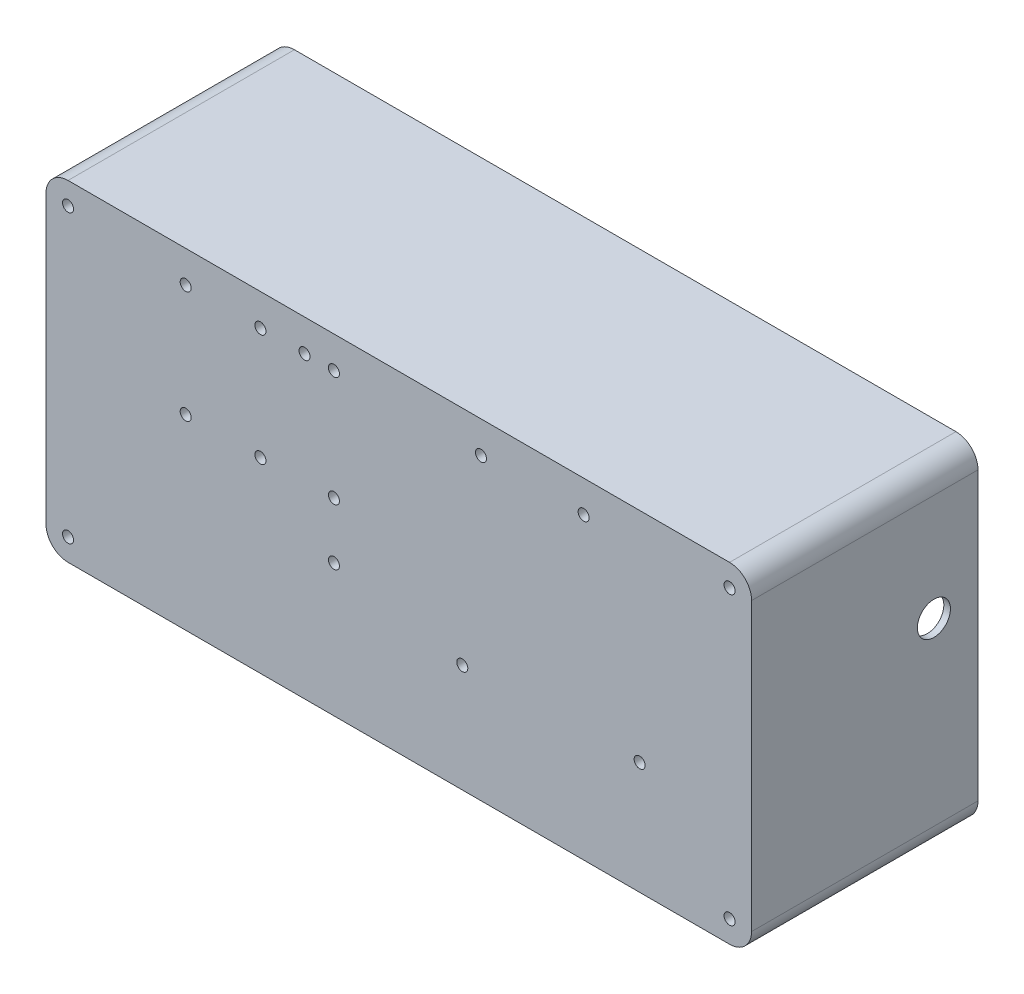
ISO-10303-21;
HEADER;
FILE_DESCRIPTION(('STEP AP214'),'2;1');
FILE_NAME('part.step','',(''),(''),'','','');
FILE_SCHEMA(('AUTOMOTIVE_DESIGN { 1 0 10303 214 1 1 1 1 }'));
ENDSEC;
DATA;
#1=APPLICATION_CONTEXT('core data for automotive mechanical design processes');
#2=APPLICATION_PROTOCOL_DEFINITION('international standard','automotive_design',2000,#1);
#3=PRODUCT_CONTEXT('',#1,'mechanical');
#4=PRODUCT('Part','Part','',(#3));
#5=PRODUCT_RELATED_PRODUCT_CATEGORY('part','',(#4));
#6=PRODUCT_DEFINITION_FORMATION('','',#4);
#7=PRODUCT_DEFINITION_CONTEXT('part definition',#1,'design');
#8=PRODUCT_DEFINITION('design','',#6,#7);
#9=PRODUCT_DEFINITION_SHAPE('','',#8);
#10=(LENGTH_UNIT() NAMED_UNIT(*) SI_UNIT(.MILLI.,.METRE.));
#11=(NAMED_UNIT(*) PLANE_ANGLE_UNIT() SI_UNIT($,.RADIAN.));
#12=(NAMED_UNIT(*) SI_UNIT($,.STERADIAN.) SOLID_ANGLE_UNIT());
#13=UNCERTAINTY_MEASURE_WITH_UNIT(LENGTH_MEASURE(1.E-05),#10,'distance_accuracy_value','');
#14=(GEOMETRIC_REPRESENTATION_CONTEXT(3) GLOBAL_UNCERTAINTY_ASSIGNED_CONTEXT((#13)) GLOBAL_UNIT_ASSIGNED_CONTEXT((#10,
#11,#12)) REPRESENTATION_CONTEXT('',''));
#15=CARTESIAN_POINT('',(0.,0.,0.));
#16=DIRECTION('',(0.,0.,1.));
#17=DIRECTION('',(1.,0.,0.));
#18=AXIS2_PLACEMENT_3D('',#15,#16,#17);
#19=CARTESIAN_POINT('',(-20.,-55.,18.4));
#20=DIRECTION('',(0.,-1.,0.));
#21=DIRECTION('',(1.,0.,0.));
#22=AXIS2_PLACEMENT_3D('',#19,#20,#21);
#23=PLANE('',#22);
#24=DIRECTION('',(1.,0.,0.));
#25=VECTOR('',#24,1.);
#26=CARTESIAN_POINT('',(-20.,-55.,20.));
#27=LINE('',#26,#25);
#28=CARTESIAN_POINT('',(-20.,-55.,20.));
#29=VERTEX_POINT('',#28);
#30=CARTESIAN_POINT('',(160.,-55.0000000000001,20.));
#31=VERTEX_POINT('',#30);
#32=EDGE_CURVE('E502',#29,#31,#27,.T.);
#33=ORIENTED_EDGE('',*,*,#32,.F.);
#34=DIRECTION('',(0.,0.,1.));
#35=VECTOR('',#34,1.);
#36=CARTESIAN_POINT('',(-20.,-55.,18.4));
#37=LINE('',#36,#35);
#38=CARTESIAN_POINT('',(-20.,-55.,-41.6));
#39=VERTEX_POINT('',#38);
#40=EDGE_CURVE('E523',#39,#29,#37,.T.);
#41=ORIENTED_EDGE('',*,*,#40,.F.);
#42=DIRECTION('',(-1.,0.,0.));
#43=VECTOR('',#42,1.);
#44=CARTESIAN_POINT('',(160.,-55.,-41.6));
#45=LINE('',#44,#43);
#46=CARTESIAN_POINT('',(160.,-55.,-41.6));
#47=VERTEX_POINT('',#46);
#48=EDGE_CURVE('E430',#47,#39,#45,.T.);
#49=ORIENTED_EDGE('',*,*,#48,.F.);
#50=DIRECTION('',(0.,0.,1.));
#51=VECTOR('',#50,1.);
#52=CARTESIAN_POINT('',(160.,-55.0000000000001,18.4));
#53=LINE('',#52,#51);
#54=EDGE_CURVE('E537',#47,#31,#53,.T.);
#55=ORIENTED_EDGE('',*,*,#54,.T.);
#56=EDGE_LOOP('',(#33,#41,#49,#55));
#57=FACE_BOUND('',#56,.T.);
#58=DIRECTION('',(0.,0.,-1.));
#59=VECTOR('',#58,1.);
#60=CARTESIAN_POINT('',(134.29,-55.0000000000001,18.4));
#61=LINE('',#60,#59);
#62=CARTESIAN_POINT('',(134.29,-55.0000000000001,12.4));
#63=VERTEX_POINT('',#62);
#64=CARTESIAN_POINT('',(134.29,-55.0000000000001,-17.6));
#65=VERTEX_POINT('',#64);
#66=EDGE_CURVE('E310',#63,#65,#61,.T.);
#67=ORIENTED_EDGE('',*,*,#66,.T.);
#68=DIRECTION('',(-1.,0.,0.));
#69=VECTOR('',#68,1.);
#70=CARTESIAN_POINT('',(-20.,-55.,-17.6));
#71=LINE('',#70,#69);
#72=CARTESIAN_POINT('',(112.29,-55.0000000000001,-17.6));
#73=VERTEX_POINT('',#72);
#74=EDGE_CURVE('E304',#65,#73,#71,.T.);
#75=ORIENTED_EDGE('',*,*,#74,.T.);
#76=DIRECTION('',(0.,0.,1.));
#77=VECTOR('',#76,1.);
#78=CARTESIAN_POINT('',(112.29,-55.0000000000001,18.4));
#79=LINE('',#78,#77);
#80=CARTESIAN_POINT('',(112.29,-55.0000000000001,12.4));
#81=VERTEX_POINT('',#80);
#82=EDGE_CURVE('E307',#73,#81,#79,.T.);
#83=ORIENTED_EDGE('',*,*,#82,.T.);
#84=DIRECTION('',(-1.,0.,0.));
#85=VECTOR('',#84,1.);
#86=CARTESIAN_POINT('',(-20.,-55.,12.4));
#87=LINE('',#86,#85);
#88=EDGE_CURVE('E300',#63,#81,#87,.T.);
#89=ORIENTED_EDGE('',*,*,#88,.F.);
#90=EDGE_LOOP('',(#67,#75,#83,#89));
#91=FACE_BOUND('',#90,.T.);
#92=DIRECTION('',(0.,0.,-1.));
#93=VECTOR('',#92,1.);
#94=CARTESIAN_POINT('',(101.27,-55.0000000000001,18.4));
#95=LINE('',#94,#93);
#96=CARTESIAN_POINT('',(101.27,-55.0000000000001,12.4));
#97=VERTEX_POINT('',#96);
#98=CARTESIAN_POINT('',(101.27,-55.0000000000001,-17.6));
#99=VERTEX_POINT('',#98);
#100=EDGE_CURVE('E288',#97,#99,#95,.T.);
#101=ORIENTED_EDGE('',*,*,#100,.T.);
#102=DIRECTION('',(-1.,0.,0.));
#103=VECTOR('',#102,1.);
#104=CARTESIAN_POINT('',(-20.,-55.,-17.6));
#105=LINE('',#104,#103);
#106=CARTESIAN_POINT('',(83.27,-55.0000000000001,-17.6));
#107=VERTEX_POINT('',#106);
#108=EDGE_CURVE('E275',#99,#107,#105,.T.);
#109=ORIENTED_EDGE('',*,*,#108,.T.);
#110=DIRECTION('',(0.,0.,1.));
#111=VECTOR('',#110,1.);
#112=CARTESIAN_POINT('',(83.27,-55.0000000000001,18.4));
#113=LINE('',#112,#111);
#114=CARTESIAN_POINT('',(83.27,-55.0000000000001,12.4));
#115=VERTEX_POINT('',#114);
#116=EDGE_CURVE('E281',#107,#115,#113,.T.);
#117=ORIENTED_EDGE('',*,*,#116,.T.);
#118=DIRECTION('',(-1.,0.,0.));
#119=VECTOR('',#118,1.);
#120=CARTESIAN_POINT('',(-20.,-55.,12.4));
#121=LINE('',#120,#119);
#122=EDGE_CURVE('E270',#97,#115,#121,.T.);
#123=ORIENTED_EDGE('',*,*,#122,.F.);
#124=EDGE_LOOP('',(#101,#109,#117,#123));
#125=FACE_BOUND('',#124,.T.);
#126=ADVANCED_FACE('F33',(#57,#91,#125),#23,.T.);
#127=CARTESIAN_POINT('',(149.2,-53.2,-41.6));
#128=DIRECTION('',(0.,1.,0.));
#129=DIRECTION('',(0.,0.,1.));
#130=AXIS2_PLACEMENT_3D('',#127,#128,#129);
#131=PLANE('',#130);
#132=DIRECTION('',(-1.,0.,0.));
#133=VECTOR('',#132,1.);
#134=CARTESIAN_POINT('',(149.2,-53.2,18.4));
#135=LINE('',#134,#133);
#136=CARTESIAN_POINT('',(149.2,-53.2,18.4));
#137=VERTEX_POINT('',#136);
#138=CARTESIAN_POINT('',(-9.2,-53.2,18.4));
#139=VERTEX_POINT('',#138);
#140=EDGE_CURVE('E382',#137,#139,#135,.T.);
#141=ORIENTED_EDGE('',*,*,#140,.F.);
#142=DIRECTION('',(0.,0.,1.));
#143=VECTOR('',#142,1.);
#144=CARTESIAN_POINT('',(149.2,-53.2,-41.6));
#145=LINE('',#144,#143);
#146=CARTESIAN_POINT('',(149.2,-53.2,-41.6));
#147=VERTEX_POINT('',#146);
#148=EDGE_CURVE('E408',#147,#137,#145,.T.);
#149=ORIENTED_EDGE('',*,*,#148,.F.);
#150=DIRECTION('',(-1.,0.,0.));
#151=VECTOR('',#150,1.);
#152=CARTESIAN_POINT('',(149.2,-53.2,-41.6));
#153=LINE('',#152,#151);
#154=CARTESIAN_POINT('',(-9.2,-53.2,-41.6));
#155=VERTEX_POINT('',#154);
#156=EDGE_CURVE('E362',#147,#155,#153,.T.);
#157=ORIENTED_EDGE('',*,*,#156,.T.);
#158=DIRECTION('',(0.,0.,1.));
#159=VECTOR('',#158,1.);
#160=CARTESIAN_POINT('',(-9.2,-53.2,-41.6));
#161=LINE('',#160,#159);
#162=EDGE_CURVE('E406',#155,#139,#161,.T.);
#163=ORIENTED_EDGE('',*,*,#162,.T.);
#164=EDGE_LOOP('',(#141,#149,#157,#163));
#165=FACE_BOUND('',#164,.T.);
#166=DIRECTION('',(0.,0.,-1.));
#167=VECTOR('',#166,1.);
#168=CARTESIAN_POINT('',(112.29,-53.2,-41.6));
#169=LINE('',#168,#167);
#170=CARTESIAN_POINT('',(112.29,-53.2,12.4));
#171=VERTEX_POINT('',#170);
#172=CARTESIAN_POINT('',(112.29,-53.2,-17.6));
#173=VERTEX_POINT('',#172);
#174=EDGE_CURVE('E880',#171,#173,#169,.T.);
#175=ORIENTED_EDGE('',*,*,#174,.T.);
#176=DIRECTION('',(1.,0.,0.));
#177=VECTOR('',#176,1.);
#178=CARTESIAN_POINT('',(149.2,-53.2,-17.6));
#179=LINE('',#178,#177);
#180=CARTESIAN_POINT('',(134.29,-53.2,-17.6));
#181=VERTEX_POINT('',#180);
#182=EDGE_CURVE('E893',#173,#181,#179,.T.);
#183=ORIENTED_EDGE('',*,*,#182,.T.);
#184=DIRECTION('',(0.,0.,1.));
#185=VECTOR('',#184,1.);
#186=CARTESIAN_POINT('',(134.29,-53.2,-41.6));
#187=LINE('',#186,#185);
#188=CARTESIAN_POINT('',(134.29,-53.2,12.4));
#189=VERTEX_POINT('',#188);
#190=EDGE_CURVE('E886',#181,#189,#187,.T.);
#191=ORIENTED_EDGE('',*,*,#190,.T.);
#192=DIRECTION('',(1.,0.,0.));
#193=VECTOR('',#192,1.);
#194=CARTESIAN_POINT('',(149.2,-53.2,12.4));
#195=LINE('',#194,#193);
#196=EDGE_CURVE('E877',#171,#189,#195,.T.);
#197=ORIENTED_EDGE('',*,*,#196,.F.);
#198=EDGE_LOOP('',(#175,#183,#191,#197));
#199=FACE_BOUND('',#198,.T.);
#200=DIRECTION('',(0.,0.,-1.));
#201=VECTOR('',#200,1.);
#202=CARTESIAN_POINT('',(83.27,-53.2,-41.6));
#203=LINE('',#202,#201);
#204=CARTESIAN_POINT('',(83.27,-53.2,12.4));
#205=VERTEX_POINT('',#204);
#206=CARTESIAN_POINT('',(83.27,-53.2,-17.6));
#207=VERTEX_POINT('',#206);
#208=EDGE_CURVE('E42',#205,#207,#203,.T.);
#209=ORIENTED_EDGE('',*,*,#208,.T.);
#210=DIRECTION('',(1.,0.,0.));
#211=VECTOR('',#210,1.);
#212=CARTESIAN_POINT('',(149.2,-53.2,-17.6));
#213=LINE('',#212,#211);
#214=CARTESIAN_POINT('',(101.27,-53.2,-17.6));
#215=VERTEX_POINT('',#214);
#216=EDGE_CURVE('E11',#207,#215,#213,.T.);
#217=ORIENTED_EDGE('',*,*,#216,.T.);
#218=DIRECTION('',(0.,0.,1.));
#219=VECTOR('',#218,1.);
#220=CARTESIAN_POINT('',(101.27,-53.2,-41.6));
#221=LINE('',#220,#219);
#222=CARTESIAN_POINT('',(101.27,-53.2,12.4));
#223=VERTEX_POINT('',#222);
#224=EDGE_CURVE('E898',#215,#223,#221,.T.);
#225=ORIENTED_EDGE('',*,*,#224,.T.);
#226=DIRECTION('',(1.,0.,0.));
#227=VECTOR('',#226,1.);
#228=CARTESIAN_POINT('',(149.2,-53.2,12.4));
#229=LINE('',#228,#227);
#230=EDGE_CURVE('E896',#205,#223,#229,.T.);
#231=ORIENTED_EDGE('',*,*,#230,.F.);
#232=EDGE_LOOP('',(#209,#217,#225,#231));
#233=FACE_BOUND('',#232,.T.);
#234=ADVANCED_FACE('F902',(#165,#199,#233),#131,.T.);
#235=CARTESIAN_POINT('',(-20.,-49.,18.4));
#236=DIRECTION('',(0.,0.,1.));
#237=DIRECTION('',(1.,0.,0.));
#238=AXIS2_PLACEMENT_3D('',#235,#236,#237);
#239=PLANE('',#238);
#240=CARTESIAN_POINT('',(32.3500000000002,-4.15,18.4));
#241=DIRECTION('',(0.,0.,1.));
#242=DIRECTION('',(1.,0.,0.));
#243=AXIS2_PLACEMENT_3D('',#240,#241,#242);
#244=CIRCLE('',#243,7.49999999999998);
#245=CARTESIAN_POINT('',(39.8500000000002,-4.15,18.4));
#246=VERTEX_POINT('',#245);
#247=EDGE_CURVE('E580',#246,#246,#244,.T.);
#248=ORIENTED_EDGE('',*,*,#247,.T.);
#249=EDGE_LOOP('',(#248));
#250=FACE_BOUND('',#249,.T.);
#251=CARTESIAN_POINT('',(12.0099999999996,-4.14999999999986,18.4));
#252=DIRECTION('',(0.,0.,1.));
#253=DIRECTION('',(1.,0.,0.));
#254=AXIS2_PLACEMENT_3D('',#251,#252,#253);
#255=CIRCLE('',#254,7.50000000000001);
#256=CARTESIAN_POINT('',(19.5099999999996,-4.14999999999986,18.4));
#257=VERTEX_POINT('',#256);
#258=EDGE_CURVE('E577',#257,#257,#255,.T.);
#259=ORIENTED_EDGE('',*,*,#258,.T.);
#260=EDGE_LOOP('',(#259));
#261=FACE_BOUND('',#260,.T.);
#262=CARTESIAN_POINT('',(52.35,-18.95,18.4));
#263=DIRECTION('',(0.,0.,1.));
#264=DIRECTION('',(1.,0.,0.));
#265=AXIS2_PLACEMENT_3D('',#262,#263,#264);
#266=CIRCLE('',#265,7.50000000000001);
#267=CARTESIAN_POINT('',(59.85,-18.95,18.4));
#268=VERTEX_POINT('',#267);
#269=EDGE_CURVE('E571',#268,#268,#266,.T.);
#270=ORIENTED_EDGE('',*,*,#269,.T.);
#271=EDGE_LOOP('',(#270));
#272=FACE_BOUND('',#271,.T.);
#273=CARTESIAN_POINT('',(52.3499999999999,-3.65,18.4));
#274=DIRECTION('',(0.,0.,1.));
#275=DIRECTION('',(1.,0.,0.));
#276=AXIS2_PLACEMENT_3D('',#273,#274,#275);
#277=CIRCLE('',#276,7.50000000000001);
#278=CARTESIAN_POINT('',(59.8499999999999,-3.65,18.4));
#279=VERTEX_POINT('',#278);
#280=EDGE_CURVE('E568',#279,#279,#277,.T.);
#281=ORIENTED_EDGE('',*,*,#280,.T.);
#282=EDGE_LOOP('',(#281));
#283=FACE_BOUND('',#282,.T.);
#284=CARTESIAN_POINT('',(135.53,-24.37,18.4));
#285=DIRECTION('',(0.,0.,1.));
#286=DIRECTION('',(1.,0.,0.));
#287=AXIS2_PLACEMENT_3D('',#284,#285,#286);
#288=CIRCLE('',#287,7.49999999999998);
#289=CARTESIAN_POINT('',(143.03,-24.37,18.4));
#290=VERTEX_POINT('',#289);
#291=EDGE_CURVE('E551',#290,#290,#288,.T.);
#292=ORIENTED_EDGE('',*,*,#291,.T.);
#293=EDGE_LOOP('',(#292));
#294=FACE_BOUND('',#293,.T.);
#295=CARTESIAN_POINT('',(87.27,-25.61,18.4));
#296=DIRECTION('',(0.,0.,1.));
#297=DIRECTION('',(1.,0.,0.));
#298=AXIS2_PLACEMENT_3D('',#295,#296,#297);
#299=CIRCLE('',#298,7.50000000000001);
#300=CARTESIAN_POINT('',(94.77,-25.61,18.4));
#301=VERTEX_POINT('',#300);
#302=EDGE_CURVE('E554',#301,#301,#299,.T.);
#303=ORIENTED_EDGE('',*,*,#302,.T.);
#304=EDGE_LOOP('',(#303));
#305=FACE_BOUND('',#304,.T.);
#306=DIRECTION('',(1.,0.,0.));
#307=VECTOR('',#306,1.);
#308=CARTESIAN_POINT('',(149.2,33.1999999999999,18.4));
#309=LINE('',#308,#307);
#310=CARTESIAN_POINT('',(-9.2,33.1999999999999,18.4));
#311=VERTEX_POINT('',#310);
#312=CARTESIAN_POINT('',(8.95590438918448,33.1999999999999,18.4));
#313=VERTEX_POINT('',#312);
#314=EDGE_CURVE('E358',#311,#313,#309,.T.);
#315=ORIENTED_EDGE('',*,*,#314,.T.);
#316=CARTESIAN_POINT('',(12.0099999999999,26.35,18.4));
#317=DIRECTION('',(0.,0.,1.));
#318=DIRECTION('',(1.,0.,0.));
#319=AXIS2_PLACEMENT_3D('',#316,#317,#318);
#320=CIRCLE('',#319,7.50000000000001);
#321=CARTESIAN_POINT('',(15.0640956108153,33.1999999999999,18.4));
#322=VERTEX_POINT('',#321);
#323=EDGE_CURVE('E574',#313,#322,#320,.T.);
#324=ORIENTED_EDGE('',*,*,#323,.T.);
#325=CARTESIAN_POINT('',(29.2959043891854,33.1999999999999,18.4));
#326=VERTEX_POINT('',#325);
#327=EDGE_CURVE('E397',#322,#326,#309,.T.);
#328=ORIENTED_EDGE('',*,*,#327,.T.);
#329=CARTESIAN_POINT('',(32.3500000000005,26.3499999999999,18.4));
#330=DIRECTION('',(0.,0.,1.));
#331=DIRECTION('',(1.,0.,0.));
#332=AXIS2_PLACEMENT_3D('',#329,#330,#331);
#333=CIRCLE('',#332,7.50000000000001);
#334=CARTESIAN_POINT('',(38.3500000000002,21.8499999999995,18.4));
#335=VERTEX_POINT('',#334);
#336=EDGE_CURVE('E559',#326,#335,#333,.T.);
#337=ORIENTED_EDGE('',*,*,#336,.T.);
#338=CARTESIAN_POINT('',(44.3499999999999,26.35,18.4));
#339=DIRECTION('',(0.,0.,1.));
#340=DIRECTION('',(1.,0.,0.));
#341=AXIS2_PLACEMENT_3D('',#338,#339,#340);
#342=CIRCLE('',#341,7.50000000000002);
#343=CARTESIAN_POINT('',(50.3031249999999,21.7881689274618,18.4));
#344=VERTEX_POINT('',#343);
#345=EDGE_CURVE('E557',#335,#344,#342,.T.);
#346=ORIENTED_EDGE('',*,*,#345,.T.);
#347=CARTESIAN_POINT('',(52.3499999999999,26.35,18.4));
#348=DIRECTION('',(0.,0.,-1.));
#349=DIRECTION('',(-1.,0.,0.));
#350=AXIS2_PLACEMENT_3D('',#347,#348,#349);
#351=CIRCLE('',#350,4.99999999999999);
#352=CARTESIAN_POINT('',(50.3031249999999,30.9118310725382,18.4));
#353=VERTEX_POINT('',#352);
#354=EDGE_CURVE('E339',#353,#344,#351,.T.);
#355=ORIENTED_EDGE('',*,*,#354,.F.);
#356=CARTESIAN_POINT('',(44.3499999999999,26.35,18.4));
#357=DIRECTION('',(0.,0.,1.));
#358=DIRECTION('',(1.,0.,0.));
#359=AXIS2_PLACEMENT_3D('',#356,#357,#358);
#360=CIRCLE('',#359,7.50000000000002);
#361=CARTESIAN_POINT('',(47.4040956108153,33.1999999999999,18.4));
#362=VERTEX_POINT('',#361);
#363=EDGE_CURVE('E566',#353,#362,#360,.T.);
#364=ORIENTED_EDGE('',*,*,#363,.T.);
#365=CARTESIAN_POINT('',(89.2959043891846,33.1999999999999,18.4));
#366=VERTEX_POINT('',#365);
#367=EDGE_CURVE('E1918',#362,#366,#309,.T.);
#368=ORIENTED_EDGE('',*,*,#367,.T.);
#369=CARTESIAN_POINT('',(92.35,26.35,18.4));
#370=DIRECTION('',(0.,0.,1.));
#371=DIRECTION('',(1.,0.,0.));
#372=AXIS2_PLACEMENT_3D('',#369,#370,#371);
#373=CIRCLE('',#372,7.50000000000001);
#374=CARTESIAN_POINT('',(95.4040956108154,33.1999999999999,18.4));
#375=VERTEX_POINT('',#374);
#376=EDGE_CURVE('E548',#366,#375,#373,.T.);
#377=ORIENTED_EDGE('',*,*,#376,.T.);
#378=CARTESIAN_POINT('',(117.235904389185,33.1999999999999,18.4));
#379=VERTEX_POINT('',#378);
#380=EDGE_CURVE('E941',#375,#379,#309,.T.);
#381=ORIENTED_EDGE('',*,*,#380,.T.);
#382=CARTESIAN_POINT('',(120.29,26.35,18.4));
#383=DIRECTION('',(0.,0.,1.));
#384=DIRECTION('',(1.,0.,0.));
#385=AXIS2_PLACEMENT_3D('',#382,#383,#384);
#386=CIRCLE('',#385,7.50000000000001);
#387=CARTESIAN_POINT('',(123.344095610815,33.1999999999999,18.4));
#388=VERTEX_POINT('',#387);
#389=EDGE_CURVE('E545',#379,#388,#386,.T.);
#390=ORIENTED_EDGE('',*,*,#389,.T.);
#391=CARTESIAN_POINT('',(149.2,33.1999999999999,18.4));
#392=VERTEX_POINT('',#391);
#393=EDGE_CURVE('E394',#388,#392,#309,.T.);
#394=ORIENTED_EDGE('',*,*,#393,.T.);
#395=DIRECTION('',(0.707106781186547,-0.707106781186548,0.));
#396=VECTOR('',#395,1.);
#397=CARTESIAN_POINT('',(164.2,18.1999999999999,18.4));
#398=LINE('',#397,#396);
#399=CARTESIAN_POINT('',(164.2,18.1999999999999,18.4));
#400=VERTEX_POINT('',#399);
#401=EDGE_CURVE('E354',#392,#400,#398,.T.);
#402=ORIENTED_EDGE('',*,*,#401,.T.);
#403=DIRECTION('',(0.,-1.,0.));
#404=VECTOR('',#403,1.);
#405=CARTESIAN_POINT('',(164.2,-38.2,18.4));
#406=LINE('',#405,#404);
#407=CARTESIAN_POINT('',(164.2,-38.2,18.4));
#408=VERTEX_POINT('',#407);
#409=EDGE_CURVE('E376',#400,#408,#406,.T.);
#410=ORIENTED_EDGE('',*,*,#409,.T.);
#411=DIRECTION('',(-0.707106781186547,-0.707106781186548,0.));
#412=VECTOR('',#411,1.);
#413=CARTESIAN_POINT('',(164.2,-38.2,18.4));
#414=LINE('',#413,#412);
#415=EDGE_CURVE('E379',#408,#137,#414,.T.);
#416=ORIENTED_EDGE('',*,*,#415,.T.);
#417=ORIENTED_EDGE('',*,*,#140,.T.);
#418=DIRECTION('',(-0.707106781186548,0.707106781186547,0.));
#419=VECTOR('',#418,1.);
#420=CARTESIAN_POINT('',(-9.2,-53.2,18.4));
#421=LINE('',#420,#419);
#422=CARTESIAN_POINT('',(-24.2,-38.2,18.4));
#423=VERTEX_POINT('',#422);
#424=EDGE_CURVE('E385',#139,#423,#421,.T.);
#425=ORIENTED_EDGE('',*,*,#424,.T.);
#426=DIRECTION('',(0.,1.,0.));
#427=VECTOR('',#426,1.);
#428=CARTESIAN_POINT('',(-24.2,-38.2,18.4));
#429=LINE('',#428,#427);
#430=CARTESIAN_POINT('',(-24.2,18.1999999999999,18.4));
#431=VERTEX_POINT('',#430);
#432=EDGE_CURVE('E388',#423,#431,#429,.T.);
#433=ORIENTED_EDGE('',*,*,#432,.T.);
#434=DIRECTION('',(0.707106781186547,0.707106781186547,0.));
#435=VECTOR('',#434,1.);
#436=CARTESIAN_POINT('',(-9.2,33.1999999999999,18.4));
#437=LINE('',#436,#435);
#438=EDGE_CURVE('E391',#431,#311,#437,.T.);
#439=ORIENTED_EDGE('',*,*,#438,.T.);
#440=EDGE_LOOP('',(#315,#324,#328,#337,#346,#355,#364,#368,#377,#381,#390,#394,#402,#410,#416,
#417,#425,#433,#439));
#441=FACE_BOUND('',#440,.T.);
#442=ADVANCED_FACE('F936',(#250,#261,#272,#283,#294,#305,#441),#239,.F.);
#443=CARTESIAN_POINT('',(44.3499999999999,26.35,18.4));
#444=DIRECTION('',(0.,0.,1.));
#445=DIRECTION('',(1.,0.,0.));
#446=AXIS2_PLACEMENT_3D('',#443,#444,#445);
#447=CIRCLE('',#446,7.50000000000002);
#448=CARTESIAN_POINT('',(41.2959043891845,33.1999999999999,18.4));
#449=VERTEX_POINT('',#448);
#450=CARTESIAN_POINT('',(38.3500000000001,30.8500000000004,18.4));
#451=VERTEX_POINT('',#450);
#452=EDGE_CURVE('E561',#449,#451,#447,.T.);
#453=ORIENTED_EDGE('',*,*,#452,.T.);
#454=CARTESIAN_POINT('',(32.3500000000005,26.3499999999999,18.4));
#455=DIRECTION('',(0.,0.,1.));
#456=DIRECTION('',(1.,0.,0.));
#457=AXIS2_PLACEMENT_3D('',#454,#455,#456);
#458=CIRCLE('',#457,7.50000000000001);
#459=CARTESIAN_POINT('',(35.4040956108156,33.1999999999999,18.4));
#460=VERTEX_POINT('',#459);
#461=EDGE_CURVE('E563',#451,#460,#458,.T.);
#462=ORIENTED_EDGE('',*,*,#461,.T.);
#463=EDGE_CURVE('E1920',#460,#449,#309,.T.);
#464=ORIENTED_EDGE('',*,*,#463,.T.);
#465=EDGE_LOOP('',(#453,#462,#464));
#466=FACE_BOUND('',#465,.T.);
#467=ADVANCED_FACE('F1037',(#466),#239,.F.);
#468=CARTESIAN_POINT('',(-20.,-49.,18.4));
#469=DIRECTION('',(0.,0.,1.));
#470=DIRECTION('',(1.,0.,0.));
#471=AXIS2_PLACEMENT_3D('',#468,#469,#470);
#472=CYLINDRICAL_SURFACE('',#471,6.);
#473=CARTESIAN_POINT('',(-20.,-49.,20.));
#474=DIRECTION('',(0.,0.,1.));
#475=DIRECTION('',(1.,0.,0.));
#476=AXIS2_PLACEMENT_3D('',#473,#474,#475);
#477=CIRCLE('',#476,6.);
#478=CARTESIAN_POINT('',(-26.,-49.,20.));
#479=VERTEX_POINT('',#478);
#480=EDGE_CURVE('E499',#479,#29,#477,.T.);
#481=ORIENTED_EDGE('',*,*,#480,.F.);
#482=DIRECTION('',(0.,0.,1.));
#483=VECTOR('',#482,1.);
#484=CARTESIAN_POINT('',(-26.,-49.,18.4));
#485=LINE('',#484,#483);
#486=CARTESIAN_POINT('',(-26.,-49.,-41.6));
#487=VERTEX_POINT('',#486);
#488=EDGE_CURVE('E524',#487,#479,#485,.T.);
#489=ORIENTED_EDGE('',*,*,#488,.F.);
#490=CARTESIAN_POINT('',(-20.,-49.,-41.6));
#491=DIRECTION('',(0.,0.,-1.));
#492=DIRECTION('',(-1.,0.,0.));
#493=AXIS2_PLACEMENT_3D('',#490,#491,#492);
#494=CIRCLE('',#493,6.);
#495=EDGE_CURVE('E433',#39,#487,#494,.T.);
#496=ORIENTED_EDGE('',*,*,#495,.F.);
#497=ORIENTED_EDGE('',*,*,#40,.T.);
#498=EDGE_LOOP('',(#481,#489,#496,#497));
#499=FACE_BOUND('',#498,.T.);
#500=ADVANCED_FACE('F817',(#499),#472,.T.);
#501=CARTESIAN_POINT('',(-26.,-49.,18.4));
#502=DIRECTION('',(-1.,0.,0.));
#503=DIRECTION('',(0.,0.,1.));
#504=AXIS2_PLACEMENT_3D('',#501,#502,#503);
#505=PLANE('',#504);
#506=DIRECTION('',(0.,-1.,0.));
#507=VECTOR('',#506,1.);
#508=CARTESIAN_POINT('',(-26.,-49.,20.));
#509=LINE('',#508,#507);
#510=CARTESIAN_POINT('',(-26.,29.,20.));
#511=VERTEX_POINT('',#510);
#512=EDGE_CURVE('E520',#511,#479,#509,.T.);
#513=ORIENTED_EDGE('',*,*,#512,.F.);
#514=DIRECTION('',(0.,0.,1.));
#515=VECTOR('',#514,1.);
#516=CARTESIAN_POINT('',(-26.,29.,18.4));
#517=LINE('',#516,#515);
#518=CARTESIAN_POINT('',(-26.,29.,-41.6));
#519=VERTEX_POINT('',#518);
#520=EDGE_CURVE('E527',#519,#511,#517,.T.);
#521=ORIENTED_EDGE('',*,*,#520,.F.);
#522=DIRECTION('',(0.,1.,0.));
#523=VECTOR('',#522,1.);
#524=CARTESIAN_POINT('',(-26.,-49.,-41.6));
#525=LINE('',#524,#523);
#526=EDGE_CURVE('E436',#487,#519,#525,.T.);
#527=ORIENTED_EDGE('',*,*,#526,.F.);
#528=ORIENTED_EDGE('',*,*,#488,.T.);
#529=EDGE_LOOP('',(#513,#521,#527,#528));
#530=FACE_BOUND('',#529,.T.);
#531=ADVANCED_FACE('F1028',(#530),#505,.T.);
#532=CARTESIAN_POINT('',(-20.,29.,18.4));
#533=DIRECTION('',(0.,0.,1.));
#534=DIRECTION('',(1.,0.,0.));
#535=AXIS2_PLACEMENT_3D('',#532,#533,#534);
#536=CYLINDRICAL_SURFACE('',#535,6.);
#537=CARTESIAN_POINT('',(-20.,29.,20.));
#538=DIRECTION('',(0.,0.,1.));
#539=DIRECTION('',(1.,0.,0.));
#540=AXIS2_PLACEMENT_3D('',#537,#538,#539);
#541=CIRCLE('',#540,6.);
#542=CARTESIAN_POINT('',(-20.,35.,20.));
#543=VERTEX_POINT('',#542);
#544=EDGE_CURVE('E517',#543,#511,#541,.T.);
#545=ORIENTED_EDGE('',*,*,#544,.F.);
#546=DIRECTION('',(0.,0.,1.));
#547=VECTOR('',#546,1.);
#548=CARTESIAN_POINT('',(-20.,35.,18.4));
#549=LINE('',#548,#547);
#550=CARTESIAN_POINT('',(-20.,35.,-41.6));
#551=VERTEX_POINT('',#550);
#552=EDGE_CURVE('E529',#551,#543,#549,.T.);
#553=ORIENTED_EDGE('',*,*,#552,.F.);
#554=CARTESIAN_POINT('',(-20.,29.,-41.6));
#555=DIRECTION('',(0.,0.,-1.));
#556=DIRECTION('',(-1.,0.,0.));
#557=AXIS2_PLACEMENT_3D('',#554,#555,#556);
#558=CIRCLE('',#557,6.);
#559=EDGE_CURVE('E439',#519,#551,#558,.T.);
#560=ORIENTED_EDGE('',*,*,#559,.F.);
#561=ORIENTED_EDGE('',*,*,#520,.T.);
#562=EDGE_LOOP('',(#545,#553,#560,#561));
#563=FACE_BOUND('',#562,.T.);
#564=ADVANCED_FACE('F1024',(#563),#536,.T.);
#565=CARTESIAN_POINT('',(-20.,35.,18.4));
#566=DIRECTION('',(0.,1.,0.));
#567=DIRECTION('',(-1.,0.,0.));
#568=AXIS2_PLACEMENT_3D('',#565,#566,#567);
#569=PLANE('',#568);
#570=DIRECTION('',(-1.,0.,0.));
#571=VECTOR('',#570,1.);
#572=CARTESIAN_POINT('',(-20.,35.,20.));
#573=LINE('',#572,#571);
#574=CARTESIAN_POINT('',(160.,34.9999999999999,20.));
#575=VERTEX_POINT('',#574);
#576=EDGE_CURVE('E514',#575,#543,#573,.T.);
#577=ORIENTED_EDGE('',*,*,#576,.F.);
#578=DIRECTION('',(0.,0.,1.));
#579=VECTOR('',#578,1.);
#580=CARTESIAN_POINT('',(160.,34.9999999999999,18.4));
#581=LINE('',#580,#579);
#582=CARTESIAN_POINT('',(160.,35.,-41.6));
#583=VERTEX_POINT('',#582);
#584=EDGE_CURVE('E531',#583,#575,#581,.T.);
#585=ORIENTED_EDGE('',*,*,#584,.F.);
#586=DIRECTION('',(1.,0.,0.));
#587=VECTOR('',#586,1.);
#588=CARTESIAN_POINT('',(160.,35.,-41.6));
#589=LINE('',#588,#587);
#590=EDGE_CURVE('E442',#551,#583,#589,.T.);
#591=ORIENTED_EDGE('',*,*,#590,.F.);
#592=ORIENTED_EDGE('',*,*,#552,.T.);
#593=EDGE_LOOP('',(#577,#585,#591,#592));
#594=FACE_BOUND('',#593,.T.);
#595=ADVANCED_FACE('F1020',(#594),#569,.T.);
#596=CARTESIAN_POINT('',(160.,28.9999999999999,18.4));
#597=DIRECTION('',(0.,0.,1.));
#598=DIRECTION('',(1.,0.,0.));
#599=AXIS2_PLACEMENT_3D('',#596,#597,#598);
#600=CYLINDRICAL_SURFACE('',#599,5.99999999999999);
#601=CARTESIAN_POINT('',(160.,28.9999999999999,20.));
#602=DIRECTION('',(0.,0.,1.));
#603=DIRECTION('',(1.,0.,0.));
#604=AXIS2_PLACEMENT_3D('',#601,#602,#603);
#605=CIRCLE('',#604,5.99999999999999);
#606=CARTESIAN_POINT('',(166.,28.9999999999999,20.));
#607=VERTEX_POINT('',#606);
#608=EDGE_CURVE('E511',#607,#575,#605,.T.);
#609=ORIENTED_EDGE('',*,*,#608,.F.);
#610=DIRECTION('',(0.,0.,1.));
#611=VECTOR('',#610,1.);
#612=CARTESIAN_POINT('',(166.,28.9999999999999,18.4));
#613=LINE('',#612,#611);
#614=CARTESIAN_POINT('',(166.,29.,-41.6));
#615=VERTEX_POINT('',#614);
#616=EDGE_CURVE('E533',#615,#607,#613,.T.);
#617=ORIENTED_EDGE('',*,*,#616,.F.);
#618=CARTESIAN_POINT('',(160.,29.,-41.6));
#619=DIRECTION('',(0.,0.,-1.));
#620=DIRECTION('',(-1.,0.,0.));
#621=AXIS2_PLACEMENT_3D('',#618,#619,#620);
#622=CIRCLE('',#621,6.);
#623=EDGE_CURVE('E445',#583,#615,#622,.T.);
#624=ORIENTED_EDGE('',*,*,#623,.F.);
#625=ORIENTED_EDGE('',*,*,#584,.T.);
#626=EDGE_LOOP('',(#609,#617,#624,#625));
#627=FACE_BOUND('',#626,.T.);
#628=ADVANCED_FACE('F1016',(#627),#600,.T.);
#629=CARTESIAN_POINT('',(166.,-49.0000000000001,18.4));
#630=DIRECTION('',(1.,0.,0.));
#631=DIRECTION('',(0.,0.,-1.));
#632=AXIS2_PLACEMENT_3D('',#629,#630,#631);
#633=PLANE('',#632);
#634=CARTESIAN_POINT('',(166.,0.,-29.6));
#635=DIRECTION('',(1.,0.,0.));
#636=DIRECTION('',(0.,0.,-1.));
#637=AXIS2_PLACEMENT_3D('',#634,#635,#636);
#638=CIRCLE('',#637,4.5);
#639=CARTESIAN_POINT('',(166.,0.,-34.1));
#640=VERTEX_POINT('',#639);
#641=EDGE_CURVE('E912',#640,#640,#638,.T.);
#642=ORIENTED_EDGE('',*,*,#641,.F.);
#643=EDGE_LOOP('',(#642));
#644=FACE_BOUND('',#643,.T.);
#645=DIRECTION('',(0.,1.,0.));
#646=VECTOR('',#645,1.);
#647=CARTESIAN_POINT('',(166.,-49.0000000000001,20.));
#648=LINE('',#647,#646);
#649=CARTESIAN_POINT('',(166.,-49.0000000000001,20.));
#650=VERTEX_POINT('',#649);
#651=EDGE_CURVE('E508',#650,#607,#648,.T.);
#652=ORIENTED_EDGE('',*,*,#651,.F.);
#653=DIRECTION('',(0.,0.,1.));
#654=VECTOR('',#653,1.);
#655=CARTESIAN_POINT('',(166.,-49.0000000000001,18.4));
#656=LINE('',#655,#654);
#657=CARTESIAN_POINT('',(166.,-49.,-41.6));
#658=VERTEX_POINT('',#657);
#659=EDGE_CURVE('E535',#658,#650,#656,.T.);
#660=ORIENTED_EDGE('',*,*,#659,.F.);
#661=DIRECTION('',(0.,-1.,0.));
#662=VECTOR('',#661,1.);
#663=CARTESIAN_POINT('',(166.,-49.,-41.6));
#664=LINE('',#663,#662);
#665=EDGE_CURVE('E448',#615,#658,#664,.T.);
#666=ORIENTED_EDGE('',*,*,#665,.F.);
#667=ORIENTED_EDGE('',*,*,#616,.T.);
#668=EDGE_LOOP('',(#652,#660,#666,#667));
#669=FACE_BOUND('',#668,.T.);
#670=ADVANCED_FACE('F1012',(#644,#669),#633,.T.);
#671=CARTESIAN_POINT('',(160.,-49.0000000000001,18.4));
#672=DIRECTION('',(0.,0.,1.));
#673=DIRECTION('',(1.,0.,0.));
#674=AXIS2_PLACEMENT_3D('',#671,#672,#673);
#675=CYLINDRICAL_SURFACE('',#674,5.99999999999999);
#676=CARTESIAN_POINT('',(160.,-49.0000000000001,20.));
#677=DIRECTION('',(0.,0.,1.));
#678=DIRECTION('',(1.,0.,0.));
#679=AXIS2_PLACEMENT_3D('',#676,#677,#678);
#680=CIRCLE('',#679,5.99999999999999);
#681=EDGE_CURVE('E505',#31,#650,#680,.T.);
#682=ORIENTED_EDGE('',*,*,#681,.F.);
#683=ORIENTED_EDGE('',*,*,#54,.F.);
#684=CARTESIAN_POINT('',(160.,-49.,-41.6));
#685=DIRECTION('',(0.,0.,-1.));
#686=DIRECTION('',(-1.,0.,0.));
#687=AXIS2_PLACEMENT_3D('',#684,#685,#686);
#688=CIRCLE('',#687,6.);
#689=EDGE_CURVE('E427',#658,#47,#688,.T.);
#690=ORIENTED_EDGE('',*,*,#689,.F.);
#691=ORIENTED_EDGE('',*,*,#659,.T.);
#692=EDGE_LOOP('',(#682,#683,#690,#691));
#693=FACE_BOUND('',#692,.T.);
#694=ADVANCED_FACE('F1008',(#693),#675,.T.);
#695=CARTESIAN_POINT('',(-20.,-49.,20.));
#696=DIRECTION('',(0.,0.,1.));
#697=DIRECTION('',(1.,0.,0.));
#698=AXIS2_PLACEMENT_3D('',#695,#696,#697);
#699=PLANE('',#698);
#700=CARTESIAN_POINT('',(-19.9999999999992,-49.,20.));
#701=DIRECTION('',(0.,0.,1.));
#702=DIRECTION('',(1.,0.,0.));
#703=AXIS2_PLACEMENT_3D('',#700,#701,#702);
#704=CIRCLE('',#703,1.5);
#705=CARTESIAN_POINT('',(-18.4999999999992,-49.,20.));
#706=VERTEX_POINT('',#705);
#707=EDGE_CURVE('E451',#706,#706,#704,.T.);
#708=ORIENTED_EDGE('',*,*,#707,.F.);
#709=EDGE_LOOP('',(#708));
#710=FACE_BOUND('',#709,.T.);
#711=CARTESIAN_POINT('',(160.,-49.0000000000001,20.));
#712=DIRECTION('',(0.,0.,1.));
#713=DIRECTION('',(1.,0.,0.));
#714=AXIS2_PLACEMENT_3D('',#711,#712,#713);
#715=CIRCLE('',#714,1.5);
#716=CARTESIAN_POINT('',(161.5,-49.0000000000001,20.));
#717=VERTEX_POINT('',#716);
#718=EDGE_CURVE('E454',#717,#717,#715,.T.);
#719=ORIENTED_EDGE('',*,*,#718,.F.);
#720=EDGE_LOOP('',(#719));
#721=FACE_BOUND('',#720,.T.);
#722=CARTESIAN_POINT('',(159.999999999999,29.,20.));
#723=DIRECTION('',(0.,0.,1.));
#724=DIRECTION('',(1.,0.,0.));
#725=AXIS2_PLACEMENT_3D('',#722,#723,#724);
#726=CIRCLE('',#725,1.5);
#727=CARTESIAN_POINT('',(161.499999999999,29.,20.));
#728=VERTEX_POINT('',#727);
#729=EDGE_CURVE('E457',#728,#728,#726,.T.);
#730=ORIENTED_EDGE('',*,*,#729,.F.);
#731=EDGE_LOOP('',(#730));
#732=FACE_BOUND('',#731,.T.);
#733=CARTESIAN_POINT('',(12.0100000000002,-4.15,20.));
#734=DIRECTION('',(0.,0.,1.));
#735=DIRECTION('',(1.,0.,0.));
#736=AXIS2_PLACEMENT_3D('',#733,#734,#735);
#737=CIRCLE('',#736,1.5);
#738=CARTESIAN_POINT('',(13.5100000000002,-4.15,20.));
#739=VERTEX_POINT('',#738);
#740=EDGE_CURVE('E460',#739,#739,#737,.T.);
#741=ORIENTED_EDGE('',*,*,#740,.F.);
#742=EDGE_LOOP('',(#741));
#743=FACE_BOUND('',#742,.T.);
#744=CARTESIAN_POINT('',(32.3500000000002,-4.15,20.));
#745=DIRECTION('',(0.,0.,1.));
#746=DIRECTION('',(1.,0.,0.));
#747=AXIS2_PLACEMENT_3D('',#744,#745,#746);
#748=CIRCLE('',#747,1.5);
#749=CARTESIAN_POINT('',(33.8500000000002,-4.15,20.));
#750=VERTEX_POINT('',#749);
#751=EDGE_CURVE('E463',#750,#750,#748,.T.);
#752=ORIENTED_EDGE('',*,*,#751,.F.);
#753=EDGE_LOOP('',(#752));
#754=FACE_BOUND('',#753,.T.);
#755=CARTESIAN_POINT('',(-20.,29.,20.));
#756=DIRECTION('',(0.,0.,1.));
#757=DIRECTION('',(1.,0.,0.));
#758=AXIS2_PLACEMENT_3D('',#755,#756,#757);
#759=CIRCLE('',#758,1.5);
#760=CARTESIAN_POINT('',(-18.5,29.,20.));
#761=VERTEX_POINT('',#760);
#762=EDGE_CURVE('E466',#761,#761,#759,.T.);
#763=ORIENTED_EDGE('',*,*,#762,.F.);
#764=EDGE_LOOP('',(#763));
#765=FACE_BOUND('',#764,.T.);
#766=CARTESIAN_POINT('',(87.2699999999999,-25.6100000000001,20.));
#767=DIRECTION('',(0.,0.,1.));
#768=DIRECTION('',(1.,0.,0.));
#769=AXIS2_PLACEMENT_3D('',#766,#767,#768);
#770=CIRCLE('',#769,1.5);
#771=CARTESIAN_POINT('',(88.7699999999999,-25.6100000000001,20.));
#772=VERTEX_POINT('',#771);
#773=EDGE_CURVE('E469',#772,#772,#770,.T.);
#774=ORIENTED_EDGE('',*,*,#773,.F.);
#775=EDGE_LOOP('',(#774));
#776=FACE_BOUND('',#775,.T.);
#777=CARTESIAN_POINT('',(135.53,-24.3700000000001,20.));
#778=DIRECTION('',(0.,0.,1.));
#779=DIRECTION('',(1.,0.,0.));
#780=AXIS2_PLACEMENT_3D('',#777,#778,#779);
#781=CIRCLE('',#780,1.5);
#782=CARTESIAN_POINT('',(137.03,-24.3700000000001,20.));
#783=VERTEX_POINT('',#782);
#784=EDGE_CURVE('E472',#783,#783,#781,.T.);
#785=ORIENTED_EDGE('',*,*,#784,.F.);
#786=EDGE_LOOP('',(#785));
#787=FACE_BOUND('',#786,.T.);
#788=CARTESIAN_POINT('',(120.29,26.3499999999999,20.));
#789=DIRECTION('',(0.,0.,1.));
#790=DIRECTION('',(1.,0.,0.));
#791=AXIS2_PLACEMENT_3D('',#788,#789,#790);
#792=CIRCLE('',#791,1.5);
#793=CARTESIAN_POINT('',(121.79,26.3499999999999,20.));
#794=VERTEX_POINT('',#793);
#795=EDGE_CURVE('E475',#794,#794,#792,.T.);
#796=ORIENTED_EDGE('',*,*,#795,.F.);
#797=EDGE_LOOP('',(#796));
#798=FACE_BOUND('',#797,.T.);
#799=CARTESIAN_POINT('',(92.3499999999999,26.3499999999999,20.));
#800=DIRECTION('',(0.,0.,1.));
#801=DIRECTION('',(1.,0.,0.));
#802=AXIS2_PLACEMENT_3D('',#799,#800,#801);
#803=CIRCLE('',#802,1.5);
#804=CARTESIAN_POINT('',(93.8499999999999,26.3499999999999,20.));
#805=VERTEX_POINT('',#804);
#806=EDGE_CURVE('E478',#805,#805,#803,.T.);
#807=ORIENTED_EDGE('',*,*,#806,.F.);
#808=EDGE_LOOP('',(#807));
#809=FACE_BOUND('',#808,.T.);
#810=CARTESIAN_POINT('',(32.3499999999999,26.35,20.));
#811=DIRECTION('',(0.,0.,1.));
#812=DIRECTION('',(1.,0.,0.));
#813=AXIS2_PLACEMENT_3D('',#810,#811,#812);
#814=CIRCLE('',#813,1.5);
#815=CARTESIAN_POINT('',(33.8499999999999,26.35,20.));
#816=VERTEX_POINT('',#815);
#817=EDGE_CURVE('E481',#816,#816,#814,.T.);
#818=ORIENTED_EDGE('',*,*,#817,.F.);
#819=EDGE_LOOP('',(#818));
#820=FACE_BOUND('',#819,.T.);
#821=CARTESIAN_POINT('',(12.0099999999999,26.35,20.));
#822=DIRECTION('',(0.,0.,1.));
#823=DIRECTION('',(1.,0.,0.));
#824=AXIS2_PLACEMENT_3D('',#821,#822,#823);
#825=CIRCLE('',#824,1.5);
#826=CARTESIAN_POINT('',(13.5099999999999,26.35,20.));
#827=VERTEX_POINT('',#826);
#828=EDGE_CURVE('E484',#827,#827,#825,.T.);
#829=ORIENTED_EDGE('',*,*,#828,.F.);
#830=EDGE_LOOP('',(#829));
#831=FACE_BOUND('',#830,.T.);
#832=CARTESIAN_POINT('',(52.35,-18.95,20.));
#833=DIRECTION('',(0.,0.,1.));
#834=DIRECTION('',(1.,0.,0.));
#835=AXIS2_PLACEMENT_3D('',#832,#833,#834);
#836=CIRCLE('',#835,1.5);
#837=CARTESIAN_POINT('',(53.85,-18.95,20.));
#838=VERTEX_POINT('',#837);
#839=EDGE_CURVE('E487',#838,#838,#836,.T.);
#840=ORIENTED_EDGE('',*,*,#839,.F.);
#841=EDGE_LOOP('',(#840));
#842=FACE_BOUND('',#841,.T.);
#843=CARTESIAN_POINT('',(52.3499999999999,-3.65,20.));
#844=DIRECTION('',(0.,0.,1.));
#845=DIRECTION('',(1.,0.,0.));
#846=AXIS2_PLACEMENT_3D('',#843,#844,#845);
#847=CIRCLE('',#846,1.5);
#848=CARTESIAN_POINT('',(53.8499999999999,-3.65,20.));
#849=VERTEX_POINT('',#848);
#850=EDGE_CURVE('E490',#849,#849,#847,.T.);
#851=ORIENTED_EDGE('',*,*,#850,.F.);
#852=EDGE_LOOP('',(#851));
#853=FACE_BOUND('',#852,.T.);
#854=CARTESIAN_POINT('',(52.3499999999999,26.35,20.));
#855=DIRECTION('',(0.,0.,1.));
#856=DIRECTION('',(1.,0.,0.));
#857=AXIS2_PLACEMENT_3D('',#854,#855,#856);
#858=CIRCLE('',#857,1.5);
#859=CARTESIAN_POINT('',(53.8499999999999,26.35,20.));
#860=VERTEX_POINT('',#859);
#861=EDGE_CURVE('E493',#860,#860,#858,.T.);
#862=ORIENTED_EDGE('',*,*,#861,.F.);
#863=EDGE_LOOP('',(#862));
#864=FACE_BOUND('',#863,.T.);
#865=CARTESIAN_POINT('',(44.3499999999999,26.35,20.));
#866=DIRECTION('',(0.,0.,1.));
#867=DIRECTION('',(1.,0.,0.));
#868=AXIS2_PLACEMENT_3D('',#865,#866,#867);
#869=CIRCLE('',#868,1.5);
#870=CARTESIAN_POINT('',(45.8499999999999,26.35,20.));
#871=VERTEX_POINT('',#870);
#872=EDGE_CURVE('E496',#871,#871,#869,.T.);
#873=ORIENTED_EDGE('',*,*,#872,.F.);
#874=EDGE_LOOP('',(#873));
#875=FACE_BOUND('',#874,.T.);
#876=ORIENTED_EDGE('',*,*,#480,.T.);
#877=ORIENTED_EDGE('',*,*,#32,.T.);
#878=ORIENTED_EDGE('',*,*,#681,.T.);
#879=ORIENTED_EDGE('',*,*,#651,.T.);
#880=ORIENTED_EDGE('',*,*,#608,.T.);
#881=ORIENTED_EDGE('',*,*,#576,.T.);
#882=ORIENTED_EDGE('',*,*,#544,.T.);
#883=ORIENTED_EDGE('',*,*,#512,.T.);
#884=EDGE_LOOP('',(#876,#877,#878,#879,#880,#881,#882,#883));
#885=FACE_BOUND('',#884,.T.);
#886=ADVANCED_FACE('F1011',(#710,#721,#732,#743,#754,#765,#776,#787,#798,#809,#820,#831,#842,
#853,#864,#875,#885),#699,.T.);
#887=CARTESIAN_POINT('',(44.3499999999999,26.35,18.4));
#888=DIRECTION('',(0.,0.,1.));
#889=DIRECTION('',(1.,0.,0.));
#890=AXIS2_PLACEMENT_3D('',#887,#888,#889);
#891=CYLINDRICAL_SURFACE('',#890,1.5);
#892=ORIENTED_EDGE('',*,*,#872,.T.);
#893=EDGE_LOOP('',(#892));
#894=FACE_BOUND('',#893,.T.);
#895=CARTESIAN_POINT('',(44.3499999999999,26.35,8.4));
#896=DIRECTION('',(0.,0.,-1.));
#897=DIRECTION('',(-1.,0.,0.));
#898=AXIS2_PLACEMENT_3D('',#895,#896,#897);
#899=CIRCLE('',#898,1.5);
#900=CARTESIAN_POINT('',(42.8499999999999,26.35,8.4));
#901=VERTEX_POINT('',#900);
#902=EDGE_CURVE('E336',#901,#901,#899,.T.);
#903=ORIENTED_EDGE('',*,*,#902,.T.);
#904=EDGE_LOOP('',(#903));
#905=FACE_BOUND('',#904,.T.);
#906=ADVANCED_FACE('F1035',(#894,#905),#891,.F.);
#907=CARTESIAN_POINT('',(52.3499999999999,26.35,18.4));
#908=DIRECTION('',(0.,0.,1.));
#909=DIRECTION('',(1.,0.,0.));
#910=AXIS2_PLACEMENT_3D('',#907,#908,#909);
#911=CYLINDRICAL_SURFACE('',#910,1.5);
#912=ORIENTED_EDGE('',*,*,#861,.T.);
#913=EDGE_LOOP('',(#912));
#914=FACE_BOUND('',#913,.T.);
#915=CARTESIAN_POINT('',(52.3499999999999,26.35,8.4));
#916=DIRECTION('',(0.,0.,-1.));
#917=DIRECTION('',(-1.,0.,0.));
#918=AXIS2_PLACEMENT_3D('',#915,#916,#917);
#919=CIRCLE('',#918,1.5);
#920=CARTESIAN_POINT('',(50.8499999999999,26.35,8.4));
#921=VERTEX_POINT('',#920);
#922=EDGE_CURVE('E333',#921,#921,#919,.T.);
#923=ORIENTED_EDGE('',*,*,#922,.T.);
#924=EDGE_LOOP('',(#923));
#925=FACE_BOUND('',#924,.T.);
#926=ADVANCED_FACE('F1043',(#914,#925),#911,.F.);
#927=CARTESIAN_POINT('',(52.3499999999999,-3.65,18.4));
#928=DIRECTION('',(0.,0.,1.));
#929=DIRECTION('',(1.,0.,0.));
#930=AXIS2_PLACEMENT_3D('',#927,#928,#929);
#931=CYLINDRICAL_SURFACE('',#930,1.5);
#932=ORIENTED_EDGE('',*,*,#850,.T.);
#933=EDGE_LOOP('',(#932));
#934=FACE_BOUND('',#933,.T.);
#935=CARTESIAN_POINT('',(52.3499999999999,-3.65,8.4));
#936=DIRECTION('',(0.,0.,-1.));
#937=DIRECTION('',(-1.,0.,0.));
#938=AXIS2_PLACEMENT_3D('',#935,#936,#937);
#939=CIRCLE('',#938,1.5);
#940=CARTESIAN_POINT('',(50.8499999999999,-3.65,8.4));
#941=VERTEX_POINT('',#940);
#942=EDGE_CURVE('E330',#941,#941,#939,.T.);
#943=ORIENTED_EDGE('',*,*,#942,.T.);
#944=EDGE_LOOP('',(#943));
#945=FACE_BOUND('',#944,.T.);
#946=ADVANCED_FACE('F1047',(#934,#945),#931,.F.);
#947=CARTESIAN_POINT('',(52.35,-18.95,18.4));
#948=DIRECTION('',(0.,0.,1.));
#949=DIRECTION('',(1.,0.,0.));
#950=AXIS2_PLACEMENT_3D('',#947,#948,#949);
#951=CYLINDRICAL_SURFACE('',#950,1.5);
#952=ORIENTED_EDGE('',*,*,#839,.T.);
#953=EDGE_LOOP('',(#952));
#954=FACE_BOUND('',#953,.T.);
#955=CARTESIAN_POINT('',(52.35,-18.95,8.4));
#956=DIRECTION('',(0.,0.,-1.));
#957=DIRECTION('',(-1.,0.,0.));
#958=AXIS2_PLACEMENT_3D('',#955,#956,#957);
#959=CIRCLE('',#958,1.5);
#960=CARTESIAN_POINT('',(50.85,-18.95,8.4));
#961=VERTEX_POINT('',#960);
#962=EDGE_CURVE('E327',#961,#961,#959,.T.);
#963=ORIENTED_EDGE('',*,*,#962,.T.);
#964=EDGE_LOOP('',(#963));
#965=FACE_BOUND('',#964,.T.);
#966=ADVANCED_FACE('F1051',(#954,#965),#951,.F.);
#967=CARTESIAN_POINT('',(12.0099999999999,26.35,18.4));
#968=DIRECTION('',(0.,0.,1.));
#969=DIRECTION('',(1.,0.,0.));
#970=AXIS2_PLACEMENT_3D('',#967,#968,#969);
#971=CYLINDRICAL_SURFACE('',#970,1.5);
#972=ORIENTED_EDGE('',*,*,#828,.T.);
#973=EDGE_LOOP('',(#972));
#974=FACE_BOUND('',#973,.T.);
#975=CARTESIAN_POINT('',(12.0099999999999,26.35,8.4));
#976=DIRECTION('',(0.,0.,-1.));
#977=DIRECTION('',(-1.,0.,0.));
#978=AXIS2_PLACEMENT_3D('',#975,#976,#977);
#979=CIRCLE('',#978,1.5);
#980=CARTESIAN_POINT('',(10.5099999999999,26.35,8.4));
#981=VERTEX_POINT('',#980);
#982=EDGE_CURVE('E324',#981,#981,#979,.T.);
#983=ORIENTED_EDGE('',*,*,#982,.T.);
#984=EDGE_LOOP('',(#983));
#985=FACE_BOUND('',#984,.T.);
#986=ADVANCED_FACE('F1055',(#974,#985),#971,.F.);
#987=CARTESIAN_POINT('',(32.3499999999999,26.35,18.4));
#988=DIRECTION('',(0.,0.,1.));
#989=DIRECTION('',(1.,0.,0.));
#990=AXIS2_PLACEMENT_3D('',#987,#988,#989);
#991=CYLINDRICAL_SURFACE('',#990,1.5);
#992=ORIENTED_EDGE('',*,*,#817,.T.);
#993=EDGE_LOOP('',(#992));
#994=FACE_BOUND('',#993,.T.);
#995=CARTESIAN_POINT('',(32.3500000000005,26.3499999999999,8.4));
#996=DIRECTION('',(0.,0.,-1.));
#997=DIRECTION('',(-1.,0.,0.));
#998=AXIS2_PLACEMENT_3D('',#995,#996,#997);
#999=CIRCLE('',#998,1.5);
#1000=CARTESIAN_POINT('',(30.8500000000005,26.3499999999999,8.4));
#1001=VERTEX_POINT('',#1000);
#1002=EDGE_CURVE('E321',#1001,#1001,#999,.T.);
#1003=ORIENTED_EDGE('',*,*,#1002,.T.);
#1004=EDGE_LOOP('',(#1003));
#1005=FACE_BOUND('',#1004,.T.);
#1006=ADVANCED_FACE('F1059',(#994,#1005),#991,.F.);
#1007=CARTESIAN_POINT('',(92.3499999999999,26.3499999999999,18.4));
#1008=DIRECTION('',(0.,0.,1.));
#1009=DIRECTION('',(1.,0.,0.));
#1010=AXIS2_PLACEMENT_3D('',#1007,#1008,#1009);
#1011=CYLINDRICAL_SURFACE('',#1010,1.5);
#1012=ORIENTED_EDGE('',*,*,#806,.T.);
#1013=EDGE_LOOP('',(#1012));
#1014=FACE_BOUND('',#1013,.T.);
#1015=CARTESIAN_POINT('',(92.35,26.35,8.4));
#1016=DIRECTION('',(0.,0.,-1.));
#1017=DIRECTION('',(-1.,0.,0.));
#1018=AXIS2_PLACEMENT_3D('',#1015,#1016,#1017);
#1019=CIRCLE('',#1018,1.5);
#1020=CARTESIAN_POINT('',(90.85,26.35,8.4));
#1021=VERTEX_POINT('',#1020);
#1022=EDGE_CURVE('E348',#1021,#1021,#1019,.T.);
#1023=ORIENTED_EDGE('',*,*,#1022,.T.);
#1024=EDGE_LOOP('',(#1023));
#1025=FACE_BOUND('',#1024,.T.);
#1026=ADVANCED_FACE('F1063',(#1014,#1025),#1011,.F.);
#1027=CARTESIAN_POINT('',(120.29,26.3499999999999,18.4));
#1028=DIRECTION('',(0.,0.,1.));
#1029=DIRECTION('',(1.,0.,0.));
#1030=AXIS2_PLACEMENT_3D('',#1027,#1028,#1029);
#1031=CYLINDRICAL_SURFACE('',#1030,1.5);
#1032=ORIENTED_EDGE('',*,*,#795,.T.);
#1033=EDGE_LOOP('',(#1032));
#1034=FACE_BOUND('',#1033,.T.);
#1035=CARTESIAN_POINT('',(120.29,26.35,8.4));
#1036=DIRECTION('',(0.,0.,-1.));
#1037=DIRECTION('',(-1.,0.,0.));
#1038=AXIS2_PLACEMENT_3D('',#1035,#1036,#1037);
#1039=CIRCLE('',#1038,1.5);
#1040=CARTESIAN_POINT('',(118.79,26.35,8.4));
#1041=VERTEX_POINT('',#1040);
#1042=EDGE_CURVE('E351',#1041,#1041,#1039,.T.);
#1043=ORIENTED_EDGE('',*,*,#1042,.T.);
#1044=EDGE_LOOP('',(#1043));
#1045=FACE_BOUND('',#1044,.T.);
#1046=ADVANCED_FACE('F1067',(#1034,#1045),#1031,.F.);
#1047=CARTESIAN_POINT('',(135.53,-24.3700000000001,18.4));
#1048=DIRECTION('',(0.,0.,1.));
#1049=DIRECTION('',(1.,0.,0.));
#1050=AXIS2_PLACEMENT_3D('',#1047,#1048,#1049);
#1051=CYLINDRICAL_SURFACE('',#1050,1.5);
#1052=ORIENTED_EDGE('',*,*,#784,.T.);
#1053=EDGE_LOOP('',(#1052));
#1054=FACE_BOUND('',#1053,.T.);
#1055=CARTESIAN_POINT('',(135.53,-24.37,8.4));
#1056=DIRECTION('',(0.,0.,-1.));
#1057=DIRECTION('',(-1.,0.,0.));
#1058=AXIS2_PLACEMENT_3D('',#1055,#1056,#1057);
#1059=CIRCLE('',#1058,1.5);
#1060=CARTESIAN_POINT('',(134.03,-24.37,8.4));
#1061=VERTEX_POINT('',#1060);
#1062=EDGE_CURVE('E345',#1061,#1061,#1059,.T.);
#1063=ORIENTED_EDGE('',*,*,#1062,.T.);
#1064=EDGE_LOOP('',(#1063));
#1065=FACE_BOUND('',#1064,.T.);
#1066=ADVANCED_FACE('F1071',(#1054,#1065),#1051,.F.);
#1067=CARTESIAN_POINT('',(87.2699999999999,-25.6100000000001,18.4));
#1068=DIRECTION('',(0.,0.,1.));
#1069=DIRECTION('',(1.,0.,0.));
#1070=AXIS2_PLACEMENT_3D('',#1067,#1068,#1069);
#1071=CYLINDRICAL_SURFACE('',#1070,1.5);
#1072=ORIENTED_EDGE('',*,*,#773,.T.);
#1073=EDGE_LOOP('',(#1072));
#1074=FACE_BOUND('',#1073,.T.);
#1075=CARTESIAN_POINT('',(87.27,-25.61,8.4));
#1076=DIRECTION('',(0.,0.,-1.));
#1077=DIRECTION('',(-1.,0.,0.));
#1078=AXIS2_PLACEMENT_3D('',#1075,#1076,#1077);
#1079=CIRCLE('',#1078,1.5);
#1080=CARTESIAN_POINT('',(85.77,-25.61,8.4));
#1081=VERTEX_POINT('',#1080);
#1082=EDGE_CURVE('E342',#1081,#1081,#1079,.T.);
#1083=ORIENTED_EDGE('',*,*,#1082,.T.);
#1084=EDGE_LOOP('',(#1083));
#1085=FACE_BOUND('',#1084,.T.);
#1086=ADVANCED_FACE('F1075',(#1074,#1085),#1071,.F.);
#1087=CARTESIAN_POINT('',(-20.,29.,18.4));
#1088=DIRECTION('',(0.,0.,1.));
#1089=DIRECTION('',(1.,0.,0.));
#1090=AXIS2_PLACEMENT_3D('',#1087,#1088,#1089);
#1091=CYLINDRICAL_SURFACE('',#1090,1.5);
#1092=ORIENTED_EDGE('',*,*,#762,.T.);
#1093=EDGE_LOOP('',(#1092));
#1094=FACE_BOUND('',#1093,.T.);
#1095=CARTESIAN_POINT('',(-20.,29.,-41.6));
#1096=DIRECTION('',(0.,0.,-1.));
#1097=DIRECTION('',(-1.,0.,0.));
#1098=AXIS2_PLACEMENT_3D('',#1095,#1096,#1097);
#1099=CIRCLE('',#1098,1.5);
#1100=CARTESIAN_POINT('',(-21.5,29.,-41.6));
#1101=VERTEX_POINT('',#1100);
#1102=EDGE_CURVE('E418',#1101,#1101,#1099,.T.);
#1103=ORIENTED_EDGE('',*,*,#1102,.T.);
#1104=EDGE_LOOP('',(#1103));
#1105=FACE_BOUND('',#1104,.T.);
#1106=ADVANCED_FACE('F1079',(#1094,#1105),#1091,.F.);
#1107=CARTESIAN_POINT('',(32.3500000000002,-4.15,18.4));
#1108=DIRECTION('',(0.,0.,1.));
#1109=DIRECTION('',(1.,0.,0.));
#1110=AXIS2_PLACEMENT_3D('',#1107,#1108,#1109);
#1111=CYLINDRICAL_SURFACE('',#1110,1.5);
#1112=ORIENTED_EDGE('',*,*,#751,.T.);
#1113=EDGE_LOOP('',(#1112));
#1114=FACE_BOUND('',#1113,.T.);
#1115=CARTESIAN_POINT('',(32.3500000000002,-4.15,8.4));
#1116=DIRECTION('',(0.,0.,-1.));
#1117=DIRECTION('',(-1.,0.,0.));
#1118=AXIS2_PLACEMENT_3D('',#1115,#1116,#1117);
#1119=CIRCLE('',#1118,1.5);
#1120=CARTESIAN_POINT('',(30.8500000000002,-4.15,8.4));
#1121=VERTEX_POINT('',#1120);
#1122=EDGE_CURVE('E317',#1121,#1121,#1119,.T.);
#1123=ORIENTED_EDGE('',*,*,#1122,.T.);
#1124=EDGE_LOOP('',(#1123));
#1125=FACE_BOUND('',#1124,.T.);
#1126=ADVANCED_FACE('F1083',(#1114,#1125),#1111,.F.);
#1127=CARTESIAN_POINT('',(12.0100000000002,-4.15,18.4));
#1128=DIRECTION('',(0.,0.,1.));
#1129=DIRECTION('',(1.,0.,0.));
#1130=AXIS2_PLACEMENT_3D('',#1127,#1128,#1129);
#1131=CYLINDRICAL_SURFACE('',#1130,1.5);
#1132=ORIENTED_EDGE('',*,*,#740,.T.);
#1133=EDGE_LOOP('',(#1132));
#1134=FACE_BOUND('',#1133,.T.);
#1135=CARTESIAN_POINT('',(12.0099999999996,-4.14999999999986,8.4));
#1136=DIRECTION('',(0.,0.,-1.));
#1137=DIRECTION('',(-1.,0.,0.));
#1138=AXIS2_PLACEMENT_3D('',#1135,#1136,#1137);
#1139=CIRCLE('',#1138,1.5);
#1140=CARTESIAN_POINT('',(10.5099999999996,-4.14999999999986,8.4));
#1141=VERTEX_POINT('',#1140);
#1142=EDGE_CURVE('E314',#1141,#1141,#1139,.T.);
#1143=ORIENTED_EDGE('',*,*,#1142,.T.);
#1144=EDGE_LOOP('',(#1143));
#1145=FACE_BOUND('',#1144,.T.);
#1146=ADVANCED_FACE('F1087',(#1134,#1145),#1131,.F.);
#1147=CARTESIAN_POINT('',(159.999999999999,29.,18.4));
#1148=DIRECTION('',(0.,0.,1.));
#1149=DIRECTION('',(1.,0.,0.));
#1150=AXIS2_PLACEMENT_3D('',#1147,#1148,#1149);
#1151=CYLINDRICAL_SURFACE('',#1150,1.5);
#1152=ORIENTED_EDGE('',*,*,#729,.T.);
#1153=EDGE_LOOP('',(#1152));
#1154=FACE_BOUND('',#1153,.T.);
#1155=CARTESIAN_POINT('',(160.,29.,-41.6));
#1156=DIRECTION('',(0.,0.,-1.));
#1157=DIRECTION('',(-1.,0.,0.));
#1158=AXIS2_PLACEMENT_3D('',#1155,#1156,#1157);
#1159=CIRCLE('',#1158,1.5);
#1160=CARTESIAN_POINT('',(158.5,29.,-41.6));
#1161=VERTEX_POINT('',#1160);
#1162=EDGE_CURVE('E415',#1161,#1161,#1159,.T.);
#1163=ORIENTED_EDGE('',*,*,#1162,.T.);
#1164=EDGE_LOOP('',(#1163));
#1165=FACE_BOUND('',#1164,.T.);
#1166=ADVANCED_FACE('F1091',(#1154,#1165),#1151,.F.);
#1167=CARTESIAN_POINT('',(160.,-49.0000000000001,18.4));
#1168=DIRECTION('',(0.,0.,1.));
#1169=DIRECTION('',(1.,0.,0.));
#1170=AXIS2_PLACEMENT_3D('',#1167,#1168,#1169);
#1171=CYLINDRICAL_SURFACE('',#1170,1.5);
#1172=ORIENTED_EDGE('',*,*,#718,.T.);
#1173=EDGE_LOOP('',(#1172));
#1174=FACE_BOUND('',#1173,.T.);
#1175=CARTESIAN_POINT('',(160.,-49.,-41.6));
#1176=DIRECTION('',(0.,0.,-1.));
#1177=DIRECTION('',(-1.,0.,0.));
#1178=AXIS2_PLACEMENT_3D('',#1175,#1176,#1177);
#1179=CIRCLE('',#1178,1.5);
#1180=CARTESIAN_POINT('',(158.5,-49.,-41.6));
#1181=VERTEX_POINT('',#1180);
#1182=EDGE_CURVE('E424',#1181,#1181,#1179,.T.);
#1183=ORIENTED_EDGE('',*,*,#1182,.T.);
#1184=EDGE_LOOP('',(#1183));
#1185=FACE_BOUND('',#1184,.T.);
#1186=ADVANCED_FACE('F1095',(#1174,#1185),#1171,.F.);
#1187=CARTESIAN_POINT('',(-19.9999999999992,-49.,18.4));
#1188=DIRECTION('',(0.,0.,1.));
#1189=DIRECTION('',(1.,0.,0.));
#1190=AXIS2_PLACEMENT_3D('',#1187,#1188,#1189);
#1191=CYLINDRICAL_SURFACE('',#1190,1.5);
#1192=ORIENTED_EDGE('',*,*,#707,.T.);
#1193=EDGE_LOOP('',(#1192));
#1194=FACE_BOUND('',#1193,.T.);
#1195=CARTESIAN_POINT('',(-20.0000000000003,-49.,-41.6));
#1196=DIRECTION('',(0.,0.,-1.));
#1197=DIRECTION('',(-1.,0.,0.));
#1198=AXIS2_PLACEMENT_3D('',#1195,#1196,#1197);
#1199=CIRCLE('',#1198,1.5);
#1200=CARTESIAN_POINT('',(-21.5000000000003,-49.,-41.6));
#1201=VERTEX_POINT('',#1200);
#1202=EDGE_CURVE('E421',#1201,#1201,#1199,.T.);
#1203=ORIENTED_EDGE('',*,*,#1202,.T.);
#1204=EDGE_LOOP('',(#1203));
#1205=FACE_BOUND('',#1204,.T.);
#1206=ADVANCED_FACE('F1099',(#1194,#1205),#1191,.F.);
#1207=CARTESIAN_POINT('',(160.,-49.,-41.6));
#1208=DIRECTION('',(0.,0.,-1.));
#1209=DIRECTION('',(-1.,0.,0.));
#1210=AXIS2_PLACEMENT_3D('',#1207,#1208,#1209);
#1211=PLANE('',#1210);
#1212=ORIENTED_EDGE('',*,*,#1102,.F.);
#1213=EDGE_LOOP('',(#1212));
#1214=FACE_BOUND('',#1213,.T.);
#1215=ORIENTED_EDGE('',*,*,#1182,.F.);
#1216=EDGE_LOOP('',(#1215));
#1217=FACE_BOUND('',#1216,.T.);
#1218=ORIENTED_EDGE('',*,*,#689,.T.);
#1219=ORIENTED_EDGE('',*,*,#48,.T.);
#1220=ORIENTED_EDGE('',*,*,#495,.T.);
#1221=ORIENTED_EDGE('',*,*,#526,.T.);
#1222=ORIENTED_EDGE('',*,*,#559,.T.);
#1223=ORIENTED_EDGE('',*,*,#590,.T.);
#1224=ORIENTED_EDGE('',*,*,#623,.T.);
#1225=ORIENTED_EDGE('',*,*,#665,.T.);
#1226=EDGE_LOOP('',(#1218,#1219,#1220,#1221,#1222,#1223,#1224,#1225));
#1227=FACE_BOUND('',#1226,.T.);
#1228=ORIENTED_EDGE('',*,*,#1202,.F.);
#1229=EDGE_LOOP('',(#1228));
#1230=FACE_BOUND('',#1229,.T.);
#1231=ORIENTED_EDGE('',*,*,#1162,.F.);
#1232=EDGE_LOOP('',(#1231));
#1233=FACE_BOUND('',#1232,.T.);
#1234=DIRECTION('',(0.,-1.,0.));
#1235=VECTOR('',#1234,1.);
#1236=CARTESIAN_POINT('',(164.2,-38.2,-41.6));
#1237=LINE('',#1236,#1235);
#1238=CARTESIAN_POINT('',(164.2,18.1999999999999,-41.6));
#1239=VERTEX_POINT('',#1238);
#1240=CARTESIAN_POINT('',(164.2,-38.2,-41.6));
#1241=VERTEX_POINT('',#1240);
#1242=EDGE_CURVE('E357',#1239,#1241,#1237,.T.);
#1243=ORIENTED_EDGE('',*,*,#1242,.F.);
#1244=DIRECTION('',(0.707106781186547,-0.707106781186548,0.));
#1245=VECTOR('',#1244,1.);
#1246=CARTESIAN_POINT('',(164.2,18.1999999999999,-41.6));
#1247=LINE('',#1246,#1245);
#1248=CARTESIAN_POINT('',(149.2,33.1999999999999,-41.6));
#1249=VERTEX_POINT('',#1248);
#1250=EDGE_CURVE('E355',#1249,#1239,#1247,.T.);
#1251=ORIENTED_EDGE('',*,*,#1250,.F.);
#1252=DIRECTION('',(1.,0.,0.));
#1253=VECTOR('',#1252,1.);
#1254=CARTESIAN_POINT('',(149.2,33.1999999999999,-41.6));
#1255=LINE('',#1254,#1253);
#1256=CARTESIAN_POINT('',(-9.19999999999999,33.1999999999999,-41.6));
#1257=VERTEX_POINT('',#1256);
#1258=EDGE_CURVE('E371',#1257,#1249,#1255,.T.);
#1259=ORIENTED_EDGE('',*,*,#1258,.F.);
#1260=DIRECTION('',(0.707106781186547,0.707106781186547,0.));
#1261=VECTOR('',#1260,1.);
#1262=CARTESIAN_POINT('',(-9.2,33.1999999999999,-41.6));
#1263=LINE('',#1262,#1261);
#1264=CARTESIAN_POINT('',(-24.2,18.1999999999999,-41.6));
#1265=VERTEX_POINT('',#1264);
#1266=EDGE_CURVE('E368',#1265,#1257,#1263,.T.);
#1267=ORIENTED_EDGE('',*,*,#1266,.F.);
#1268=DIRECTION('',(0.,1.,0.));
#1269=VECTOR('',#1268,1.);
#1270=CARTESIAN_POINT('',(-24.2,-38.2,-41.6));
#1271=LINE('',#1270,#1269);
#1272=CARTESIAN_POINT('',(-24.2,-38.2,-41.6));
#1273=VERTEX_POINT('',#1272);
#1274=EDGE_CURVE('E366',#1273,#1265,#1271,.T.);
#1275=ORIENTED_EDGE('',*,*,#1274,.F.);
#1276=DIRECTION('',(-0.707106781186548,0.707106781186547,0.));
#1277=VECTOR('',#1276,1.);
#1278=CARTESIAN_POINT('',(-9.2,-53.2,-41.6));
#1279=LINE('',#1278,#1277);
#1280=EDGE_CURVE('E364',#155,#1273,#1279,.T.);
#1281=ORIENTED_EDGE('',*,*,#1280,.F.);
#1282=ORIENTED_EDGE('',*,*,#156,.F.);
#1283=DIRECTION('',(-0.707106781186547,-0.707106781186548,0.));
#1284=VECTOR('',#1283,1.);
#1285=CARTESIAN_POINT('',(164.2,-38.2,-41.6));
#1286=LINE('',#1285,#1284);
#1287=EDGE_CURVE('E360',#1241,#147,#1286,.T.);
#1288=ORIENTED_EDGE('',*,*,#1287,.F.);
#1289=EDGE_LOOP('',(#1243,#1251,#1259,#1267,#1275,#1281,#1282,#1288));
#1290=FACE_BOUND('',#1289,.T.);
#1291=ADVANCED_FACE('F945',(#1214,#1217,#1227,#1230,#1233,#1290),#1211,.T.);
#1292=CARTESIAN_POINT('',(164.2,18.1999999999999,-41.6));
#1293=DIRECTION('',(-0.707106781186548,-0.707106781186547,0.));
#1294=DIRECTION('',(0.707106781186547,-0.707106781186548,0.));
#1295=AXIS2_PLACEMENT_3D('',#1292,#1293,#1294);
#1296=PLANE('',#1295);
#1297=ORIENTED_EDGE('',*,*,#401,.F.);
#1298=DIRECTION('',(0.,0.,1.));
#1299=VECTOR('',#1298,1.);
#1300=CARTESIAN_POINT('',(149.2,33.1999999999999,-41.6));
#1301=LINE('',#1300,#1299);
#1302=EDGE_CURVE('E373',#1249,#392,#1301,.T.);
#1303=ORIENTED_EDGE('',*,*,#1302,.F.);
#1304=ORIENTED_EDGE('',*,*,#1250,.T.);
#1305=DIRECTION('',(0.,0.,1.));
#1306=VECTOR('',#1305,1.);
#1307=CARTESIAN_POINT('',(164.2,18.1999999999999,-41.6));
#1308=LINE('',#1307,#1306);
#1309=EDGE_CURVE('E412',#1239,#400,#1308,.T.);
#1310=ORIENTED_EDGE('',*,*,#1309,.T.);
#1311=EDGE_LOOP('',(#1297,#1303,#1304,#1310));
#1312=FACE_BOUND('',#1311,.T.);
#1313=ADVANCED_FACE('F925',(#1312),#1296,.T.);
#1314=CARTESIAN_POINT('',(164.2,-38.2,-41.6));
#1315=DIRECTION('',(-1.,0.,0.));
#1316=DIRECTION('',(0.,0.,1.));
#1317=AXIS2_PLACEMENT_3D('',#1314,#1315,#1316);
#1318=PLANE('',#1317);
#1319=CARTESIAN_POINT('',(164.2,0.,-29.6));
#1320=DIRECTION('',(-1.,0.,0.));
#1321=DIRECTION('',(0.,0.,1.));
#1322=AXIS2_PLACEMENT_3D('',#1319,#1320,#1321);
#1323=CIRCLE('',#1322,4.5);
#1324=CARTESIAN_POINT('',(164.2,0.,-25.1));
#1325=VERTEX_POINT('',#1324);
#1326=EDGE_CURVE('E37',#1325,#1325,#1323,.T.);
#1327=ORIENTED_EDGE('',*,*,#1326,.F.);
#1328=EDGE_LOOP('',(#1327));
#1329=FACE_BOUND('',#1328,.T.);
#1330=ORIENTED_EDGE('',*,*,#409,.F.);
#1331=ORIENTED_EDGE('',*,*,#1309,.F.);
#1332=ORIENTED_EDGE('',*,*,#1242,.T.);
#1333=DIRECTION('',(0.,0.,1.));
#1334=VECTOR('',#1333,1.);
#1335=CARTESIAN_POINT('',(164.2,-38.2,-41.6));
#1336=LINE('',#1335,#1334);
#1337=EDGE_CURVE('E410',#1241,#408,#1336,.T.);
#1338=ORIENTED_EDGE('',*,*,#1337,.T.);
#1339=EDGE_LOOP('',(#1330,#1331,#1332,#1338));
#1340=FACE_BOUND('',#1339,.T.);
#1341=ADVANCED_FACE('F921',(#1329,#1340),#1318,.T.);
#1342=CARTESIAN_POINT('',(164.2,-38.2,-41.6));
#1343=DIRECTION('',(-0.707106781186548,0.707106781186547,0.));
#1344=DIRECTION('',(-0.707106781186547,-0.707106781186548,0.));
#1345=AXIS2_PLACEMENT_3D('',#1342,#1343,#1344);
#1346=PLANE('',#1345);
#1347=ORIENTED_EDGE('',*,*,#415,.F.);
#1348=ORIENTED_EDGE('',*,*,#1337,.F.);
#1349=ORIENTED_EDGE('',*,*,#1287,.T.);
#1350=ORIENTED_EDGE('',*,*,#148,.T.);
#1351=EDGE_LOOP('',(#1347,#1348,#1349,#1350));
#1352=FACE_BOUND('',#1351,.T.);
#1353=ADVANCED_FACE('F924',(#1352),#1346,.T.);
#1354=CARTESIAN_POINT('',(-9.2,-53.2,-41.6));
#1355=DIRECTION('',(0.707106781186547,0.707106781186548,0.));
#1356=DIRECTION('',(-0.707106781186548,0.707106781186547,0.));
#1357=AXIS2_PLACEMENT_3D('',#1354,#1355,#1356);
#1358=PLANE('',#1357);
#1359=ORIENTED_EDGE('',*,*,#424,.F.);
#1360=ORIENTED_EDGE('',*,*,#162,.F.);
#1361=ORIENTED_EDGE('',*,*,#1280,.T.);
#1362=DIRECTION('',(0.,0.,1.));
#1363=VECTOR('',#1362,1.);
#1364=CARTESIAN_POINT('',(-24.2,-38.2,-41.6));
#1365=LINE('',#1364,#1363);
#1366=EDGE_CURVE('E404',#1273,#423,#1365,.T.);
#1367=ORIENTED_EDGE('',*,*,#1366,.T.);
#1368=EDGE_LOOP('',(#1359,#1360,#1361,#1367));
#1369=FACE_BOUND('',#1368,.T.);
#1370=ADVANCED_FACE('F958',(#1369),#1358,.T.);
#1371=CARTESIAN_POINT('',(-24.2,-38.2,-41.6));
#1372=DIRECTION('',(1.,0.,0.));
#1373=DIRECTION('',(0.,1.,0.));
#1374=AXIS2_PLACEMENT_3D('',#1371,#1372,#1373);
#1375=PLANE('',#1374);
#1376=ORIENTED_EDGE('',*,*,#432,.F.);
#1377=ORIENTED_EDGE('',*,*,#1366,.F.);
#1378=ORIENTED_EDGE('',*,*,#1274,.T.);
#1379=DIRECTION('',(0.,0.,1.));
#1380=VECTOR('',#1379,1.);
#1381=CARTESIAN_POINT('',(-24.2,18.1999999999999,-41.6));
#1382=LINE('',#1381,#1380);
#1383=EDGE_CURVE('E402',#1265,#431,#1382,.T.);
#1384=ORIENTED_EDGE('',*,*,#1383,.T.);
#1385=EDGE_LOOP('',(#1376,#1377,#1378,#1384));
#1386=FACE_BOUND('',#1385,.T.);
#1387=ADVANCED_FACE('F963',(#1386),#1375,.T.);
#1388=CARTESIAN_POINT('',(-9.2,33.1999999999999,-41.6));
#1389=DIRECTION('',(0.707106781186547,-0.707106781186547,0.));
#1390=DIRECTION('',(0.707106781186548,0.707106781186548,0.));
#1391=AXIS2_PLACEMENT_3D('',#1388,#1389,#1390);
#1392=PLANE('',#1391);
#1393=ORIENTED_EDGE('',*,*,#438,.F.);
#1394=ORIENTED_EDGE('',*,*,#1383,.F.);
#1395=ORIENTED_EDGE('',*,*,#1266,.T.);
#1396=DIRECTION('',(0.,0.,1.));
#1397=VECTOR('',#1396,1.);
#1398=CARTESIAN_POINT('',(-9.2,33.1999999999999,-41.6));
#1399=LINE('',#1398,#1397);
#1400=EDGE_CURVE('E400',#1257,#311,#1399,.T.);
#1401=ORIENTED_EDGE('',*,*,#1400,.T.);
#1402=EDGE_LOOP('',(#1393,#1394,#1395,#1401));
#1403=FACE_BOUND('',#1402,.T.);
#1404=ADVANCED_FACE('F969',(#1403),#1392,.T.);
#1405=CARTESIAN_POINT('',(149.2,33.1999999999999,-41.6));
#1406=DIRECTION('',(0.,-1.,0.));
#1407=DIRECTION('',(0.,0.,-1.));
#1408=AXIS2_PLACEMENT_3D('',#1405,#1406,#1407);
#1409=PLANE('',#1408);
#1410=ORIENTED_EDGE('',*,*,#327,.F.);
#1411=CARTESIAN_POINT('',(15.0640956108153,33.1999999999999,18.4));
#1412=CARTESIAN_POINT('',(14.8361263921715,33.1999999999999,18.307143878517));
#1413=CARTESIAN_POINT('',(14.6048576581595,33.1999999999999,18.2216550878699));
#1414=CARTESIAN_POINT('',(14.1357075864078,33.1999999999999,18.0688154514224));
#1415=CARTESIAN_POINT('',(13.8978090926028,33.1999999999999,18.0015176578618));
#1416=CARTESIAN_POINT('',(13.4189472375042,33.1999999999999,17.8895644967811));
#1417=CARTESIAN_POINT('',(13.1780329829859,33.1999999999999,17.844704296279));
#1418=CARTESIAN_POINT('',(12.6931167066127,33.1999999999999,17.7797940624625));
#1419=CARTESIAN_POINT('',(12.4491188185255,33.1999999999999,17.7597137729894));
#1420=CARTESIAN_POINT('',(11.971686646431,33.1999999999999,17.7461433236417));
#1421=CARTESIAN_POINT('',(11.7382861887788,33.1999999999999,17.7514653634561));
#1422=CARTESIAN_POINT('',(11.2731282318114,33.1999999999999,17.7856101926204));
#1423=CARTESIAN_POINT('',(11.0413715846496,33.1999999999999,17.8144443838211));
#1424=CARTESIAN_POINT('',(10.5818508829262,33.1999999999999,17.8936303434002));
#1425=CARTESIAN_POINT('',(10.3540835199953,33.1999999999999,17.9439633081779));
#1426=CARTESIAN_POINT('',(9.90349880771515,33.1999999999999,18.0632808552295));
#1427=CARTESIAN_POINT('',(9.6806823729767,33.1999999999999,18.1322688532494));
#1428=CARTESIAN_POINT('',(9.37561976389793,33.1999999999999,18.2386716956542));
#1429=CARTESIAN_POINT('',(9.29100393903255,33.1999999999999,18.2694883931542));
#1430=CARTESIAN_POINT('',(9.12276222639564,33.1999999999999,18.333209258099));
#1431=CARTESIAN_POINT('',(9.03913464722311,33.1999999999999,18.3661089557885));
#1432=CARTESIAN_POINT('',(8.95590438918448,33.1999999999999,18.4));
#1433=B_SPLINE_CURVE_WITH_KNOTS('',3,(#1411,#1412,#1413,#1414,#1415,#1416,#1417,#1418,#1419,
#1420,#1421,#1422,#1423,#1424,#1425,#1426,#1427,#1428,#1429,#1430,#1431,#1432),.UNSPECIFIED.,
.F.,.F.,(4,2,2,2,2,2,2,2,2,2,4),(0.,0.738753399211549,1.47963860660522,2.21363084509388,
2.94672599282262,3.6458870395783,4.34538733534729,5.04427707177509,5.74329486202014,
6.01343338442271,6.28301069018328),.UNSPECIFIED.);
#1434=EDGE_CURVE('E970',#322,#313,#1433,.T.);
#1435=ORIENTED_EDGE('',*,*,#1434,.T.);
#1436=ORIENTED_EDGE('',*,*,#314,.F.);
#1437=ORIENTED_EDGE('',*,*,#1400,.F.);
#1438=ORIENTED_EDGE('',*,*,#1258,.T.);
#1439=ORIENTED_EDGE('',*,*,#1302,.T.);
#1440=ORIENTED_EDGE('',*,*,#393,.F.);
#1441=CARTESIAN_POINT('',(123.344095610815,33.1999999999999,18.4));
#1442=CARTESIAN_POINT('',(123.116126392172,33.1999999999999,18.307143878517));
#1443=CARTESIAN_POINT('',(122.88485765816,33.1999999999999,18.2216550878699));
#1444=CARTESIAN_POINT('',(122.415707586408,33.1999999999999,18.0688154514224));
#1445=CARTESIAN_POINT('',(122.177809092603,33.1999999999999,18.0015176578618));
#1446=CARTESIAN_POINT('',(121.698947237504,33.1999999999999,17.8895644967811));
#1447=CARTESIAN_POINT('',(121.458032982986,33.1999999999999,17.844704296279));
#1448=CARTESIAN_POINT('',(120.973116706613,33.1999999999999,17.7797940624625));
#1449=CARTESIAN_POINT('',(120.729118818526,33.1999999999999,17.7597137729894));
#1450=CARTESIAN_POINT('',(120.251686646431,33.1999999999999,17.7461433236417));
#1451=CARTESIAN_POINT('',(120.018286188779,33.1999999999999,17.7514653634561));
#1452=CARTESIAN_POINT('',(119.553128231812,33.1999999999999,17.7856101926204));
#1453=CARTESIAN_POINT('',(119.32137158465,33.1999999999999,17.8144443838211));
#1454=CARTESIAN_POINT('',(118.861850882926,33.1999999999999,17.8936303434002));
#1455=CARTESIAN_POINT('',(118.634083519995,33.1999999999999,17.9439633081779));
#1456=CARTESIAN_POINT('',(118.183498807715,33.1999999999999,18.0632808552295));
#1457=CARTESIAN_POINT('',(117.960682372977,33.1999999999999,18.1322688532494));
#1458=CARTESIAN_POINT('',(117.655619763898,33.1999999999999,18.2386716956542));
#1459=CARTESIAN_POINT('',(117.571003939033,33.1999999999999,18.2694883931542));
#1460=CARTESIAN_POINT('',(117.402762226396,33.1999999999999,18.3332092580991));
#1461=CARTESIAN_POINT('',(117.319134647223,33.1999999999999,18.3661089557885));
#1462=CARTESIAN_POINT('',(117.235904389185,33.1999999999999,18.4));
#1463=B_SPLINE_CURVE_WITH_KNOTS('',3,(#1441,#1442,#1443,#1444,#1445,#1446,#1447,#1448,#1449,
#1450,#1451,#1452,#1453,#1454,#1455,#1456,#1457,#1458,#1459,#1460,#1461,#1462),.UNSPECIFIED.,
.F.,.F.,(4,2,2,2,2,2,2,2,2,2,4),(0.,0.73875339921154,1.47963860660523,2.21363084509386,
2.94672599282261,3.64588703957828,4.34538733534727,5.04427707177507,5.74329486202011,
6.01343338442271,6.2830106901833),.UNSPECIFIED.);
#1464=EDGE_CURVE('E601',#388,#379,#1463,.T.);
#1465=ORIENTED_EDGE('',*,*,#1464,.T.);
#1466=ORIENTED_EDGE('',*,*,#380,.F.);
#1467=CARTESIAN_POINT('',(95.4040956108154,33.1999999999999,18.4));
#1468=CARTESIAN_POINT('',(95.1761263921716,33.1999999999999,18.307143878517));
#1469=CARTESIAN_POINT('',(94.9448576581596,33.1999999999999,18.2216550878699));
#1470=CARTESIAN_POINT('',(94.4757075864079,33.1999999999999,18.0688154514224));
#1471=CARTESIAN_POINT('',(94.2378090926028,33.1999999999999,18.0015176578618));
#1472=CARTESIAN_POINT('',(93.7589472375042,33.1999999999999,17.8895644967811));
#1473=CARTESIAN_POINT('',(93.518032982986,33.1999999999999,17.844704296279));
#1474=CARTESIAN_POINT('',(93.0331167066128,33.1999999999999,17.7797940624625));
#1475=CARTESIAN_POINT('',(92.7891188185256,33.1999999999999,17.7597137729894));
#1476=CARTESIAN_POINT('',(92.3116866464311,33.1999999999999,17.7461433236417));
#1477=CARTESIAN_POINT('',(92.0782861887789,33.1999999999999,17.7514653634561));
#1478=CARTESIAN_POINT('',(91.6131282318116,33.1999999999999,17.7856101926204));
#1479=CARTESIAN_POINT('',(91.3813715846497,33.1999999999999,17.8144443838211));
#1480=CARTESIAN_POINT('',(90.9218508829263,33.1999999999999,17.8936303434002));
#1481=CARTESIAN_POINT('',(90.6940835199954,33.1999999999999,17.9439633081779));
#1482=CARTESIAN_POINT('',(90.2434988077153,33.1999999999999,18.0632808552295));
#1483=CARTESIAN_POINT('',(90.0206823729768,33.1999999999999,18.1322688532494));
#1484=CARTESIAN_POINT('',(89.715619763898,33.1999999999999,18.2386716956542));
#1485=CARTESIAN_POINT('',(89.6310039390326,33.1999999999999,18.2694883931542));
#1486=CARTESIAN_POINT('',(89.4627622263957,33.1999999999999,18.333209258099));
#1487=CARTESIAN_POINT('',(89.3791346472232,33.1999999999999,18.3661089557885));
#1488=CARTESIAN_POINT('',(89.2959043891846,33.1999999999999,18.4));
#1489=B_SPLINE_CURVE_WITH_KNOTS('',3,(#1467,#1468,#1469,#1470,#1471,#1472,#1473,#1474,#1475,
#1476,#1477,#1478,#1479,#1480,#1481,#1482,#1483,#1484,#1485,#1486,#1487,#1488),.UNSPECIFIED.,
.F.,.F.,(4,2,2,2,2,2,2,2,2,2,4),(0.,0.73875339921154,1.47963860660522,2.21363084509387,
2.9467259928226,3.64588703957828,4.34538733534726,5.04427707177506,5.74329486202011,
6.0134333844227,6.28301069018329),.UNSPECIFIED.);
#1490=EDGE_CURVE('E607',#375,#366,#1489,.T.);
#1491=ORIENTED_EDGE('',*,*,#1490,.T.);
#1492=ORIENTED_EDGE('',*,*,#367,.F.);
#1493=CARTESIAN_POINT('',(47.4040956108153,33.1999999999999,18.4));
#1494=CARTESIAN_POINT('',(47.1761263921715,33.1999999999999,18.307143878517));
#1495=CARTESIAN_POINT('',(46.9448576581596,33.1999999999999,18.2216550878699));
#1496=CARTESIAN_POINT('',(46.4757075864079,33.1999999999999,18.0688154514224));
#1497=CARTESIAN_POINT('',(46.2378090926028,33.1999999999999,18.0015176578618));
#1498=CARTESIAN_POINT('',(45.7589472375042,33.1999999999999,17.8895644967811));
#1499=CARTESIAN_POINT('',(45.5180329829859,33.1999999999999,17.844704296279));
#1500=CARTESIAN_POINT('',(45.0331167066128,33.1999999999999,17.7797940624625));
#1501=CARTESIAN_POINT('',(44.7891188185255,33.1999999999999,17.7597137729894));
#1502=CARTESIAN_POINT('',(44.311686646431,33.1999999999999,17.7461433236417));
#1503=CARTESIAN_POINT('',(44.0782861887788,33.1999999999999,17.7514653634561));
#1504=CARTESIAN_POINT('',(43.6131282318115,33.1999999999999,17.7856101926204));
#1505=CARTESIAN_POINT('',(43.3813715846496,33.1999999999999,17.8144443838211));
#1506=CARTESIAN_POINT('',(42.9218508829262,33.1999999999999,17.8936303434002));
#1507=CARTESIAN_POINT('',(42.6940835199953,33.1999999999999,17.9439633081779));
#1508=CARTESIAN_POINT('',(42.2434988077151,33.1999999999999,18.0632808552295));
#1509=CARTESIAN_POINT('',(42.0206823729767,33.1999999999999,18.1322688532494));
#1510=CARTESIAN_POINT('',(41.7156197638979,33.1999999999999,18.2386716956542));
#1511=CARTESIAN_POINT('',(41.6310039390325,33.1999999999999,18.2694883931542));
#1512=CARTESIAN_POINT('',(41.4627622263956,33.1999999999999,18.333209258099));
#1513=CARTESIAN_POINT('',(41.3791346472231,33.1999999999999,18.3661089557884));
#1514=CARTESIAN_POINT('',(41.2959043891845,33.1999999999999,18.4));
#1515=B_SPLINE_CURVE_WITH_KNOTS('',3,(#1493,#1494,#1495,#1496,#1497,#1498,#1499,#1500,#1501,
#1502,#1503,#1504,#1505,#1506,#1507,#1508,#1509,#1510,#1511,#1512,#1513,#1514),.UNSPECIFIED.,
.F.,.F.,(4,2,2,2,2,2,2,2,2,2,4),(0.,0.738753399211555,1.47963860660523,2.21363084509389,
2.94672599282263,3.64588703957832,4.34538733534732,5.04427707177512,5.74329486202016,
6.01343338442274,6.28301069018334),.UNSPECIFIED.);
#1516=EDGE_CURVE('E765',#362,#449,#1515,.T.);
#1517=ORIENTED_EDGE('',*,*,#1516,.T.);
#1518=ORIENTED_EDGE('',*,*,#463,.F.);
#1519=CARTESIAN_POINT('',(35.4040956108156,33.1999999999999,18.4));
#1520=CARTESIAN_POINT('',(35.1761263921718,33.1999999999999,18.307143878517));
#1521=CARTESIAN_POINT('',(34.9448576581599,33.1999999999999,18.22165508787));
#1522=CARTESIAN_POINT('',(34.4757075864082,33.1999999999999,18.0688154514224));
#1523=CARTESIAN_POINT('',(34.2378090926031,33.1999999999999,18.0015176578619));
#1524=CARTESIAN_POINT('',(33.7589472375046,33.1999999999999,17.8895644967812));
#1525=CARTESIAN_POINT('',(33.5180329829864,33.1999999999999,17.8447042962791));
#1526=CARTESIAN_POINT('',(33.0331167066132,33.1999999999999,17.7797940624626));
#1527=CARTESIAN_POINT('',(32.7891188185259,33.1999999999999,17.7597137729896));
#1528=CARTESIAN_POINT('',(32.3116866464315,33.1999999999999,17.7461433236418));
#1529=CARTESIAN_POINT('',(32.0782861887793,33.1999999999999,17.7514653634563));
#1530=CARTESIAN_POINT('',(31.613128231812,33.1999999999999,17.7856101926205));
#1531=CARTESIAN_POINT('',(31.3813715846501,33.1999999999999,17.8144443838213));
#1532=CARTESIAN_POINT('',(30.9218508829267,33.1999999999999,17.8936303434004));
#1533=CARTESIAN_POINT('',(30.6940835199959,33.1999999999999,17.9439633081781));
#1534=CARTESIAN_POINT('',(30.2434988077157,33.1999999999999,18.0632808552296));
#1535=CARTESIAN_POINT('',(30.0206823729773,33.1999999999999,18.1322688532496));
#1536=CARTESIAN_POINT('',(29.7156197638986,33.1999999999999,18.2386716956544));
#1537=CARTESIAN_POINT('',(29.6310039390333,33.1999999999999,18.2694883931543));
#1538=CARTESIAN_POINT('',(29.4627622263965,33.1999999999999,18.3332092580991));
#1539=CARTESIAN_POINT('',(29.379134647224,33.1999999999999,18.3661089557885));
#1540=CARTESIAN_POINT('',(29.2959043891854,33.1999999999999,18.4));
#1541=B_SPLINE_CURVE_WITH_KNOTS('',3,(#1519,#1520,#1521,#1522,#1523,#1524,#1525,#1526,#1527,
#1528,#1529,#1530,#1531,#1532,#1533,#1534,#1535,#1536,#1537,#1538,#1539,#1540),.UNSPECIFIED.,
.F.,.F.,(4,2,2,2,2,2,2,2,2,2,4),(0.,0.738753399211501,1.47963860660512,2.21363084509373,
2.94672599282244,3.64588703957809,4.34538733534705,5.04427707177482,5.74329486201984,
6.01343338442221,6.28301069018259),.UNSPECIFIED.);
#1542=EDGE_CURVE('E974',#460,#326,#1541,.T.);
#1543=ORIENTED_EDGE('',*,*,#1542,.T.);
#1544=EDGE_LOOP('',(#1410,#1435,#1436,#1437,#1438,#1439,#1440,#1465,#1466,#1491,#1492,#1517,
#1518,#1543));
#1545=FACE_BOUND('',#1544,.T.);
#1546=ADVANCED_FACE('F613',(#1545),#1409,.T.);
#1547=CARTESIAN_POINT('',(120.29,26.35,8.4));
#1548=DIRECTION('',(0.,0.,-1.));
#1549=DIRECTION('',(-1.,0.,0.));
#1550=AXIS2_PLACEMENT_3D('',#1547,#1548,#1549);
#1551=PLANE('',#1550);
#1552=CARTESIAN_POINT('',(120.29,26.35,8.4));
#1553=DIRECTION('',(0.,0.,-1.));
#1554=DIRECTION('',(-1.,0.,0.));
#1555=AXIS2_PLACEMENT_3D('',#1552,#1553,#1554);
#1556=CIRCLE('',#1555,2.49999999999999);
#1557=CARTESIAN_POINT('',(122.79,26.35,8.4));
#1558=VERTEX_POINT('',#1557);
#1559=EDGE_CURVE('E875',#1558,#1558,#1556,.T.);
#1560=ORIENTED_EDGE('',*,*,#1559,.T.);
#1561=EDGE_LOOP('',(#1560));
#1562=FACE_BOUND('',#1561,.T.);
#1563=ORIENTED_EDGE('',*,*,#1042,.F.);
#1564=EDGE_LOOP('',(#1563));
#1565=FACE_BOUND('',#1564,.T.);
#1566=ADVANCED_FACE('F1118',(#1562,#1565),#1551,.T.);
#1567=CARTESIAN_POINT('',(120.29,26.35,8.4));
#1568=DIRECTION('',(0.,0.,1.));
#1569=DIRECTION('',(1.,0.,0.));
#1570=AXIS2_PLACEMENT_3D('',#1567,#1568,#1569);
#1571=CYLINDRICAL_SURFACE('',#1570,5.00000000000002);
#1572=CARTESIAN_POINT('',(120.29,26.35,15.9));
#1573=DIRECTION('',(0.,0.,1.));
#1574=DIRECTION('',(1.,0.,0.));
#1575=AXIS2_PLACEMENT_3D('',#1572,#1573,#1574);
#1576=CIRCLE('',#1575,5.00000000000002);
#1577=CARTESIAN_POINT('',(125.29,26.35,15.9));
#1578=VERTEX_POINT('',#1577);
#1579=EDGE_CURVE('E873',#1578,#1578,#1576,.F.);
#1580=ORIENTED_EDGE('',*,*,#1579,.T.);
#1581=EDGE_LOOP('',(#1580));
#1582=FACE_BOUND('',#1581,.T.);
#1583=CARTESIAN_POINT('',(120.29,26.35,10.9));
#1584=DIRECTION('',(0.,0.,-1.));
#1585=DIRECTION('',(-1.,0.,0.));
#1586=AXIS2_PLACEMENT_3D('',#1583,#1584,#1585);
#1587=CIRCLE('',#1586,5.00000000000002);
#1588=CARTESIAN_POINT('',(125.29,26.35,10.9));
#1589=VERTEX_POINT('',#1588);
#1590=EDGE_CURVE('E870',#1589,#1589,#1587,.F.);
#1591=ORIENTED_EDGE('',*,*,#1590,.T.);
#1592=EDGE_LOOP('',(#1591));
#1593=FACE_BOUND('',#1592,.T.);
#1594=ADVANCED_FACE('F1122',(#1582,#1593),#1571,.T.);
#1595=CARTESIAN_POINT('',(92.35,26.35,8.4));
#1596=DIRECTION('',(0.,0.,-1.));
#1597=DIRECTION('',(-1.,0.,0.));
#1598=AXIS2_PLACEMENT_3D('',#1595,#1596,#1597);
#1599=PLANE('',#1598);
#1600=CARTESIAN_POINT('',(92.35,26.35,8.4));
#1601=DIRECTION('',(0.,0.,-1.));
#1602=DIRECTION('',(-1.,0.,0.));
#1603=AXIS2_PLACEMENT_3D('',#1600,#1601,#1602);
#1604=CIRCLE('',#1603,2.5);
#1605=CARTESIAN_POINT('',(94.85,26.35,8.4));
#1606=VERTEX_POINT('',#1605);
#1607=EDGE_CURVE('E867',#1606,#1606,#1604,.T.);
#1608=ORIENTED_EDGE('',*,*,#1607,.T.);
#1609=EDGE_LOOP('',(#1608));
#1610=FACE_BOUND('',#1609,.T.);
#1611=ORIENTED_EDGE('',*,*,#1022,.F.);
#1612=EDGE_LOOP('',(#1611));
#1613=FACE_BOUND('',#1612,.T.);
#1614=ADVANCED_FACE('F1127',(#1610,#1613),#1599,.T.);
#1615=CARTESIAN_POINT('',(92.35,26.35,8.4));
#1616=DIRECTION('',(0.,0.,1.));
#1617=DIRECTION('',(1.,0.,0.));
#1618=AXIS2_PLACEMENT_3D('',#1615,#1616,#1617);
#1619=CYLINDRICAL_SURFACE('',#1618,5.);
#1620=CARTESIAN_POINT('',(92.35,26.35,15.8999999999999));
#1621=DIRECTION('',(0.,0.,1.));
#1622=DIRECTION('',(1.,0.,0.));
#1623=AXIS2_PLACEMENT_3D('',#1620,#1621,#1622);
#1624=CIRCLE('',#1623,5.);
#1625=CARTESIAN_POINT('',(97.35,26.35,15.8999999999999));
#1626=VERTEX_POINT('',#1625);
#1627=EDGE_CURVE('E864',#1626,#1626,#1624,.F.);
#1628=ORIENTED_EDGE('',*,*,#1627,.T.);
#1629=EDGE_LOOP('',(#1628));
#1630=FACE_BOUND('',#1629,.T.);
#1631=CARTESIAN_POINT('',(92.35,26.35,10.9));
#1632=DIRECTION('',(0.,0.,-1.));
#1633=DIRECTION('',(-1.,0.,0.));
#1634=AXIS2_PLACEMENT_3D('',#1631,#1632,#1633);
#1635=CIRCLE('',#1634,5.);
#1636=CARTESIAN_POINT('',(97.35,26.35,10.9));
#1637=VERTEX_POINT('',#1636);
#1638=EDGE_CURVE('E861',#1637,#1637,#1635,.F.);
#1639=ORIENTED_EDGE('',*,*,#1638,.T.);
#1640=EDGE_LOOP('',(#1639));
#1641=FACE_BOUND('',#1640,.T.);
#1642=ADVANCED_FACE('F1131',(#1630,#1641),#1619,.T.);
#1643=CARTESIAN_POINT('',(135.53,-24.37,8.4));
#1644=DIRECTION('',(0.,0.,-1.));
#1645=DIRECTION('',(-1.,0.,0.));
#1646=AXIS2_PLACEMENT_3D('',#1643,#1644,#1645);
#1647=PLANE('',#1646);
#1648=CARTESIAN_POINT('',(135.53,-24.37,8.4));
#1649=DIRECTION('',(0.,0.,-1.));
#1650=DIRECTION('',(-1.,0.,0.));
#1651=AXIS2_PLACEMENT_3D('',#1648,#1649,#1650);
#1652=CIRCLE('',#1651,2.49999999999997);
#1653=CARTESIAN_POINT('',(138.03,-24.37,8.4));
#1654=VERTEX_POINT('',#1653);
#1655=EDGE_CURVE('E858',#1654,#1654,#1652,.T.);
#1656=ORIENTED_EDGE('',*,*,#1655,.T.);
#1657=EDGE_LOOP('',(#1656));
#1658=FACE_BOUND('',#1657,.T.);
#1659=ORIENTED_EDGE('',*,*,#1062,.F.);
#1660=EDGE_LOOP('',(#1659));
#1661=FACE_BOUND('',#1660,.T.);
#1662=ADVANCED_FACE('F1134',(#1658,#1661),#1647,.T.);
#1663=CARTESIAN_POINT('',(135.53,-24.37,8.4));
#1664=DIRECTION('',(0.,0.,1.));
#1665=DIRECTION('',(1.,0.,0.));
#1666=AXIS2_PLACEMENT_3D('',#1663,#1664,#1665);
#1667=CYLINDRICAL_SURFACE('',#1666,4.99999999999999);
#1668=CARTESIAN_POINT('',(135.53,-24.37,15.9));
#1669=DIRECTION('',(0.,0.,1.));
#1670=DIRECTION('',(1.,0.,0.));
#1671=AXIS2_PLACEMENT_3D('',#1668,#1669,#1670);
#1672=CIRCLE('',#1671,4.99999999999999);
#1673=CARTESIAN_POINT('',(140.53,-24.37,15.9));
#1674=VERTEX_POINT('',#1673);
#1675=EDGE_CURVE('E855',#1674,#1674,#1672,.F.);
#1676=CARTESIAN_POINT('',(135.53,-24.37,10.9));
#1677=DIRECTION('',(0.,0.,-1.));
#1678=DIRECTION('',(-1.,0.,0.));
#1679=AXIS2_PLACEMENT_3D('',#1676,#1677,#1678);
#1680=CIRCLE('',#1679,4.99999999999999);
#1681=CARTESIAN_POINT('',(140.53,-24.37,10.9));
#1682=VERTEX_POINT('',#1681);
#1683=EDGE_CURVE('E852',#1682,#1682,#1680,.F.);
#1684=CARTESIAN_POINT('',(140.53,-24.37,15.9));
#1685=CARTESIAN_POINT('',(140.53,-24.37,15.8479166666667));
#1686=CARTESIAN_POINT('',(140.53,-24.37,15.7958333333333));
#1687=CARTESIAN_POINT('',(140.53,-24.37,15.6916666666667));
#1688=CARTESIAN_POINT('',(140.53,-24.37,15.6395833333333));
#1689=CARTESIAN_POINT('',(140.53,-24.37,15.5354166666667));
#1690=CARTESIAN_POINT('',(140.53,-24.37,15.4833333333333));
#1691=CARTESIAN_POINT('',(140.53,-24.37,15.3791666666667));
#1692=CARTESIAN_POINT('',(140.53,-24.37,15.3270833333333));
#1693=CARTESIAN_POINT('',(140.53,-24.37,15.2229166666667));
#1694=CARTESIAN_POINT('',(140.53,-24.37,15.1708333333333));
#1695=CARTESIAN_POINT('',(140.53,-24.37,15.0666666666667));
#1696=CARTESIAN_POINT('',(140.53,-24.37,15.0145833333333));
#1697=CARTESIAN_POINT('',(140.53,-24.37,14.9104166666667));
#1698=CARTESIAN_POINT('',(140.53,-24.37,14.8583333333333));
#1699=CARTESIAN_POINT('',(140.53,-24.37,14.7541666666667));
#1700=CARTESIAN_POINT('',(140.53,-24.37,14.7020833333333));
#1701=CARTESIAN_POINT('',(140.53,-24.37,14.5979166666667));
#1702=CARTESIAN_POINT('',(140.53,-24.37,14.5458333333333));
#1703=CARTESIAN_POINT('',(140.53,-24.37,14.4416666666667));
#1704=CARTESIAN_POINT('',(140.53,-24.37,14.3895833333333));
#1705=CARTESIAN_POINT('',(140.53,-24.37,14.2854166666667));
#1706=CARTESIAN_POINT('',(140.53,-24.37,14.2333333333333));
#1707=CARTESIAN_POINT('',(140.53,-24.37,14.1291666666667));
#1708=CARTESIAN_POINT('',(140.53,-24.37,14.0770833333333));
#1709=CARTESIAN_POINT('',(140.53,-24.37,13.9729166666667));
#1710=CARTESIAN_POINT('',(140.53,-24.37,13.9208333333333));
#1711=CARTESIAN_POINT('',(140.53,-24.37,13.8166666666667));
#1712=CARTESIAN_POINT('',(140.53,-24.37,13.7645833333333));
#1713=CARTESIAN_POINT('',(140.53,-24.37,13.6604166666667));
#1714=CARTESIAN_POINT('',(140.53,-24.37,13.6083333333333));
#1715=CARTESIAN_POINT('',(140.53,-24.37,13.5041666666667));
#1716=CARTESIAN_POINT('',(140.53,-24.37,13.4520833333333));
#1717=CARTESIAN_POINT('',(140.53,-24.37,13.3479166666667));
#1718=CARTESIAN_POINT('',(140.53,-24.37,13.2958333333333));
#1719=CARTESIAN_POINT('',(140.53,-24.37,13.1916666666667));
#1720=CARTESIAN_POINT('',(140.53,-24.37,13.1395833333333));
#1721=CARTESIAN_POINT('',(140.53,-24.37,13.0354166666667));
#1722=CARTESIAN_POINT('',(140.53,-24.37,12.9833333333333));
#1723=CARTESIAN_POINT('',(140.53,-24.37,12.8791666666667));
#1724=CARTESIAN_POINT('',(140.53,-24.37,12.8270833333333));
#1725=CARTESIAN_POINT('',(140.53,-24.37,12.7229166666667));
#1726=CARTESIAN_POINT('',(140.53,-24.37,12.6708333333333));
#1727=CARTESIAN_POINT('',(140.53,-24.37,12.5666666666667));
#1728=CARTESIAN_POINT('',(140.53,-24.37,12.5145833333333));
#1729=CARTESIAN_POINT('',(140.53,-24.37,12.4104166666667));
#1730=CARTESIAN_POINT('',(140.53,-24.37,12.3583333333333));
#1731=CARTESIAN_POINT('',(140.53,-24.37,12.2541666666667));
#1732=CARTESIAN_POINT('',(140.53,-24.37,12.2020833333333));
#1733=CARTESIAN_POINT('',(140.53,-24.37,12.0979166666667));
#1734=CARTESIAN_POINT('',(140.53,-24.37,12.0458333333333));
#1735=CARTESIAN_POINT('',(140.53,-24.37,11.9416666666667));
#1736=CARTESIAN_POINT('',(140.53,-24.37,11.8895833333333));
#1737=CARTESIAN_POINT('',(140.53,-24.37,11.7854166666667));
#1738=CARTESIAN_POINT('',(140.53,-24.37,11.7333333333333));
#1739=CARTESIAN_POINT('',(140.53,-24.37,11.6291666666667));
#1740=CARTESIAN_POINT('',(140.53,-24.37,11.5770833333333));
#1741=CARTESIAN_POINT('',(140.53,-24.37,11.4729166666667));
#1742=CARTESIAN_POINT('',(140.53,-24.37,11.4208333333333));
#1743=CARTESIAN_POINT('',(140.53,-24.37,11.3166666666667));
#1744=CARTESIAN_POINT('',(140.53,-24.37,11.2645833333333));
#1745=CARTESIAN_POINT('',(140.53,-24.37,11.1604166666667));
#1746=CARTESIAN_POINT('',(140.53,-24.37,11.1083333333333));
#1747=CARTESIAN_POINT('',(140.53,-24.37,11.0041666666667));
#1748=CARTESIAN_POINT('',(140.53,-24.37,10.9520833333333));
#1749=CARTESIAN_POINT('',(140.53,-24.37,10.9));
#1750=B_SPLINE_CURVE_WITH_KNOTS('',3,(#1684,#1685,#1686,#1687,#1688,#1689,#1690,#1691,#1692,
#1693,#1694,#1695,#1696,#1697,#1698,#1699,#1700,#1701,#1702,#1703,#1704,#1705,#1706,#1707,#1708,
#1709,#1710,#1711,#1712,#1713,#1714,#1715,#1716,#1717,#1718,#1719,#1720,#1721,#1722,#1723,#1724,
#1725,#1726,#1727,#1728,#1729,#1730,#1731,#1732,#1733,#1734,#1735,#1736,#1737,#1738,#1739,#1740,
#1741,#1742,#1743,#1744,#1745,#1746,#1747,#1748,#1749),.UNSPECIFIED.,.F.,.F.,(4,2,2,2,2,2,2,2,2,
2,2,2,2,2,2,2,2,2,2,2,2,2,2,2,2,2,2,2,2,2,2,2,4),(0.,0.156249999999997,0.312499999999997,
0.468749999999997,0.624999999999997,0.781249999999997,0.937499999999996,1.09375,
1.24999999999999,1.40624999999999,1.56249999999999,1.71874999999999,1.87499999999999,
2.03124999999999,2.18749999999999,2.34374999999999,2.49999999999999,2.65624999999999,
2.81249999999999,2.96874999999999,3.12499999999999,3.28124999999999,3.43749999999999,
3.59374999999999,3.74999999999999,3.90624999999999,4.06249999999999,4.21874999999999,
4.37499999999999,4.53124999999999,4.68749999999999,4.84374999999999,4.99999999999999),.UNSPECIFIED.);
#1751=EDGE_CURVE('BSEAM1139',#1674,#1682,#1750,.T.);
#1752=ORIENTED_EDGE('',*,*,#1675,.T.);
#1753=ORIENTED_EDGE('',*,*,#1683,.T.);
#1754=ORIENTED_EDGE('',*,*,#1751,.T.);
#1755=ORIENTED_EDGE('',*,*,#1751,.F.);
#1756=EDGE_LOOP('',(#1752,#1754,#1753,#1755));
#1757=FACE_BOUND('',#1756,.T.);
#1758=ADVANCED_FACE('F1139',(#1757),#1667,.T.);
#1759=CARTESIAN_POINT('',(87.27,-25.61,8.4));
#1760=DIRECTION('',(0.,0.,-1.));
#1761=DIRECTION('',(-1.,0.,0.));
#1762=AXIS2_PLACEMENT_3D('',#1759,#1760,#1761);
#1763=PLANE('',#1762);
#1764=CARTESIAN_POINT('',(87.27,-25.61,8.4));
#1765=DIRECTION('',(0.,0.,-1.));
#1766=DIRECTION('',(-1.,0.,0.));
#1767=AXIS2_PLACEMENT_3D('',#1764,#1765,#1766);
#1768=CIRCLE('',#1767,2.5);
#1769=CARTESIAN_POINT('',(89.77,-25.61,8.4));
#1770=VERTEX_POINT('',#1769);
#1771=EDGE_CURVE('E849',#1770,#1770,#1768,.T.);
#1772=ORIENTED_EDGE('',*,*,#1771,.T.);
#1773=EDGE_LOOP('',(#1772));
#1774=FACE_BOUND('',#1773,.T.);
#1775=ORIENTED_EDGE('',*,*,#1082,.F.);
#1776=EDGE_LOOP('',(#1775));
#1777=FACE_BOUND('',#1776,.T.);
#1778=ADVANCED_FACE('F791',(#1774,#1777),#1763,.T.);
#1779=CARTESIAN_POINT('',(87.27,-25.61,8.4));
#1780=DIRECTION('',(0.,0.,1.));
#1781=DIRECTION('',(1.,0.,0.));
#1782=AXIS2_PLACEMENT_3D('',#1779,#1780,#1781);
#1783=CYLINDRICAL_SURFACE('',#1782,5.);
#1784=CARTESIAN_POINT('',(87.27,-25.61,15.8999999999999));
#1785=DIRECTION('',(0.,0.,1.));
#1786=DIRECTION('',(1.,0.,0.));
#1787=AXIS2_PLACEMENT_3D('',#1784,#1785,#1786);
#1788=CIRCLE('',#1787,5.);
#1789=CARTESIAN_POINT('',(92.27,-25.61,15.8999999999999));
#1790=VERTEX_POINT('',#1789);
#1791=EDGE_CURVE('E846',#1790,#1790,#1788,.F.);
#1792=ORIENTED_EDGE('',*,*,#1791,.T.);
#1793=EDGE_LOOP('',(#1792));
#1794=FACE_BOUND('',#1793,.T.);
#1795=CARTESIAN_POINT('',(87.27,-25.61,10.9));
#1796=DIRECTION('',(0.,0.,-1.));
#1797=DIRECTION('',(-1.,0.,0.));
#1798=AXIS2_PLACEMENT_3D('',#1795,#1796,#1797);
#1799=CIRCLE('',#1798,5.);
#1800=CARTESIAN_POINT('',(92.27,-25.61,10.9));
#1801=VERTEX_POINT('',#1800);
#1802=EDGE_CURVE('E843',#1801,#1801,#1799,.F.);
#1803=ORIENTED_EDGE('',*,*,#1802,.T.);
#1804=EDGE_LOOP('',(#1803));
#1805=FACE_BOUND('',#1804,.T.);
#1806=ADVANCED_FACE('F1145',(#1794,#1805),#1783,.T.);
#1807=CARTESIAN_POINT('',(48.3499999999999,26.35,8.4));
#1808=DIRECTION('',(0.,0.,-1.));
#1809=DIRECTION('',(-1.,0.,0.));
#1810=AXIS2_PLACEMENT_3D('',#1807,#1808,#1809);
#1811=PLANE('',#1810);
#1812=CARTESIAN_POINT('',(50.7323692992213,28.2561140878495,8.4));
#1813=CARTESIAN_POINT('',(50.1435479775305,28.2787342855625,8.4));
#1814=CARTESIAN_POINT('',(49.5547266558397,28.3013544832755,8.4));
#1815=CARTESIAN_POINT('',(48.4228876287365,28.3448352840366,8.4));
#1816=CARTESIAN_POINT('',(47.879869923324,28.3656958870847,8.4));
#1817=CARTESIAN_POINT('',(46.793834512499,28.407417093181,8.4));
#1818=CARTESIAN_POINT('',(46.2508168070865,28.4282776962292,8.4));
#1819=CARTESIAN_POINT('',(45.707799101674,28.4491382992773,8.4));
#1820=B_SPLINE_CURVE_WITH_KNOTS('',3,(#1812,#1813,#1814,#1815,#1816,#1817,#1818,#1819),
.UNSPECIFIED.,.F.,.F.,(4,2,2,4),(0.,1.76776695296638,3.39802169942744,5.02827644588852),.UNSPECIFIED.);
#1821=CARTESIAN_POINT('',(50.7323692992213,28.2561140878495,8.4));
#1822=VERTEX_POINT('',#1821);
#1823=CARTESIAN_POINT('',(45.707799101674,28.4491382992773,8.4));
#1824=VERTEX_POINT('',#1823);
#1825=EDGE_CURVE('E800',#1822,#1824,#1820,.T.);
#1826=ORIENTED_EDGE('',*,*,#1825,.F.);
#1827=CARTESIAN_POINT('',(52.3499999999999,26.35,8.4));
#1828=DIRECTION('',(0.,0.,-1.));
#1829=DIRECTION('',(-1.,0.,0.));
#1830=AXIS2_PLACEMENT_3D('',#1827,#1828,#1829);
#1831=CIRCLE('',#1830,2.49999999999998);
#1832=CARTESIAN_POINT('',(50.9922008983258,24.2508617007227,8.4));
#1833=VERTEX_POINT('',#1832);
#1834=EDGE_CURVE('E840',#1822,#1833,#1831,.T.);
#1835=ORIENTED_EDGE('',*,*,#1834,.T.);
#1836=CARTESIAN_POINT('',(45.9676307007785,24.4438859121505,8.4));
#1837=CARTESIAN_POINT('',(46.5564520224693,24.4212657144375,8.4));
#1838=CARTESIAN_POINT('',(47.14527334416,24.3986455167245,8.4));
#1839=CARTESIAN_POINT('',(48.2771123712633,24.3551647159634,8.4));
#1840=CARTESIAN_POINT('',(48.8201300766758,24.3343041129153,8.4));
#1841=CARTESIAN_POINT('',(49.9061654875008,24.292582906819,8.4));
#1842=CARTESIAN_POINT('',(50.4491831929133,24.2717223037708,8.4));
#1843=CARTESIAN_POINT('',(50.9922008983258,24.2508617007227,8.4));
#1844=B_SPLINE_CURVE_WITH_KNOTS('',3,(#1836,#1837,#1838,#1839,#1840,#1841,#1842,#1843),
.UNSPECIFIED.,.F.,.F.,(4,2,2,4),(0.,1.76776695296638,3.39802169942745,5.02827644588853),.UNSPECIFIED.);
#1845=CARTESIAN_POINT('',(45.9676307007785,24.4438859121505,8.4));
#1846=VERTEX_POINT('',#1845);
#1847=EDGE_CURVE('E835',#1846,#1833,#1844,.T.);
#1848=ORIENTED_EDGE('',*,*,#1847,.F.);
#1849=CARTESIAN_POINT('',(44.3499999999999,26.35,8.4));
#1850=DIRECTION('',(0.,0.,-1.));
#1851=DIRECTION('',(-1.,0.,0.));
#1852=AXIS2_PLACEMENT_3D('',#1849,#1850,#1851);
#1853=CIRCLE('',#1852,2.49999999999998);
#1854=EDGE_CURVE('E808',#1846,#1824,#1853,.T.);
#1855=ORIENTED_EDGE('',*,*,#1854,.T.);
#1856=EDGE_LOOP('',(#1826,#1835,#1848,#1855));
#1857=FACE_BOUND('',#1856,.T.);
#1858=ORIENTED_EDGE('',*,*,#902,.F.);
#1859=EDGE_LOOP('',(#1858));
#1860=FACE_BOUND('',#1859,.T.);
#1861=ORIENTED_EDGE('',*,*,#922,.F.);
#1862=EDGE_LOOP('',(#1861));
#1863=FACE_BOUND('',#1862,.T.);
#1864=ADVANCED_FACE('F788',(#1857,#1860,#1863),#1811,.T.);
#1865=CARTESIAN_POINT('',(52.3499999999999,26.35,8.4));
#1866=DIRECTION('',(0.,0.,1.));
#1867=DIRECTION('',(1.,0.,0.));
#1868=AXIS2_PLACEMENT_3D('',#1865,#1866,#1867);
#1869=CYLINDRICAL_SURFACE('',#1868,4.99999999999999);
#1870=DIRECTION('',(0.,0.,1.));
#1871=VECTOR('',#1870,1.);
#1872=CARTESIAN_POINT('',(49.1147385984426,30.162228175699,8.4));
#1873=LINE('',#1872,#1871);
#1874=CARTESIAN_POINT('',(49.1147385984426,30.162228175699,10.9));
#1875=VERTEX_POINT('',#1874);
#1876=CARTESIAN_POINT('',(49.1147385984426,30.162228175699,17.0021158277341));
#1877=VERTEX_POINT('',#1876);
#1878=EDGE_CURVE('E801',#1875,#1877,#1873,.T.);
#1879=ORIENTED_EDGE('',*,*,#1878,.T.);
#1880=CARTESIAN_POINT('',(49.1147385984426,30.162228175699,17.0021158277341));
#1881=CARTESIAN_POINT('',(49.204060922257,30.2380247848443,17.1192292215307));
#1882=CARTESIAN_POINT('',(49.2960059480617,30.3106612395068,17.2363896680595));
#1883=CARTESIAN_POINT('',(49.4846664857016,30.4492122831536,17.4702566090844));
#1884=CARTESIAN_POINT('',(49.5813694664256,30.5151432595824,17.5869635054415));
#1885=CARTESIAN_POINT('',(49.7795222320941,30.6402646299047,17.8199661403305));
#1886=CARTESIAN_POINT('',(49.8809720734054,30.6994549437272,17.9362618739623));
#1887=CARTESIAN_POINT('',(50.0886102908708,30.8109451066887,18.1685148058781));
#1888=CARTESIAN_POINT('',(50.1948099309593,30.8632272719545,18.2844704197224));
#1889=CARTESIAN_POINT('',(50.3031249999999,30.9118310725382,18.4));
#1890=B_SPLINE_CURVE_WITH_KNOTS('',3,(#1880,#1881,#1882,#1883,#1884,#1885,#1886,#1887,#1888,
#1889),.UNSPECIFIED.,.F.,.F.,(4,2,2,2,4),(0.,0.496894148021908,0.992543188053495,
1.48819811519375,1.9850982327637),.UNSPECIFIED.);
#1891=EDGE_CURVE('E794',#1877,#353,#1890,.T.);
#1892=ORIENTED_EDGE('',*,*,#1891,.T.);
#1893=ORIENTED_EDGE('',*,*,#354,.T.);
#1894=CARTESIAN_POINT('',(50.3031249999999,21.7881689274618,18.4));
#1895=CARTESIAN_POINT('',(50.2448158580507,21.8143322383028,18.3378041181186));
#1896=CARTESIAN_POINT('',(50.1871179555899,21.8415638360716,18.2754854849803));
#1897=CARTESIAN_POINT('',(50.0730314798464,21.8980942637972,18.1506822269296));
#1898=CARTESIAN_POINT('',(50.0166419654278,21.9273915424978,18.0881977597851));
#1899=CARTESIAN_POINT('',(49.9051724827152,21.9880229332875,17.9630499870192));
#1900=CARTESIAN_POINT('',(49.8500925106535,22.0193570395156,17.9003866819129));
#1901=CARTESIAN_POINT('',(49.74124265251,22.0840422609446,17.7748691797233));
#1902=CARTESIAN_POINT('',(49.6874737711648,22.1173948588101,17.7120148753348));
#1903=CARTESIAN_POINT('',(49.6344017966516,22.1517234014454,17.6491057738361));
#1904=B_SPLINE_CURVE_WITH_KNOTS('',3,(#1894,#1895,#1896,#1897,#1898,#1899,#1900,#1901,#1902,
#1903),.UNSPECIFIED.,.F.,.F.,(4,2,2,2,4),(0.,0.267525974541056,0.534853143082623,
0.802179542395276,1.06970474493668),.UNSPECIFIED.);
#1905=CARTESIAN_POINT('',(49.6344017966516,22.1517234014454,17.6491057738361));
#1906=VERTEX_POINT('',#1905);
#1907=EDGE_CURVE('E771',#344,#1906,#1904,.T.);
#1908=ORIENTED_EDGE('',*,*,#1907,.T.);
#1909=DIRECTION('',(0.,0.,1.));
#1910=VECTOR('',#1909,1.);
#1911=CARTESIAN_POINT('',(49.6344017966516,22.1517234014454,8.4));
#1912=LINE('',#1911,#1910);
#1913=CARTESIAN_POINT('',(49.6344017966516,22.1517234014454,10.9));
#1914=VERTEX_POINT('',#1913);
#1915=EDGE_CURVE('E778',#1906,#1914,#1912,.F.);
#1916=ORIENTED_EDGE('',*,*,#1915,.T.);
#1917=CARTESIAN_POINT('',(52.3499999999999,26.35,10.9));
#1918=DIRECTION('',(0.,0.,-1.));
#1919=DIRECTION('',(-1.,0.,0.));
#1920=AXIS2_PLACEMENT_3D('',#1917,#1918,#1919);
#1921=CIRCLE('',#1920,4.99999999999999);
#1922=EDGE_CURVE('E1908',#1914,#1875,#1921,.F.);
#1923=ORIENTED_EDGE('',*,*,#1922,.T.);
#1924=EDGE_LOOP('',(#1879,#1892,#1893,#1908,#1916,#1923));
#1925=FACE_BOUND('',#1924,.T.);
#1926=ADVANCED_FACE('F782',(#1925),#1869,.T.);
#1927=CARTESIAN_POINT('',(44.3499999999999,26.35,8.4));
#1928=DIRECTION('',(0.,0.,1.));
#1929=DIRECTION('',(1.,0.,0.));
#1930=AXIS2_PLACEMENT_3D('',#1927,#1928,#1929);
#1931=CYLINDRICAL_SURFACE('',#1930,5.);
#1932=CARTESIAN_POINT('',(44.3499999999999,26.35,10.9));
#1933=DIRECTION('',(0.,0.,-1.));
#1934=DIRECTION('',(-1.,0.,0.));
#1935=AXIS2_PLACEMENT_3D('',#1932,#1933,#1934);
#1936=CIRCLE('',#1935,5.);
#1937=CARTESIAN_POINT('',(47.0655982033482,30.5482765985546,10.9));
#1938=VERTEX_POINT('',#1937);
#1939=CARTESIAN_POINT('',(47.5852614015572,22.537771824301,10.9));
#1940=VERTEX_POINT('',#1939);
#1941=EDGE_CURVE('E1823',#1938,#1940,#1936,.F.);
#1942=ORIENTED_EDGE('',*,*,#1941,.T.);
#1943=DIRECTION('',(0.,0.,1.));
#1944=VECTOR('',#1943,1.);
#1945=CARTESIAN_POINT('',(47.5852614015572,22.537771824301,8.4));
#1946=LINE('',#1945,#1944);
#1947=CARTESIAN_POINT('',(47.5852614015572,22.537771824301,15.9));
#1948=VERTEX_POINT('',#1947);
#1949=EDGE_CURVE('E779',#1940,#1948,#1946,.T.);
#1950=ORIENTED_EDGE('',*,*,#1949,.T.);
#1951=CARTESIAN_POINT('',(44.3499999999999,26.35,15.9));
#1952=DIRECTION('',(0.,0.,1.));
#1953=DIRECTION('',(1.,0.,0.));
#1954=AXIS2_PLACEMENT_3D('',#1951,#1952,#1953);
#1955=CIRCLE('',#1954,5.);
#1956=CARTESIAN_POINT('',(47.0655982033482,30.5482765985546,15.9));
#1957=VERTEX_POINT('',#1956);
#1958=EDGE_CURVE('E1843',#1948,#1957,#1955,.F.);
#1959=ORIENTED_EDGE('',*,*,#1958,.T.);
#1960=DIRECTION('',(0.,0.,1.));
#1961=VECTOR('',#1960,1.);
#1962=CARTESIAN_POINT('',(47.0655982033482,30.5482765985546,8.4));
#1963=LINE('',#1962,#1961);
#1964=EDGE_CURVE('E1827',#1957,#1938,#1963,.F.);
#1965=ORIENTED_EDGE('',*,*,#1964,.T.);
#1966=EDGE_LOOP('',(#1942,#1950,#1959,#1965));
#1967=FACE_BOUND('',#1966,.T.);
#1968=ADVANCED_FACE('F787',(#1967),#1931,.T.);
#1969=CARTESIAN_POINT('',(52.3499999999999,-3.65,8.4));
#1970=DIRECTION('',(0.,0.,-1.));
#1971=DIRECTION('',(-1.,0.,0.));
#1972=AXIS2_PLACEMENT_3D('',#1969,#1970,#1971);
#1973=PLANE('',#1972);
#1974=CARTESIAN_POINT('',(52.3499999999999,-3.65,8.4));
#1975=DIRECTION('',(0.,0.,-1.));
#1976=DIRECTION('',(-1.,0.,0.));
#1977=AXIS2_PLACEMENT_3D('',#1974,#1975,#1976);
#1978=CIRCLE('',#1977,2.49999999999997);
#1979=CARTESIAN_POINT('',(49.8499999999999,-3.65,8.4));
#1980=VERTEX_POINT('',#1979);
#1981=EDGE_CURVE('E1846',#1980,#1980,#1978,.T.);
#1982=ORIENTED_EDGE('',*,*,#1981,.T.);
#1983=EDGE_LOOP('',(#1982));
#1984=FACE_BOUND('',#1983,.T.);
#1985=ORIENTED_EDGE('',*,*,#942,.F.);
#1986=EDGE_LOOP('',(#1985));
#1987=FACE_BOUND('',#1986,.T.);
#1988=ADVANCED_FACE('F1774',(#1984,#1987),#1973,.T.);
#1989=CARTESIAN_POINT('',(52.3499999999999,-3.65,8.4));
#1990=DIRECTION('',(0.,0.,1.));
#1991=DIRECTION('',(1.,0.,0.));
#1992=AXIS2_PLACEMENT_3D('',#1989,#1990,#1991);
#1993=CYLINDRICAL_SURFACE('',#1992,5.);
#1994=CARTESIAN_POINT('',(52.3499999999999,-3.65,15.8999999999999));
#1995=DIRECTION('',(0.,0.,1.));
#1996=DIRECTION('',(1.,0.,0.));
#1997=AXIS2_PLACEMENT_3D('',#1994,#1995,#1996);
#1998=CIRCLE('',#1997,5.);
#1999=CARTESIAN_POINT('',(57.3499999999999,-3.65,15.8999999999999));
#2000=VERTEX_POINT('',#1999);
#2001=EDGE_CURVE('E1850',#2000,#2000,#1998,.F.);
#2002=ORIENTED_EDGE('',*,*,#2001,.T.);
#2003=EDGE_LOOP('',(#2002));
#2004=FACE_BOUND('',#2003,.T.);
#2005=CARTESIAN_POINT('',(52.3499999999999,-3.65,10.9));
#2006=DIRECTION('',(0.,0.,-1.));
#2007=DIRECTION('',(-1.,0.,0.));
#2008=AXIS2_PLACEMENT_3D('',#2005,#2006,#2007);
#2009=CIRCLE('',#2008,5.);
#2010=CARTESIAN_POINT('',(47.3499999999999,-3.65,10.9));
#2011=VERTEX_POINT('',#2010);
#2012=EDGE_CURVE('E1855',#2011,#2011,#2009,.F.);
#2013=ORIENTED_EDGE('',*,*,#2012,.T.);
#2014=EDGE_LOOP('',(#2013));
#2015=FACE_BOUND('',#2014,.T.);
#2016=ADVANCED_FACE('F1764',(#2004,#2015),#1993,.T.);
#2017=CARTESIAN_POINT('',(52.35,-18.95,8.4));
#2018=DIRECTION('',(0.,0.,-1.));
#2019=DIRECTION('',(-1.,0.,0.));
#2020=AXIS2_PLACEMENT_3D('',#2017,#2018,#2019);
#2021=PLANE('',#2020);
#2022=CARTESIAN_POINT('',(52.35,-18.95,8.4));
#2023=DIRECTION('',(0.,0.,-1.));
#2024=DIRECTION('',(-1.,0.,0.));
#2025=AXIS2_PLACEMENT_3D('',#2022,#2023,#2024);
#2026=CIRCLE('',#2025,2.49999999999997);
#2027=CARTESIAN_POINT('',(49.8500000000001,-18.95,8.4));
#2028=VERTEX_POINT('',#2027);
#2029=EDGE_CURVE('E1858',#2028,#2028,#2026,.T.);
#2030=ORIENTED_EDGE('',*,*,#2029,.T.);
#2031=EDGE_LOOP('',(#2030));
#2032=FACE_BOUND('',#2031,.T.);
#2033=ORIENTED_EDGE('',*,*,#962,.F.);
#2034=EDGE_LOOP('',(#2033));
#2035=FACE_BOUND('',#2034,.T.);
#2036=ADVANCED_FACE('F1754',(#2032,#2035),#2021,.T.);
#2037=CARTESIAN_POINT('',(52.35,-18.95,8.4));
#2038=DIRECTION('',(0.,0.,1.));
#2039=DIRECTION('',(1.,0.,0.));
#2040=AXIS2_PLACEMENT_3D('',#2037,#2038,#2039);
#2041=CYLINDRICAL_SURFACE('',#2040,5.);
#2042=CARTESIAN_POINT('',(52.35,-18.95,15.8999999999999));
#2043=DIRECTION('',(0.,0.,1.));
#2044=DIRECTION('',(1.,0.,0.));
#2045=AXIS2_PLACEMENT_3D('',#2042,#2043,#2044);
#2046=CIRCLE('',#2045,5.);
#2047=CARTESIAN_POINT('',(57.35,-18.95,15.8999999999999));
#2048=VERTEX_POINT('',#2047);
#2049=EDGE_CURVE('E1861',#2048,#2048,#2046,.F.);
#2050=ORIENTED_EDGE('',*,*,#2049,.T.);
#2051=EDGE_LOOP('',(#2050));
#2052=FACE_BOUND('',#2051,.T.);
#2053=CARTESIAN_POINT('',(52.35,-18.95,10.9));
#2054=DIRECTION('',(0.,0.,-1.));
#2055=DIRECTION('',(-1.,0.,0.));
#2056=AXIS2_PLACEMENT_3D('',#2053,#2054,#2055);
#2057=CIRCLE('',#2056,5.);
#2058=CARTESIAN_POINT('',(47.35,-18.95,10.9));
#2059=VERTEX_POINT('',#2058);
#2060=EDGE_CURVE('E1864',#2059,#2059,#2057,.F.);
#2061=ORIENTED_EDGE('',*,*,#2060,.T.);
#2062=EDGE_LOOP('',(#2061));
#2063=FACE_BOUND('',#2062,.T.);
#2064=ADVANCED_FACE('F1744',(#2052,#2063),#2041,.T.);
#2065=CARTESIAN_POINT('',(12.0099999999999,26.35,8.4));
#2066=DIRECTION('',(0.,0.,-1.));
#2067=DIRECTION('',(-1.,0.,0.));
#2068=AXIS2_PLACEMENT_3D('',#2065,#2066,#2067);
#2069=PLANE('',#2068);
#2070=CARTESIAN_POINT('',(12.0099999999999,26.35,8.4));
#2071=DIRECTION('',(0.,0.,-1.));
#2072=DIRECTION('',(-1.,0.,0.));
#2073=AXIS2_PLACEMENT_3D('',#2070,#2071,#2072);
#2074=CIRCLE('',#2073,2.49999999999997);
#2075=CARTESIAN_POINT('',(9.5099999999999,26.35,8.4));
#2076=VERTEX_POINT('',#2075);
#2077=EDGE_CURVE('E973',#2076,#2076,#2074,.T.);
#2078=ORIENTED_EDGE('',*,*,#2077,.T.);
#2079=EDGE_LOOP('',(#2078));
#2080=FACE_BOUND('',#2079,.T.);
#2081=ORIENTED_EDGE('',*,*,#982,.F.);
#2082=EDGE_LOOP('',(#2081));
#2083=FACE_BOUND('',#2082,.T.);
#2084=ADVANCED_FACE('F1734',(#2080,#2083),#2069,.T.);
#2085=CARTESIAN_POINT('',(12.0099999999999,26.35,8.4));
#2086=DIRECTION('',(0.,0.,1.));
#2087=DIRECTION('',(1.,0.,0.));
#2088=AXIS2_PLACEMENT_3D('',#2085,#2086,#2087);
#2089=CYLINDRICAL_SURFACE('',#2088,5.);
#2090=CARTESIAN_POINT('',(12.0099999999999,26.35,15.9));
#2091=DIRECTION('',(0.,0.,1.));
#2092=DIRECTION('',(1.,0.,0.));
#2093=AXIS2_PLACEMENT_3D('',#2090,#2091,#2092);
#2094=CIRCLE('',#2093,5.);
#2095=CARTESIAN_POINT('',(17.0099999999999,26.35,15.9));
#2096=VERTEX_POINT('',#2095);
#2097=EDGE_CURVE('E598',#2096,#2096,#2094,.F.);
#2098=ORIENTED_EDGE('',*,*,#2097,.T.);
#2099=EDGE_LOOP('',(#2098));
#2100=FACE_BOUND('',#2099,.T.);
#2101=CARTESIAN_POINT('',(12.0099999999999,26.35,10.9000000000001));
#2102=DIRECTION('',(0.,0.,-1.));
#2103=DIRECTION('',(-1.,0.,0.));
#2104=AXIS2_PLACEMENT_3D('',#2101,#2102,#2103);
#2105=CIRCLE('',#2104,5.);
#2106=CARTESIAN_POINT('',(7.00999999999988,26.35,10.9000000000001));
#2107=VERTEX_POINT('',#2106);
#2108=EDGE_CURVE('E595',#2107,#2107,#2105,.F.);
#2109=ORIENTED_EDGE('',*,*,#2108,.T.);
#2110=EDGE_LOOP('',(#2109));
#2111=FACE_BOUND('',#2110,.T.);
#2112=ADVANCED_FACE('F1724',(#2100,#2111),#2089,.T.);
#2113=CARTESIAN_POINT('',(32.3500000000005,26.3499999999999,8.4));
#2114=DIRECTION('',(0.,0.,-1.));
#2115=DIRECTION('',(-1.,0.,0.));
#2116=AXIS2_PLACEMENT_3D('',#2113,#2114,#2115);
#2117=PLANE('',#2116);
#2118=CARTESIAN_POINT('',(32.3500000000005,26.3499999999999,8.4));
#2119=DIRECTION('',(0.,0.,-1.));
#2120=DIRECTION('',(-1.,0.,0.));
#2121=AXIS2_PLACEMENT_3D('',#2118,#2119,#2120);
#2122=CIRCLE('',#2121,2.49999999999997);
#2123=CARTESIAN_POINT('',(29.8500000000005,26.3499999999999,8.4));
#2124=VERTEX_POINT('',#2123);
#2125=EDGE_CURVE('E1867',#2124,#2124,#2122,.T.);
#2126=ORIENTED_EDGE('',*,*,#2125,.T.);
#2127=EDGE_LOOP('',(#2126));
#2128=FACE_BOUND('',#2127,.T.);
#2129=ORIENTED_EDGE('',*,*,#1002,.F.);
#2130=EDGE_LOOP('',(#2129));
#2131=FACE_BOUND('',#2130,.T.);
#2132=ADVANCED_FACE('F1714',(#2128,#2131),#2117,.T.);
#2133=CARTESIAN_POINT('',(32.3500000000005,26.3499999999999,8.4));
#2134=DIRECTION('',(0.,0.,1.));
#2135=DIRECTION('',(1.,0.,0.));
#2136=AXIS2_PLACEMENT_3D('',#2133,#2134,#2135);
#2137=CYLINDRICAL_SURFACE('',#2136,5.);
#2138=CARTESIAN_POINT('',(32.3500000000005,26.3499999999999,15.8999999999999));
#2139=DIRECTION('',(0.,0.,1.));
#2140=DIRECTION('',(1.,0.,0.));
#2141=AXIS2_PLACEMENT_3D('',#2138,#2139,#2140);
#2142=CIRCLE('',#2141,5.);
#2143=CARTESIAN_POINT('',(37.3500000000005,26.3499999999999,15.8999999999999));
#2144=VERTEX_POINT('',#2143);
#2145=EDGE_CURVE('E1870',#2144,#2144,#2142,.F.);
#2146=ORIENTED_EDGE('',*,*,#2145,.T.);
#2147=EDGE_LOOP('',(#2146));
#2148=FACE_BOUND('',#2147,.T.);
#2149=CARTESIAN_POINT('',(32.3500000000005,26.3499999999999,10.9));
#2150=DIRECTION('',(0.,0.,-1.));
#2151=DIRECTION('',(-1.,0.,0.));
#2152=AXIS2_PLACEMENT_3D('',#2149,#2150,#2151);
#2153=CIRCLE('',#2152,5.);
#2154=CARTESIAN_POINT('',(27.3500000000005,26.3499999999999,10.9));
#2155=VERTEX_POINT('',#2154);
#2156=EDGE_CURVE('E977',#2155,#2155,#2153,.F.);
#2157=ORIENTED_EDGE('',*,*,#2156,.T.);
#2158=EDGE_LOOP('',(#2157));
#2159=FACE_BOUND('',#2158,.T.);
#2160=ADVANCED_FACE('F1704',(#2148,#2159),#2137,.T.);
#2161=CARTESIAN_POINT('',(32.3500000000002,-4.15,8.4));
#2162=DIRECTION('',(0.,0.,-1.));
#2163=DIRECTION('',(-1.,0.,0.));
#2164=AXIS2_PLACEMENT_3D('',#2161,#2162,#2163);
#2165=PLANE('',#2164);
#2166=CARTESIAN_POINT('',(32.3500000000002,-4.15,8.4));
#2167=DIRECTION('',(0.,0.,-1.));
#2168=DIRECTION('',(-1.,0.,0.));
#2169=AXIS2_PLACEMENT_3D('',#2166,#2167,#2168);
#2170=CIRCLE('',#2169,2.49999999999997);
#2171=CARTESIAN_POINT('',(29.8500000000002,-4.15,8.4));
#2172=VERTEX_POINT('',#2171);
#2173=EDGE_CURVE('E583',#2172,#2172,#2170,.T.);
#2174=ORIENTED_EDGE('',*,*,#2173,.T.);
#2175=EDGE_LOOP('',(#2174));
#2176=FACE_BOUND('',#2175,.T.);
#2177=ORIENTED_EDGE('',*,*,#1122,.F.);
#2178=EDGE_LOOP('',(#2177));
#2179=FACE_BOUND('',#2178,.T.);
#2180=ADVANCED_FACE('F1694',(#2176,#2179),#2165,.T.);
#2181=CARTESIAN_POINT('',(32.3500000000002,-4.15,8.4));
#2182=DIRECTION('',(0.,0.,1.));
#2183=DIRECTION('',(1.,0.,0.));
#2184=AXIS2_PLACEMENT_3D('',#2181,#2182,#2183);
#2185=CYLINDRICAL_SURFACE('',#2184,5.);
#2186=CARTESIAN_POINT('',(32.3500000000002,-4.15,15.9));
#2187=DIRECTION('',(0.,0.,1.));
#2188=DIRECTION('',(1.,0.,0.));
#2189=AXIS2_PLACEMENT_3D('',#2186,#2187,#2188);
#2190=CIRCLE('',#2189,5.);
#2191=CARTESIAN_POINT('',(37.3500000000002,-4.15,15.9));
#2192=VERTEX_POINT('',#2191);
#2193=EDGE_CURVE('E542',#2192,#2192,#2190,.F.);
#2194=ORIENTED_EDGE('',*,*,#2193,.T.);
#2195=EDGE_LOOP('',(#2194));
#2196=FACE_BOUND('',#2195,.T.);
#2197=CARTESIAN_POINT('',(32.3500000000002,-4.15,10.9));
#2198=DIRECTION('',(0.,0.,-1.));
#2199=DIRECTION('',(-1.,0.,0.));
#2200=AXIS2_PLACEMENT_3D('',#2197,#2198,#2199);
#2201=CIRCLE('',#2200,5.);
#2202=CARTESIAN_POINT('',(27.3500000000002,-4.15,10.9));
#2203=VERTEX_POINT('',#2202);
#2204=EDGE_CURVE('E526',#2203,#2203,#2201,.F.);
#2205=ORIENTED_EDGE('',*,*,#2204,.T.);
#2206=EDGE_LOOP('',(#2205));
#2207=FACE_BOUND('',#2206,.T.);
#2208=ADVANCED_FACE('F1684',(#2196,#2207),#2185,.T.);
#2209=CARTESIAN_POINT('',(12.0099999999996,-4.14999999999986,8.4));
#2210=DIRECTION('',(0.,0.,-1.));
#2211=DIRECTION('',(-1.,0.,0.));
#2212=AXIS2_PLACEMENT_3D('',#2209,#2210,#2211);
#2213=PLANE('',#2212);
#2214=CARTESIAN_POINT('',(12.0099999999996,-4.14999999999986,8.4));
#2215=DIRECTION('',(0.,0.,-1.));
#2216=DIRECTION('',(-1.,0.,0.));
#2217=AXIS2_PLACEMENT_3D('',#2214,#2215,#2216);
#2218=CIRCLE('',#2217,2.50000000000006);
#2219=CARTESIAN_POINT('',(9.5099999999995,-4.14999999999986,8.4));
#2220=VERTEX_POINT('',#2219);
#2221=EDGE_CURVE('E592',#2220,#2220,#2218,.T.);
#2222=ORIENTED_EDGE('',*,*,#2221,.T.);
#2223=EDGE_LOOP('',(#2222));
#2224=FACE_BOUND('',#2223,.T.);
#2225=ORIENTED_EDGE('',*,*,#1142,.F.);
#2226=EDGE_LOOP('',(#2225));
#2227=FACE_BOUND('',#2226,.T.);
#2228=ADVANCED_FACE('F1674',(#2224,#2227),#2213,.T.);
#2229=CARTESIAN_POINT('',(12.0099999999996,-4.14999999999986,8.4));
#2230=DIRECTION('',(0.,0.,1.));
#2231=DIRECTION('',(1.,0.,0.));
#2232=AXIS2_PLACEMENT_3D('',#2229,#2230,#2231);
#2233=CYLINDRICAL_SURFACE('',#2232,5.);
#2234=CARTESIAN_POINT('',(12.0099999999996,-4.14999999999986,15.9));
#2235=DIRECTION('',(0.,0.,1.));
#2236=DIRECTION('',(1.,0.,0.));
#2237=AXIS2_PLACEMENT_3D('',#2234,#2235,#2236);
#2238=CIRCLE('',#2237,5.);
#2239=CARTESIAN_POINT('',(17.0099999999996,-4.14999999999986,15.9));
#2240=VERTEX_POINT('',#2239);
#2241=EDGE_CURVE('E589',#2240,#2240,#2238,.F.);
#2242=ORIENTED_EDGE('',*,*,#2241,.T.);
#2243=EDGE_LOOP('',(#2242));
#2244=FACE_BOUND('',#2243,.T.);
#2245=CARTESIAN_POINT('',(12.0099999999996,-4.14999999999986,10.9));
#2246=DIRECTION('',(0.,0.,-1.));
#2247=DIRECTION('',(-1.,0.,0.));
#2248=AXIS2_PLACEMENT_3D('',#2245,#2246,#2247);
#2249=CIRCLE('',#2248,5.);
#2250=CARTESIAN_POINT('',(7.00999999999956,-4.14999999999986,10.9));
#2251=VERTEX_POINT('',#2250);
#2252=EDGE_CURVE('E586',#2251,#2251,#2249,.F.);
#2253=ORIENTED_EDGE('',*,*,#2252,.T.);
#2254=EDGE_LOOP('',(#2253));
#2255=FACE_BOUND('',#2254,.T.);
#2256=ADVANCED_FACE('F1666',(#2244,#2255),#2233,.T.);
#2257=CARTESIAN_POINT('',(32.3500000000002,-4.15,15.9));
#2258=DIRECTION('',(0.,0.,1.));
#2259=DIRECTION('',(1.,0.,0.));
#2260=AXIS2_PLACEMENT_3D('',#2257,#2258,#2259);
#2261=CONICAL_SURFACE('',#2260,5.,0.785398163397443);
#2262=ORIENTED_EDGE('',*,*,#247,.F.);
#2263=EDGE_LOOP('',(#2262));
#2264=FACE_BOUND('',#2263,.T.);
#2265=ORIENTED_EDGE('',*,*,#2193,.F.);
#2266=EDGE_LOOP('',(#2265));
#2267=FACE_BOUND('',#2266,.T.);
#2268=ADVANCED_FACE('F828',(#2264,#2267),#2261,.T.);
#2269=CARTESIAN_POINT('',(32.3500000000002,-4.15,8.4));
#2270=DIRECTION('',(0.,0.,1.));
#2271=DIRECTION('',(1.,0.,0.));
#2272=AXIS2_PLACEMENT_3D('',#2269,#2270,#2271);
#2273=CONICAL_SURFACE('',#2272,2.49999999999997,0.785398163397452);
#2274=ORIENTED_EDGE('',*,*,#2204,.F.);
#2275=EDGE_LOOP('',(#2274));
#2276=FACE_BOUND('',#2275,.T.);
#2277=ORIENTED_EDGE('',*,*,#2173,.F.);
#2278=EDGE_LOOP('',(#2277));
#2279=FACE_BOUND('',#2278,.T.);
#2280=ADVANCED_FACE('F1650',(#2276,#2279),#2273,.T.);
#2281=CARTESIAN_POINT('',(12.0099999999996,-4.14999999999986,15.9));
#2282=DIRECTION('',(0.,0.,1.));
#2283=DIRECTION('',(1.,0.,0.));
#2284=AXIS2_PLACEMENT_3D('',#2281,#2282,#2283);
#2285=CONICAL_SURFACE('',#2284,5.,0.785398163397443);
#2286=ORIENTED_EDGE('',*,*,#258,.F.);
#2287=EDGE_LOOP('',(#2286));
#2288=FACE_BOUND('',#2287,.T.);
#2289=ORIENTED_EDGE('',*,*,#2241,.F.);
#2290=EDGE_LOOP('',(#2289));
#2291=FACE_BOUND('',#2290,.T.);
#2292=ADVANCED_FACE('F1641',(#2288,#2291),#2285,.T.);
#2293=CARTESIAN_POINT('',(12.0099999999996,-4.14999999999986,8.4));
#2294=DIRECTION('',(0.,0.,1.));
#2295=DIRECTION('',(1.,0.,0.));
#2296=AXIS2_PLACEMENT_3D('',#2293,#2294,#2295);
#2297=CONICAL_SURFACE('',#2296,2.50000000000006,0.785398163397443);
#2298=ORIENTED_EDGE('',*,*,#2252,.F.);
#2299=EDGE_LOOP('',(#2298));
#2300=FACE_BOUND('',#2299,.T.);
#2301=ORIENTED_EDGE('',*,*,#2221,.F.);
#2302=EDGE_LOOP('',(#2301));
#2303=FACE_BOUND('',#2302,.T.);
#2304=ADVANCED_FACE('F991',(#2300,#2303),#2297,.T.);
#2305=CARTESIAN_POINT('',(12.0099999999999,26.35,15.9));
#2306=DIRECTION('',(0.,0.,1.));
#2307=DIRECTION('',(1.,0.,0.));
#2308=AXIS2_PLACEMENT_3D('',#2305,#2306,#2307);
#2309=CONICAL_SURFACE('',#2308,5.,0.785398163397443);
#2310=ORIENTED_EDGE('',*,*,#1434,.F.);
#2311=ORIENTED_EDGE('',*,*,#323,.F.);
#2312=EDGE_LOOP('',(#2310,#2311));
#2313=FACE_BOUND('',#2312,.T.);
#2314=ORIENTED_EDGE('',*,*,#2097,.F.);
#2315=EDGE_LOOP('',(#2314));
#2316=FACE_BOUND('',#2315,.T.);
#2317=ADVANCED_FACE('F987',(#2313,#2316),#2309,.T.);
#2318=CARTESIAN_POINT('',(12.0099999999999,26.35,8.4));
#2319=DIRECTION('',(0.,0.,1.));
#2320=DIRECTION('',(1.,0.,0.));
#2321=AXIS2_PLACEMENT_3D('',#2318,#2319,#2320);
#2322=CONICAL_SURFACE('',#2321,2.49999999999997,0.785398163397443);
#2323=ORIENTED_EDGE('',*,*,#2108,.F.);
#2324=EDGE_LOOP('',(#2323));
#2325=FACE_BOUND('',#2324,.T.);
#2326=ORIENTED_EDGE('',*,*,#2077,.F.);
#2327=EDGE_LOOP('',(#2326));
#2328=FACE_BOUND('',#2327,.T.);
#2329=ADVANCED_FACE('F671',(#2325,#2328),#2322,.T.);
#2330=CARTESIAN_POINT('',(44.3499999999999,26.35,8.4));
#2331=DIRECTION('',(0.,0.,1.));
#2332=DIRECTION('',(1.,0.,0.));
#2333=AXIS2_PLACEMENT_3D('',#2330,#2331,#2332);
#2334=CONICAL_SURFACE('',#2333,2.49999999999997,0.785398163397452);
#2335=DIRECTION('',(0.384043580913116,0.593725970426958,0.707106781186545));
#2336=VECTOR('',#2335,1.);
#2337=CARTESIAN_POINT('',(45.707799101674,28.4491382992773,8.4));
#2338=LINE('',#2337,#2336);
#2339=EDGE_CURVE('E1834',#1824,#1938,#2338,.T.);
#2340=ORIENTED_EDGE('',*,*,#2339,.F.);
#2341=ORIENTED_EDGE('',*,*,#1854,.F.);
#2342=DIRECTION('',(-0.45753505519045,0.539130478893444,-0.707106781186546));
#2343=VECTOR('',#2342,1.);
#2344=CARTESIAN_POINT('',(47.5852614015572,22.537771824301,10.9));
#2345=LINE('',#2344,#2343);
#2346=EDGE_CURVE('E1832',#1940,#1846,#2345,.T.);
#2347=ORIENTED_EDGE('',*,*,#2346,.F.);
#2348=ORIENTED_EDGE('',*,*,#1941,.F.);
#2349=EDGE_LOOP('',(#2340,#2341,#2347,#2348));
#2350=FACE_BOUND('',#2349,.T.);
#2351=ADVANCED_FACE('F667',(#2350),#2334,.T.);
#2352=CARTESIAN_POINT('',(52.3499999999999,26.35,8.4));
#2353=DIRECTION('',(0.,0.,1.));
#2354=DIRECTION('',(1.,0.,0.));
#2355=AXIS2_PLACEMENT_3D('',#2352,#2353,#2354);
#2356=CONICAL_SURFACE('',#2355,2.49999999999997,0.785398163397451);
#2357=DIRECTION('',(-0.384043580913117,-0.593725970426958,0.707106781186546));
#2358=VECTOR('',#2357,1.);
#2359=CARTESIAN_POINT('',(50.9922008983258,24.2508617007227,8.4));
#2360=LINE('',#2359,#2358);
#2361=EDGE_CURVE('E318',#1833,#1914,#2360,.T.);
#2362=ORIENTED_EDGE('',*,*,#2361,.F.);
#2363=ORIENTED_EDGE('',*,*,#1834,.F.);
#2364=DIRECTION('',(0.457535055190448,-0.539130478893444,-0.707106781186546));
#2365=VECTOR('',#2364,1.);
#2366=CARTESIAN_POINT('',(49.1147385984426,30.162228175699,10.9));
#2367=LINE('',#2366,#2365);
#2368=EDGE_CURVE('E720',#1875,#1822,#2367,.T.);
#2369=ORIENTED_EDGE('',*,*,#2368,.F.);
#2370=ORIENTED_EDGE('',*,*,#1922,.F.);
#2371=EDGE_LOOP('',(#2362,#2363,#2369,#2370));
#2372=FACE_BOUND('',#2371,.T.);
#2373=ADVANCED_FACE('F670',(#2372),#2356,.T.);
#2374=CARTESIAN_POINT('',(47.5852614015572,22.537771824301,10.9));
#2375=CARTESIAN_POINT('',(49.6344017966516,22.1517234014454,10.9));
#2376=CARTESIAN_POINT('',(45.9676307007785,24.4438859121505,8.4));
#2377=CARTESIAN_POINT('',(50.9922008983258,24.2508617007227,8.4));
#2378=B_SPLINE_SURFACE_WITH_KNOTS('',1,1,((#2374,#2375),(#2376,#2377)),.UNSPECIFIED.,.F.,.F.,
.F.,(2,2),(2,2),(0.,1.),(0.,1.),.UNSPECIFIED.);
#2379=CARTESIAN_POINT('',(49.6344017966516,22.1517234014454,10.9));
#2380=CARTESIAN_POINT('',(49.3448673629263,22.2062703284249,10.9));
#2381=CARTESIAN_POINT('',(49.055332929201,22.2608172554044,10.9));
#2382=CARTESIAN_POINT('',(48.5690423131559,22.3524321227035,10.9));
#2383=CARTESIAN_POINT('',(48.3722861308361,22.389500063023,10.9));
#2384=CARTESIAN_POINT('',(47.9787737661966,22.463635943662,10.9));
#2385=CARTESIAN_POINT('',(47.7820175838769,22.5007038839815,10.9));
#2386=CARTESIAN_POINT('',(47.5852614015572,22.537771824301,10.9));
#2387=B_SPLINE_CURVE_WITH_KNOTS('',3,(#2379,#2380,#2381,#2382,#2383,#2384,#2385,#2386),
.UNSPECIFIED.,.F.,.F.,(4,2,2,4),(0.,0.883883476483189,1.4845358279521,2.08518817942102),.UNSPECIFIED.);
#2388=EDGE_CURVE('E713',#1940,#1914,#2387,.F.);
#2389=ORIENTED_EDGE('',*,*,#1847,.T.);
#2390=ORIENTED_EDGE('',*,*,#2361,.T.);
#2391=ORIENTED_EDGE('',*,*,#2388,.F.);
#2392=ORIENTED_EDGE('',*,*,#2346,.T.);
#2393=EDGE_LOOP('',(#2389,#2390,#2391,#2392));
#2394=FACE_BOUND('',#2393,.T.);
#2395=ADVANCED_FACE('F675',(#2394),#2378,.T.);
#2396=CARTESIAN_POINT('',(49.1147385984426,30.162228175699,10.9));
#2397=CARTESIAN_POINT('',(47.0655982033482,30.5482765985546,10.9));
#2398=CARTESIAN_POINT('',(50.7323692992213,28.2561140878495,8.4));
#2399=CARTESIAN_POINT('',(45.707799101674,28.4491382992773,8.4));
#2400=B_SPLINE_SURFACE_WITH_KNOTS('',1,1,((#2396,#2397),(#2398,#2399)),.UNSPECIFIED.,.F.,.F.,
.F.,(2,2),(2,2),(0.,1.),(0.,1.),.UNSPECIFIED.);
#2401=CARTESIAN_POINT('',(47.0655982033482,30.5482765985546,10.9));
#2402=CARTESIAN_POINT('',(47.3551326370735,30.4937296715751,10.9));
#2403=CARTESIAN_POINT('',(47.6446670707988,30.4391827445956,10.9));
#2404=CARTESIAN_POINT('',(48.1309576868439,30.3475678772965,10.9));
#2405=CARTESIAN_POINT('',(48.3277138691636,30.310499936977,10.9));
#2406=CARTESIAN_POINT('',(48.7212262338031,30.236364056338,10.9));
#2407=CARTESIAN_POINT('',(48.9179824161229,30.1992961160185,10.9));
#2408=CARTESIAN_POINT('',(49.1147385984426,30.162228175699,10.9));
#2409=B_SPLINE_CURVE_WITH_KNOTS('',3,(#2401,#2402,#2403,#2404,#2405,#2406,#2407,#2408),
.UNSPECIFIED.,.F.,.F.,(4,2,2,4),(0.,0.883883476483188,1.48453582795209,2.08518817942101),.UNSPECIFIED.);
#2410=EDGE_CURVE('E721',#1875,#1938,#2409,.F.);
#2411=ORIENTED_EDGE('',*,*,#1825,.T.);
#2412=ORIENTED_EDGE('',*,*,#2339,.T.);
#2413=ORIENTED_EDGE('',*,*,#2410,.F.);
#2414=ORIENTED_EDGE('',*,*,#2368,.T.);
#2415=EDGE_LOOP('',(#2411,#2412,#2413,#2414));
#2416=FACE_BOUND('',#2415,.T.);
#2417=ADVANCED_FACE('F681',(#2416),#2400,.T.);
#2418=CARTESIAN_POINT('',(47.5852614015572,22.537771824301,8.4));
#2419=DIRECTION('',(-0.185138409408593,-0.98271245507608,0.));
#2420=DIRECTION('',(0.,0.,-1.));
#2421=AXIS2_PLACEMENT_3D('',#2418,#2419,#2420);
#2422=PLANE('',#2421);
#2423=ORIENTED_EDGE('',*,*,#2388,.T.);
#2424=ORIENTED_EDGE('',*,*,#1915,.F.);
#2425=CARTESIAN_POINT('',(47.5852614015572,22.537771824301,15.9));
#2426=CARTESIAN_POINT('',(47.673290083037,22.5211876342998,15.9696111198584));
#2427=CARTESIAN_POINT('',(47.7608697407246,22.5046880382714,16.0398056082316));
#2428=CARTESIAN_POINT('',(47.935232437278,22.4718389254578,16.1812059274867));
#2429=CARTESIAN_POINT('',(48.0220155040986,22.4554894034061,16.2524117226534));
#2430=CARTESIAN_POINT('',(48.2812895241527,22.4066433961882,16.4672858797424));
#2431=CARTESIAN_POINT('',(48.4527476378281,22.3743414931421,16.6122447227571));
#2432=CARTESIAN_POINT('',(48.7935123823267,22.3101430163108,16.904710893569));
#2433=CARTESIAN_POINT('',(48.9628192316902,22.2782464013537,17.0522179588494));
#2434=CARTESIAN_POINT('',(49.2997654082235,22.2147673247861,17.3492759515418));
#2435=CARTESIAN_POINT('',(49.4674043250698,22.1831849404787,17.4988273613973));
#2436=CARTESIAN_POINT('',(49.6344017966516,22.1517234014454,17.6491057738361));
#2437=B_SPLINE_CURVE_WITH_KNOTS('',3,(#2425,#2426,#2427,#2428,#2429,#2430,#2431,#2432,#2433,
#2434,#2435,#2436),.UNSPECIFIED.,.F.,.F.,(4,2,2,2,2,4),(0.,0.340328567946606,0.68064514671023,
1.36111421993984,2.04151360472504,2.72207642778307),.UNSPECIFIED.);
#2438=EDGE_CURVE('E735',#1948,#1906,#2437,.T.);
#2439=ORIENTED_EDGE('',*,*,#2438,.F.);
#2440=ORIENTED_EDGE('',*,*,#1949,.F.);
#2441=EDGE_LOOP('',(#2423,#2424,#2439,#2440));
#2442=FACE_BOUND('',#2441,.T.);
#2443=ADVANCED_FACE('F692',(#2442),#2422,.T.);
#2444=CARTESIAN_POINT('',(49.1147385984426,30.162228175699,8.4));
#2445=DIRECTION('',(0.185138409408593,0.98271245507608,0.));
#2446=DIRECTION('',(0.,0.,-1.));
#2447=AXIS2_PLACEMENT_3D('',#2444,#2445,#2446);
#2448=PLANE('',#2447);
#2449=ORIENTED_EDGE('',*,*,#2410,.T.);
#2450=ORIENTED_EDGE('',*,*,#1964,.F.);
#2451=CARTESIAN_POINT('',(49.1147385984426,30.162228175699,17.0021158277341));
#2452=CARTESIAN_POINT('',(49.033604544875,30.1775134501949,16.9483169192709));
#2453=CARTESIAN_POINT('',(48.9520406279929,30.1928797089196,16.8951883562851));
#2454=CARTESIAN_POINT('',(48.7879596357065,30.2237917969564,16.7904594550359));
#2455=CARTESIAN_POINT('',(48.7054424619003,30.2393376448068,16.7388592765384));
#2456=CARTESIAN_POINT('',(48.4568301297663,30.286175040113,16.5869449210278));
#2457=CARTESIAN_POINT('',(48.2892023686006,30.3177553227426,16.4892012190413));
#2458=CARTESIAN_POINT('',(47.9490126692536,30.381845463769,16.302536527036));
#2459=CARTESIAN_POINT('',(47.7764464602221,30.414356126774,16.2136234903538));
#2460=CARTESIAN_POINT('',(47.5133345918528,30.4639251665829,16.0889132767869));
#2461=CARTESIAN_POINT('',(47.4247916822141,30.4806062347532,16.0487356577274));
#2462=CARTESIAN_POINT('',(47.2462751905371,30.5142379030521,15.9717378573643));
#2463=CARTESIAN_POINT('',(47.1563011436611,30.5311885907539,15.9349187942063));
#2464=CARTESIAN_POINT('',(47.0655982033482,30.5482765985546,15.9));
#2465=B_SPLINE_CURVE_WITH_KNOTS('',3,(#2451,#2452,#2453,#2454,#2455,#2456,#2457,#2458,#2459,
#2460,#2461,#2462,#2463,#2464),.UNSPECIFIED.,.F.,.F.,(4,2,2,2,2,2,4),(0.,0.295624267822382,
0.591279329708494,1.18086686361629,1.77098068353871,2.06687752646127,2.36287252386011),.UNSPECIFIED.);
#2466=EDGE_CURVE('E742',#1877,#1957,#2465,.T.);
#2467=ORIENTED_EDGE('',*,*,#2466,.F.);
#2468=ORIENTED_EDGE('',*,*,#1878,.F.);
#2469=EDGE_LOOP('',(#2449,#2450,#2467,#2468));
#2470=FACE_BOUND('',#2469,.T.);
#2471=ADVANCED_FACE('F730',(#2470),#2448,.T.);
#2472=CARTESIAN_POINT('',(44.3499999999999,26.35,15.9));
#2473=DIRECTION('',(0.,0.,1.));
#2474=DIRECTION('',(1.,0.,0.));
#2475=AXIS2_PLACEMENT_3D('',#2472,#2473,#2474);
#2476=CONICAL_SURFACE('',#2475,5.,0.785398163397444);
#2477=CARTESIAN_POINT('',(38.3500000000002,20.9593168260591,18.9659447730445));
#2478=CARTESIAN_POINT('',(38.3500000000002,21.0905617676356,18.8782466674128));
#2479=CARTESIAN_POINT('',(38.3500000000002,21.2226198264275,18.791745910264));
#2480=CARTESIAN_POINT('',(38.3500000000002,21.4885948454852,18.6215763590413));
#2481=CARTESIAN_POINT('',(38.3500000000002,21.6225122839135,18.5379083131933));
#2482=CARTESIAN_POINT('',(38.3500000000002,21.8931145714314,18.3734354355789));
#2483=CARTESIAN_POINT('',(38.3500000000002,22.0298106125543,18.2926489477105));
#2484=CARTESIAN_POINT('',(38.3500000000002,22.3054521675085,18.1350244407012));
#2485=CARTESIAN_POINT('',(38.3500000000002,22.4443975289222,18.0581861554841));
#2486=CARTESIAN_POINT('',(38.3500000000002,22.729038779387,17.906881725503));
#2487=CARTESIAN_POINT('',(38.3500000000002,22.8748114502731,17.8325588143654));
#2488=CARTESIAN_POINT('',(38.3500000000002,23.1691932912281,17.6897687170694));
#2489=CARTESIAN_POINT('',(38.3500000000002,23.3178027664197,17.6213021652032));
#2490=CARTESIAN_POINT('',(38.3500000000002,23.7675721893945,17.4265602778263));
#2491=CARTESIAN_POINT('',(38.3500000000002,24.0734070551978,17.3105409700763));
#2492=CARTESIAN_POINT('',(38.3500000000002,24.5641889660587,17.157811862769));
#2493=CARTESIAN_POINT('',(38.3500000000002,24.7451928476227,17.1083625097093));
#2494=CARTESIAN_POINT('',(38.3500000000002,25.1106468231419,17.0240844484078));
#2495=CARTESIAN_POINT('',(38.3500000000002,25.2950970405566,16.9892562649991));
#2496=CARTESIAN_POINT('',(38.3500000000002,25.6640954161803,16.9363532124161));
#2497=CARTESIAN_POINT('',(38.3500000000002,25.8486143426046,16.9180771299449));
#2498=CARTESIAN_POINT('',(38.3500000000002,26.2185543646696,16.8985977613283));
#2499=CARTESIAN_POINT('',(38.3500000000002,26.4039753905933,16.8973931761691));
#2500=CARTESIAN_POINT('',(38.3500000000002,26.7742615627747,16.9121326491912));
#2501=CARTESIAN_POINT('',(38.3500000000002,26.9591261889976,16.9280895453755));
#2502=CARTESIAN_POINT('',(38.3500000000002,27.3267141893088,16.9762439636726));
#2503=CARTESIAN_POINT('',(38.3500000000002,27.5094373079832,17.0084434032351));
#2504=CARTESIAN_POINT('',(38.3500000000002,27.8738642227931,17.0879016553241));
#2505=CARTESIAN_POINT('',(38.3500000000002,28.0555286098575,17.1353388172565));
#2506=CARTESIAN_POINT('',(38.3500000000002,28.4149455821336,17.2430742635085));
#2507=CARTESIAN_POINT('',(38.3500000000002,28.5926981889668,17.3033724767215));
#2508=CARTESIAN_POINT('',(38.3500000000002,29.0361982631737,17.4691631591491));
#2509=CARTESIAN_POINT('',(38.3500000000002,29.2992707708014,17.5817850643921));
#2510=CARTESIAN_POINT('',(38.3500000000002,29.8167693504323,17.8257705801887));
#2511=CARTESIAN_POINT('',(38.3500000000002,30.0711848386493,17.9571561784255));
#2512=CARTESIAN_POINT('',(38.3500000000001,30.4433987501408,18.1626219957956));
#2513=CARTESIAN_POINT('',(38.3500000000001,30.5641616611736,18.2314200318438));
#2514=CARTESIAN_POINT('',(38.3500000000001,30.8040249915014,18.3718721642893));
#2515=CARTESIAN_POINT('',(38.3500000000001,30.9231253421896,18.4435263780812));
#2516=CARTESIAN_POINT('',(38.3500000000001,31.1594387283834,18.5890869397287));
#2517=CARTESIAN_POINT('',(38.3500000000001,31.2766563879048,18.6629858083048));
#2518=CARTESIAN_POINT('',(38.3500000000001,31.5096859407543,18.8129288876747));
#2519=CARTESIAN_POINT('',(38.3500000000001,31.6254980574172,18.8889727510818));
#2520=CARTESIAN_POINT('',(38.3500000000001,31.7406831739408,18.9659447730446));
#2521=B_SPLINE_CURVE_WITH_KNOTS('',3,(#2477,#2478,#2479,#2480,#2481,#2482,#2483,#2484,#2485,
#2486,#2487,#2488,#2489,#2490,#2491,#2492,#2493,#2494,#2495,#2496,#2497,#2498,#2499,#2500,#2501,
#2502,#2503,#2504,#2505,#2506,#2507,#2508,#2509,#2510,#2511,#2512,#2513,#2514,#2515,#2516,#2517,
#2518,#2519,#2520),.UNSPECIFIED.,.F.,.F.,(4,2,2,2,2,2,2,2,2,2,2,2,2,2,2,2,2,2,2,2,2,4),(0.,
0.473555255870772,0.947234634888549,1.42352741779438,1.89978806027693,2.39053444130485,
2.88133390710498,3.86042984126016,4.42285406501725,4.98529847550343,5.54081007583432,
6.0962794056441,6.65216455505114,7.20811534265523,7.77082604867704,8.33353364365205,
9.19097210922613,10.0494237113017,10.4663487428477,10.8832909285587,11.298970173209,
11.7145824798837),.UNSPECIFIED.);
#2522=EDGE_CURVE('E313',#451,#335,#2521,.F.);
#2523=ORIENTED_EDGE('',*,*,#2522,.F.);
#2524=ORIENTED_EDGE('',*,*,#452,.F.);
#2525=ORIENTED_EDGE('',*,*,#1516,.F.);
#2526=ORIENTED_EDGE('',*,*,#363,.F.);
#2527=ORIENTED_EDGE('',*,*,#1891,.F.);
#2528=ORIENTED_EDGE('',*,*,#2466,.T.);
#2529=ORIENTED_EDGE('',*,*,#1958,.F.);
#2530=ORIENTED_EDGE('',*,*,#2438,.T.);
#2531=ORIENTED_EDGE('',*,*,#1907,.F.);
#2532=ORIENTED_EDGE('',*,*,#345,.F.);
#2533=EDGE_LOOP('',(#2523,#2524,#2525,#2526,#2527,#2528,#2529,#2530,#2531,#2532));
#2534=FACE_BOUND('',#2533,.T.);
#2535=ADVANCED_FACE('F747',(#2534),#2476,.T.);
#2536=CARTESIAN_POINT('',(32.3500000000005,26.3499999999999,15.8999999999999));
#2537=DIRECTION('',(0.,0.,1.));
#2538=DIRECTION('',(1.,0.,0.));
#2539=AXIS2_PLACEMENT_3D('',#2536,#2537,#2538);
#2540=CONICAL_SURFACE('',#2539,5.,0.785398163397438);
#2541=ORIENTED_EDGE('',*,*,#461,.F.);
#2542=ORIENTED_EDGE('',*,*,#2522,.T.);
#2543=ORIENTED_EDGE('',*,*,#336,.F.);
#2544=ORIENTED_EDGE('',*,*,#1542,.F.);
#2545=EDGE_LOOP('',(#2541,#2542,#2543,#2544));
#2546=FACE_BOUND('',#2545,.T.);
#2547=ORIENTED_EDGE('',*,*,#2145,.F.);
#2548=EDGE_LOOP('',(#2547));
#2549=FACE_BOUND('',#2548,.T.);
#2550=ADVANCED_FACE('F665',(#2546,#2549),#2540,.T.);
#2551=CARTESIAN_POINT('',(32.3500000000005,26.3499999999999,8.4));
#2552=DIRECTION('',(0.,0.,1.));
#2553=DIRECTION('',(1.,0.,0.));
#2554=AXIS2_PLACEMENT_3D('',#2551,#2552,#2553);
#2555=CONICAL_SURFACE('',#2554,2.49999999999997,0.785398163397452);
#2556=ORIENTED_EDGE('',*,*,#2156,.F.);
#2557=EDGE_LOOP('',(#2556));
#2558=FACE_BOUND('',#2557,.T.);
#2559=ORIENTED_EDGE('',*,*,#2125,.F.);
#2560=EDGE_LOOP('',(#2559));
#2561=FACE_BOUND('',#2560,.T.);
#2562=ADVANCED_FACE('F661',(#2558,#2561),#2555,.T.);
#2563=CARTESIAN_POINT('',(52.35,-18.95,15.8999999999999));
#2564=DIRECTION('',(0.,0.,1.));
#2565=DIRECTION('',(1.,0.,0.));
#2566=AXIS2_PLACEMENT_3D('',#2563,#2564,#2565);
#2567=CONICAL_SURFACE('',#2566,5.,0.785398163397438);
#2568=ORIENTED_EDGE('',*,*,#269,.F.);
#2569=EDGE_LOOP('',(#2568));
#2570=FACE_BOUND('',#2569,.T.);
#2571=ORIENTED_EDGE('',*,*,#2049,.F.);
#2572=EDGE_LOOP('',(#2571));
#2573=FACE_BOUND('',#2572,.T.);
#2574=ADVANCED_FACE('F657',(#2570,#2573),#2567,.T.);
#2575=CARTESIAN_POINT('',(52.35,-18.95,8.4));
#2576=DIRECTION('',(0.,0.,1.));
#2577=DIRECTION('',(1.,0.,0.));
#2578=AXIS2_PLACEMENT_3D('',#2575,#2576,#2577);
#2579=CONICAL_SURFACE('',#2578,2.49999999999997,0.785398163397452);
#2580=ORIENTED_EDGE('',*,*,#2060,.F.);
#2581=EDGE_LOOP('',(#2580));
#2582=FACE_BOUND('',#2581,.T.);
#2583=ORIENTED_EDGE('',*,*,#2029,.F.);
#2584=EDGE_LOOP('',(#2583));
#2585=FACE_BOUND('',#2584,.T.);
#2586=ADVANCED_FACE('F653',(#2582,#2585),#2579,.T.);
#2587=CARTESIAN_POINT('',(52.3499999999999,-3.65,15.8999999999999));
#2588=DIRECTION('',(0.,0.,1.));
#2589=DIRECTION('',(1.,0.,0.));
#2590=AXIS2_PLACEMENT_3D('',#2587,#2588,#2589);
#2591=CONICAL_SURFACE('',#2590,5.,0.785398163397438);
#2592=ORIENTED_EDGE('',*,*,#280,.F.);
#2593=EDGE_LOOP('',(#2592));
#2594=FACE_BOUND('',#2593,.T.);
#2595=ORIENTED_EDGE('',*,*,#2001,.F.);
#2596=EDGE_LOOP('',(#2595));
#2597=FACE_BOUND('',#2596,.T.);
#2598=ADVANCED_FACE('F649',(#2594,#2597),#2591,.T.);
#2599=CARTESIAN_POINT('',(52.3499999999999,-3.65,8.4));
#2600=DIRECTION('',(0.,0.,1.));
#2601=DIRECTION('',(1.,0.,0.));
#2602=AXIS2_PLACEMENT_3D('',#2599,#2600,#2601);
#2603=CONICAL_SURFACE('',#2602,2.49999999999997,0.785398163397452);
#2604=ORIENTED_EDGE('',*,*,#2012,.F.);
#2605=EDGE_LOOP('',(#2604));
#2606=FACE_BOUND('',#2605,.T.);
#2607=ORIENTED_EDGE('',*,*,#1981,.F.);
#2608=EDGE_LOOP('',(#2607));
#2609=FACE_BOUND('',#2608,.T.);
#2610=ADVANCED_FACE('F645',(#2606,#2609),#2603,.T.);
#2611=CARTESIAN_POINT('',(87.27,-25.61,15.8999999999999));
#2612=DIRECTION('',(0.,0.,1.));
#2613=DIRECTION('',(1.,0.,0.));
#2614=AXIS2_PLACEMENT_3D('',#2611,#2612,#2613);
#2615=CONICAL_SURFACE('',#2614,5.,0.785398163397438);
#2616=ORIENTED_EDGE('',*,*,#302,.F.);
#2617=EDGE_LOOP('',(#2616));
#2618=FACE_BOUND('',#2617,.T.);
#2619=ORIENTED_EDGE('',*,*,#1791,.F.);
#2620=EDGE_LOOP('',(#2619));
#2621=FACE_BOUND('',#2620,.T.);
#2622=ADVANCED_FACE('F641',(#2618,#2621),#2615,.T.);
#2623=CARTESIAN_POINT('',(87.27,-25.61,8.4));
#2624=DIRECTION('',(0.,0.,1.));
#2625=DIRECTION('',(1.,0.,0.));
#2626=AXIS2_PLACEMENT_3D('',#2623,#2624,#2625);
#2627=CONICAL_SURFACE('',#2626,2.5,0.785398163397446);
#2628=CARTESIAN_POINT('',(92.27,-25.61,10.9));
#2629=CARTESIAN_POINT('',(92.2439583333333,-25.61,10.8739583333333));
#2630=CARTESIAN_POINT('',(92.2179166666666,-25.61,10.8479166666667));
#2631=CARTESIAN_POINT('',(92.1658333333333,-25.61,10.7958333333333));
#2632=CARTESIAN_POINT('',(92.1397916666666,-25.61,10.7697916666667));
#2633=CARTESIAN_POINT('',(92.0877083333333,-25.61,10.7177083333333));
#2634=CARTESIAN_POINT('',(92.0616666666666,-25.61,10.6916666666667));
#2635=CARTESIAN_POINT('',(92.0095833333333,-25.61,10.6395833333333));
#2636=CARTESIAN_POINT('',(91.9835416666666,-25.61,10.6135416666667));
#2637=CARTESIAN_POINT('',(91.9314583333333,-25.61,10.5614583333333));
#2638=CARTESIAN_POINT('',(91.9054166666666,-25.61,10.5354166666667));
#2639=CARTESIAN_POINT('',(91.8533333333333,-25.61,10.4833333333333));
#2640=CARTESIAN_POINT('',(91.8272916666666,-25.61,10.4572916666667));
#2641=CARTESIAN_POINT('',(91.7752083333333,-25.61,10.4052083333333));
#2642=CARTESIAN_POINT('',(91.7491666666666,-25.61,10.3791666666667));
#2643=CARTESIAN_POINT('',(91.6970833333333,-25.61,10.3270833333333));
#2644=CARTESIAN_POINT('',(91.6710416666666,-25.61,10.3010416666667));
#2645=CARTESIAN_POINT('',(91.6189583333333,-25.61,10.2489583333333));
#2646=CARTESIAN_POINT('',(91.5929166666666,-25.61,10.2229166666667));
#2647=CARTESIAN_POINT('',(91.5408333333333,-25.61,10.1708333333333));
#2648=CARTESIAN_POINT('',(91.5147916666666,-25.61,10.1447916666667));
#2649=CARTESIAN_POINT('',(91.4627083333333,-25.61,10.0927083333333));
#2650=CARTESIAN_POINT('',(91.4366666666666,-25.61,10.0666666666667));
#2651=CARTESIAN_POINT('',(91.3845833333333,-25.61,10.0145833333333));
#2652=CARTESIAN_POINT('',(91.3585416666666,-25.61,9.98854166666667));
#2653=CARTESIAN_POINT('',(91.3064583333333,-25.61,9.93645833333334));
#2654=CARTESIAN_POINT('',(91.2804166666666,-25.61,9.91041666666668));
#2655=CARTESIAN_POINT('',(91.2283333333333,-25.61,9.85833333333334));
#2656=CARTESIAN_POINT('',(91.2022916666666,-25.61,9.83229166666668));
#2657=CARTESIAN_POINT('',(91.1502083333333,-25.61,9.78020833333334));
#2658=CARTESIAN_POINT('',(91.1241666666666,-25.61,9.75416666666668));
#2659=CARTESIAN_POINT('',(91.0720833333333,-25.61,9.70208333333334));
#2660=CARTESIAN_POINT('',(91.0460416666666,-25.61,9.67604166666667));
#2661=CARTESIAN_POINT('',(90.9939583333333,-25.61,9.62395833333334));
#2662=CARTESIAN_POINT('',(90.9679166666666,-25.61,9.59791666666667));
#2663=CARTESIAN_POINT('',(90.9158333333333,-25.61,9.54583333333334));
#2664=CARTESIAN_POINT('',(90.8897916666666,-25.61,9.51979166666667));
#2665=CARTESIAN_POINT('',(90.8377083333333,-25.61,9.46770833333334));
#2666=CARTESIAN_POINT('',(90.8116666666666,-25.61,9.44166666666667));
#2667=CARTESIAN_POINT('',(90.7595833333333,-25.61,9.38958333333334));
#2668=CARTESIAN_POINT('',(90.7335416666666,-25.61,9.36354166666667));
#2669=CARTESIAN_POINT('',(90.6814583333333,-25.61,9.31145833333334));
#2670=CARTESIAN_POINT('',(90.6554166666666,-25.61,9.28541666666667));
#2671=CARTESIAN_POINT('',(90.6033333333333,-25.61,9.23333333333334));
#2672=CARTESIAN_POINT('',(90.5772916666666,-25.61,9.20729166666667));
#2673=CARTESIAN_POINT('',(90.5252083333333,-25.61,9.15520833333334));
#2674=CARTESIAN_POINT('',(90.4991666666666,-25.61,9.12916666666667));
#2675=CARTESIAN_POINT('',(90.4470833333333,-25.61,9.07708333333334));
#2676=CARTESIAN_POINT('',(90.4210416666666,-25.61,9.05104166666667));
#2677=CARTESIAN_POINT('',(90.3689583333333,-25.61,8.99895833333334));
#2678=CARTESIAN_POINT('',(90.3429166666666,-25.61,8.97291666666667));
#2679=CARTESIAN_POINT('',(90.2908333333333,-25.61,8.92083333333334));
#2680=CARTESIAN_POINT('',(90.2647916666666,-25.61,8.89479166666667));
#2681=CARTESIAN_POINT('',(90.2127083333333,-25.61,8.84270833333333));
#2682=CARTESIAN_POINT('',(90.1866666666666,-25.61,8.81666666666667));
#2683=CARTESIAN_POINT('',(90.1345833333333,-25.61,8.76458333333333));
#2684=CARTESIAN_POINT('',(90.1085416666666,-25.61,8.73854166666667));
#2685=CARTESIAN_POINT('',(90.0564583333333,-25.61,8.68645833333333));
#2686=CARTESIAN_POINT('',(90.0304166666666,-25.61,8.66041666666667));
#2687=CARTESIAN_POINT('',(89.9783333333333,-25.61,8.60833333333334));
#2688=CARTESIAN_POINT('',(89.9522916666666,-25.61,8.58229166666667));
#2689=CARTESIAN_POINT('',(89.9002083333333,-25.61,8.53020833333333));
#2690=CARTESIAN_POINT('',(89.8741666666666,-25.61,8.50416666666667));
#2691=CARTESIAN_POINT('',(89.8220833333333,-25.61,8.45208333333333));
#2692=CARTESIAN_POINT('',(89.7960416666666,-25.61,8.42604166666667));
#2693=CARTESIAN_POINT('',(89.77,-25.61,8.4));
#2694=B_SPLINE_CURVE_WITH_KNOTS('',3,(#2628,#2629,#2630,#2631,#2632,#2633,#2634,#2635,#2636,
#2637,#2638,#2639,#2640,#2641,#2642,#2643,#2644,#2645,#2646,#2647,#2648,#2649,#2650,#2651,#2652,
#2653,#2654,#2655,#2656,#2657,#2658,#2659,#2660,#2661,#2662,#2663,#2664,#2665,#2666,#2667,#2668,
#2669,#2670,#2671,#2672,#2673,#2674,#2675,#2676,#2677,#2678,#2679,#2680,#2681,#2682,#2683,#2684,
#2685,#2686,#2687,#2688,#2689,#2690,#2691,#2692,#2693),.UNSPECIFIED.,.F.,.F.,(4,2,2,2,2,2,2,2,2,
2,2,2,2,2,2,2,2,2,2,2,2,2,2,2,2,2,2,2,2,2,2,2,4),(0.,0.110485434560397,0.220970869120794,
0.331456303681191,0.441941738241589,0.552427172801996,0.662912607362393,0.773398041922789,
0.883883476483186,0.994368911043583,1.10485434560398,1.21533978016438,1.32582521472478,
1.43631064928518,1.54679608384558,1.65728151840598,1.76776695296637,1.87825238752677,
1.98873782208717,2.09922325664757,2.20970869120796,2.32019412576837,2.43067956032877,
2.54116499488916,2.65165042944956,2.76213586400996,2.87262129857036,2.98310673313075,
3.09359216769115,3.20407760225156,3.31456303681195,3.42504847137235,3.53553390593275),.UNSPECIFIED.);
#2695=EDGE_CURVE('BSEAM637',#1801,#1770,#2694,.T.);
#2696=ORIENTED_EDGE('',*,*,#1802,.F.);
#2697=ORIENTED_EDGE('',*,*,#1771,.F.);
#2698=ORIENTED_EDGE('',*,*,#2695,.T.);
#2699=ORIENTED_EDGE('',*,*,#2695,.F.);
#2700=EDGE_LOOP('',(#2696,#2698,#2697,#2699));
#2701=FACE_BOUND('',#2700,.T.);
#2702=ADVANCED_FACE('F637',(#2701),#2627,.T.);
#2703=CARTESIAN_POINT('',(135.53,-24.37,15.9));
#2704=DIRECTION('',(0.,0.,1.));
#2705=DIRECTION('',(1.,0.,0.));
#2706=AXIS2_PLACEMENT_3D('',#2703,#2704,#2705);
#2707=CONICAL_SURFACE('',#2706,4.99999999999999,0.785398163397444);
#2708=CARTESIAN_POINT('',(143.03,-24.37,18.4));
#2709=CARTESIAN_POINT('',(143.003958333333,-24.37,18.3739583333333));
#2710=CARTESIAN_POINT('',(142.977916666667,-24.37,18.3479166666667));
#2711=CARTESIAN_POINT('',(142.925833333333,-24.37,18.2958333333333));
#2712=CARTESIAN_POINT('',(142.899791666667,-24.37,18.2697916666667));
#2713=CARTESIAN_POINT('',(142.847708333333,-24.37,18.2177083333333));
#2714=CARTESIAN_POINT('',(142.821666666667,-24.37,18.1916666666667));
#2715=CARTESIAN_POINT('',(142.769583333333,-24.37,18.1395833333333));
#2716=CARTESIAN_POINT('',(142.743541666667,-24.37,18.1135416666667));
#2717=CARTESIAN_POINT('',(142.691458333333,-24.37,18.0614583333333));
#2718=CARTESIAN_POINT('',(142.665416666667,-24.37,18.0354166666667));
#2719=CARTESIAN_POINT('',(142.613333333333,-24.37,17.9833333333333));
#2720=CARTESIAN_POINT('',(142.587291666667,-24.37,17.9572916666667));
#2721=CARTESIAN_POINT('',(142.535208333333,-24.37,17.9052083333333));
#2722=CARTESIAN_POINT('',(142.509166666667,-24.37,17.8791666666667));
#2723=CARTESIAN_POINT('',(142.457083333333,-24.37,17.8270833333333));
#2724=CARTESIAN_POINT('',(142.431041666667,-24.37,17.8010416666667));
#2725=CARTESIAN_POINT('',(142.378958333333,-24.37,17.7489583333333));
#2726=CARTESIAN_POINT('',(142.352916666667,-24.37,17.7229166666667));
#2727=CARTESIAN_POINT('',(142.300833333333,-24.37,17.6708333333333));
#2728=CARTESIAN_POINT('',(142.274791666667,-24.37,17.6447916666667));
#2729=CARTESIAN_POINT('',(142.222708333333,-24.37,17.5927083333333));
#2730=CARTESIAN_POINT('',(142.196666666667,-24.37,17.5666666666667));
#2731=CARTESIAN_POINT('',(142.144583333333,-24.37,17.5145833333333));
#2732=CARTESIAN_POINT('',(142.118541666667,-24.37,17.4885416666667));
#2733=CARTESIAN_POINT('',(142.066458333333,-24.37,17.4364583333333));
#2734=CARTESIAN_POINT('',(142.040416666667,-24.37,17.4104166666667));
#2735=CARTESIAN_POINT('',(141.988333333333,-24.37,17.3583333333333));
#2736=CARTESIAN_POINT('',(141.962291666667,-24.37,17.3322916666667));
#2737=CARTESIAN_POINT('',(141.910208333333,-24.37,17.2802083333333));
#2738=CARTESIAN_POINT('',(141.884166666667,-24.37,17.2541666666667));
#2739=CARTESIAN_POINT('',(141.832083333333,-24.37,17.2020833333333));
#2740=CARTESIAN_POINT('',(141.806041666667,-24.37,17.1760416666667));
#2741=CARTESIAN_POINT('',(141.753958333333,-24.37,17.1239583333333));
#2742=CARTESIAN_POINT('',(141.727916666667,-24.37,17.0979166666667));
#2743=CARTESIAN_POINT('',(141.675833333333,-24.37,17.0458333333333));
#2744=CARTESIAN_POINT('',(141.649791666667,-24.37,17.0197916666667));
#2745=CARTESIAN_POINT('',(141.597708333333,-24.37,16.9677083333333));
#2746=CARTESIAN_POINT('',(141.571666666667,-24.37,16.9416666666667));
#2747=CARTESIAN_POINT('',(141.519583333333,-24.37,16.8895833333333));
#2748=CARTESIAN_POINT('',(141.493541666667,-24.37,16.8635416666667));
#2749=CARTESIAN_POINT('',(141.441458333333,-24.37,16.8114583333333));
#2750=CARTESIAN_POINT('',(141.415416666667,-24.37,16.7854166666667));
#2751=CARTESIAN_POINT('',(141.363333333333,-24.37,16.7333333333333));
#2752=CARTESIAN_POINT('',(141.337291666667,-24.37,16.7072916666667));
#2753=CARTESIAN_POINT('',(141.285208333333,-24.37,16.6552083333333));
#2754=CARTESIAN_POINT('',(141.259166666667,-24.37,16.6291666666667));
#2755=CARTESIAN_POINT('',(141.207083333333,-24.37,16.5770833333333));
#2756=CARTESIAN_POINT('',(141.181041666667,-24.37,16.5510416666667));
#2757=CARTESIAN_POINT('',(141.128958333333,-24.37,16.4989583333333));
#2758=CARTESIAN_POINT('',(141.102916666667,-24.37,16.4729166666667));
#2759=CARTESIAN_POINT('',(141.050833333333,-24.37,16.4208333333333));
#2760=CARTESIAN_POINT('',(141.024791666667,-24.37,16.3947916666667));
#2761=CARTESIAN_POINT('',(140.972708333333,-24.37,16.3427083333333));
#2762=CARTESIAN_POINT('',(140.946666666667,-24.37,16.3166666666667));
#2763=CARTESIAN_POINT('',(140.894583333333,-24.37,16.2645833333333));
#2764=CARTESIAN_POINT('',(140.868541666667,-24.37,16.2385416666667));
#2765=CARTESIAN_POINT('',(140.816458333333,-24.37,16.1864583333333));
#2766=CARTESIAN_POINT('',(140.790416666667,-24.37,16.1604166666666));
#2767=CARTESIAN_POINT('',(140.738333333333,-24.37,16.1083333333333));
#2768=CARTESIAN_POINT('',(140.712291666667,-24.37,16.0822916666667));
#2769=CARTESIAN_POINT('',(140.660208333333,-24.37,16.0302083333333));
#2770=CARTESIAN_POINT('',(140.634166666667,-24.37,16.0041666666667));
#2771=CARTESIAN_POINT('',(140.582083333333,-24.37,15.9520833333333));
#2772=CARTESIAN_POINT('',(140.556041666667,-24.37,15.9260416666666));
#2773=CARTESIAN_POINT('',(140.53,-24.37,15.9));
#2774=B_SPLINE_CURVE_WITH_KNOTS('',3,(#2708,#2709,#2710,#2711,#2712,#2713,#2714,#2715,#2716,
#2717,#2718,#2719,#2720,#2721,#2722,#2723,#2724,#2725,#2726,#2727,#2728,#2729,#2730,#2731,#2732,
#2733,#2734,#2735,#2736,#2737,#2738,#2739,#2740,#2741,#2742,#2743,#2744,#2745,#2746,#2747,#2748,
#2749,#2750,#2751,#2752,#2753,#2754,#2755,#2756,#2757,#2758,#2759,#2760,#2761,#2762,#2763,#2764,
#2765,#2766,#2767,#2768,#2769,#2770,#2771,#2772,#2773),.UNSPECIFIED.,.F.,.F.,(4,2,2,2,2,2,2,2,2,
2,2,2,2,2,2,2,2,2,2,2,2,2,2,2,2,2,2,2,2,2,2,2,4),(0.,0.110485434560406,0.220970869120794,
0.331456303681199,0.441941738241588,0.552427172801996,0.662912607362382,0.773398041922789,
0.883883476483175,0.994368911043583,1.10485434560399,1.21533978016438,1.32582521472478,
1.43631064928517,1.54679608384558,1.65728151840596,1.76776695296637,1.87825238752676,
1.98873782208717,2.09922325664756,2.20970869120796,2.32019412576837,2.43067956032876,
2.54116499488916,2.65165042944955,2.76213586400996,2.87262129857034,2.98310673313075,
3.09359216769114,3.20407760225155,3.31456303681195,3.42504847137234,3.53553390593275),.UNSPECIFIED.);
#2775=EDGE_CURVE('BSEAM633',#290,#1674,#2774,.T.);
#2776=ORIENTED_EDGE('',*,*,#291,.F.);
#2777=ORIENTED_EDGE('',*,*,#1675,.F.);
#2778=ORIENTED_EDGE('',*,*,#2775,.T.);
#2779=ORIENTED_EDGE('',*,*,#2775,.F.);
#2780=EDGE_LOOP('',(#2776,#2778,#2777,#2779));
#2781=FACE_BOUND('',#2780,.T.);
#2782=ADVANCED_FACE('F633',(#2781),#2707,.T.);
#2783=CARTESIAN_POINT('',(135.53,-24.37,8.4));
#2784=DIRECTION('',(0.,0.,1.));
#2785=DIRECTION('',(1.,0.,0.));
#2786=AXIS2_PLACEMENT_3D('',#2783,#2784,#2785);
#2787=CONICAL_SURFACE('',#2786,2.49999999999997,0.785398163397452);
#2788=CARTESIAN_POINT('',(140.53,-24.37,10.9));
#2789=CARTESIAN_POINT('',(140.503958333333,-24.37,10.8739583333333));
#2790=CARTESIAN_POINT('',(140.477916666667,-24.37,10.8479166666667));
#2791=CARTESIAN_POINT('',(140.425833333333,-24.37,10.7958333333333));
#2792=CARTESIAN_POINT('',(140.399791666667,-24.37,10.7697916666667));
#2793=CARTESIAN_POINT('',(140.347708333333,-24.37,10.7177083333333));
#2794=CARTESIAN_POINT('',(140.321666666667,-24.37,10.6916666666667));
#2795=CARTESIAN_POINT('',(140.269583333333,-24.37,10.6395833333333));
#2796=CARTESIAN_POINT('',(140.243541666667,-24.37,10.6135416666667));
#2797=CARTESIAN_POINT('',(140.191458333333,-24.37,10.5614583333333));
#2798=CARTESIAN_POINT('',(140.165416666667,-24.37,10.5354166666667));
#2799=CARTESIAN_POINT('',(140.113333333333,-24.37,10.4833333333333));
#2800=CARTESIAN_POINT('',(140.087291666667,-24.37,10.4572916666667));
#2801=CARTESIAN_POINT('',(140.035208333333,-24.37,10.4052083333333));
#2802=CARTESIAN_POINT('',(140.009166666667,-24.37,10.3791666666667));
#2803=CARTESIAN_POINT('',(139.957083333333,-24.37,10.3270833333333));
#2804=CARTESIAN_POINT('',(139.931041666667,-24.37,10.3010416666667));
#2805=CARTESIAN_POINT('',(139.878958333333,-24.37,10.2489583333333));
#2806=CARTESIAN_POINT('',(139.852916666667,-24.37,10.2229166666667));
#2807=CARTESIAN_POINT('',(139.800833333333,-24.37,10.1708333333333));
#2808=CARTESIAN_POINT('',(139.774791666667,-24.37,10.1447916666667));
#2809=CARTESIAN_POINT('',(139.722708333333,-24.37,10.0927083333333));
#2810=CARTESIAN_POINT('',(139.696666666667,-24.37,10.0666666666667));
#2811=CARTESIAN_POINT('',(139.644583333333,-24.37,10.0145833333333));
#2812=CARTESIAN_POINT('',(139.618541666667,-24.37,9.98854166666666));
#2813=CARTESIAN_POINT('',(139.566458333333,-24.37,9.93645833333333));
#2814=CARTESIAN_POINT('',(139.540416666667,-24.37,9.91041666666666));
#2815=CARTESIAN_POINT('',(139.488333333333,-24.37,9.85833333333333));
#2816=CARTESIAN_POINT('',(139.462291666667,-24.37,9.83229166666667));
#2817=CARTESIAN_POINT('',(139.410208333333,-24.37,9.78020833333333));
#2818=CARTESIAN_POINT('',(139.384166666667,-24.37,9.75416666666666));
#2819=CARTESIAN_POINT('',(139.332083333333,-24.37,9.70208333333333));
#2820=CARTESIAN_POINT('',(139.306041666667,-24.37,9.67604166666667));
#2821=CARTESIAN_POINT('',(139.253958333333,-24.37,9.62395833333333));
#2822=CARTESIAN_POINT('',(139.227916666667,-24.37,9.59791666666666));
#2823=CARTESIAN_POINT('',(139.175833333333,-24.37,9.54583333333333));
#2824=CARTESIAN_POINT('',(139.149791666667,-24.37,9.51979166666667));
#2825=CARTESIAN_POINT('',(139.097708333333,-24.37,9.46770833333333));
#2826=CARTESIAN_POINT('',(139.071666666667,-24.37,9.44166666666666));
#2827=CARTESIAN_POINT('',(139.019583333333,-24.37,9.38958333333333));
#2828=CARTESIAN_POINT('',(138.993541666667,-24.37,9.36354166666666));
#2829=CARTESIAN_POINT('',(138.941458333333,-24.37,9.31145833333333));
#2830=CARTESIAN_POINT('',(138.915416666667,-24.37,9.28541666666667));
#2831=CARTESIAN_POINT('',(138.863333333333,-24.37,9.23333333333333));
#2832=CARTESIAN_POINT('',(138.837291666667,-24.37,9.20729166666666));
#2833=CARTESIAN_POINT('',(138.785208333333,-24.37,9.15520833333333));
#2834=CARTESIAN_POINT('',(138.759166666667,-24.37,9.12916666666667));
#2835=CARTESIAN_POINT('',(138.707083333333,-24.37,9.07708333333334));
#2836=CARTESIAN_POINT('',(138.681041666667,-24.37,9.05104166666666));
#2837=CARTESIAN_POINT('',(138.628958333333,-24.37,8.99895833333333));
#2838=CARTESIAN_POINT('',(138.602916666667,-24.37,8.97291666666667));
#2839=CARTESIAN_POINT('',(138.550833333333,-24.37,8.92083333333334));
#2840=CARTESIAN_POINT('',(138.524791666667,-24.37,8.89479166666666));
#2841=CARTESIAN_POINT('',(138.472708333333,-24.37,8.84270833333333));
#2842=CARTESIAN_POINT('',(138.446666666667,-24.37,8.81666666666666));
#2843=CARTESIAN_POINT('',(138.394583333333,-24.37,8.76458333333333));
#2844=CARTESIAN_POINT('',(138.368541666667,-24.37,8.73854166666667));
#2845=CARTESIAN_POINT('',(138.316458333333,-24.37,8.68645833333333));
#2846=CARTESIAN_POINT('',(138.290416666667,-24.37,8.66041666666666));
#2847=CARTESIAN_POINT('',(138.238333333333,-24.37,8.60833333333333));
#2848=CARTESIAN_POINT('',(138.212291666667,-24.37,8.58229166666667));
#2849=CARTESIAN_POINT('',(138.160208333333,-24.37,8.53020833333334));
#2850=CARTESIAN_POINT('',(138.134166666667,-24.37,8.50416666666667));
#2851=CARTESIAN_POINT('',(138.082083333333,-24.37,8.45208333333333));
#2852=CARTESIAN_POINT('',(138.056041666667,-24.37,8.42604166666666));
#2853=CARTESIAN_POINT('',(138.03,-24.37,8.4));
#2854=B_SPLINE_CURVE_WITH_KNOTS('',3,(#2788,#2789,#2790,#2791,#2792,#2793,#2794,#2795,#2796,
#2797,#2798,#2799,#2800,#2801,#2802,#2803,#2804,#2805,#2806,#2807,#2808,#2809,#2810,#2811,#2812,
#2813,#2814,#2815,#2816,#2817,#2818,#2819,#2820,#2821,#2822,#2823,#2824,#2825,#2826,#2827,#2828,
#2829,#2830,#2831,#2832,#2833,#2834,#2835,#2836,#2837,#2838,#2839,#2840,#2841,#2842,#2843,#2844,
#2845,#2846,#2847,#2848,#2849,#2850,#2851,#2852,#2853),.UNSPECIFIED.,.F.,.F.,(4,2,2,2,2,2,2,2,2,
2,2,2,2,2,2,2,2,2,2,2,2,2,2,2,2,2,2,2,2,2,2,2,4),(0.,0.110485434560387,0.220970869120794,
0.331456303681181,0.441941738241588,0.552427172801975,0.662912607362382,0.773398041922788,
0.883883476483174,0.994368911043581,1.10485434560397,1.21533978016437,1.32582521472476,
1.43631064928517,1.54679608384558,1.65728151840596,1.76776695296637,1.87825238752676,
1.98873782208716,2.09922325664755,2.20970869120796,2.32019412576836,2.43067956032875,
2.54116499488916,2.65165042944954,2.76213586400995,2.87262129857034,2.98310673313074,
3.09359216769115,3.20407760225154,3.31456303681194,3.42504847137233,3.53553390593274),.UNSPECIFIED.);
#2855=EDGE_CURVE('BSEAM629',#1682,#1654,#2854,.T.);
#2856=ORIENTED_EDGE('',*,*,#1683,.F.);
#2857=ORIENTED_EDGE('',*,*,#1655,.F.);
#2858=ORIENTED_EDGE('',*,*,#2855,.T.);
#2859=ORIENTED_EDGE('',*,*,#2855,.F.);
#2860=EDGE_LOOP('',(#2856,#2858,#2857,#2859));
#2861=FACE_BOUND('',#2860,.T.);
#2862=ADVANCED_FACE('F629',(#2861),#2787,.T.);
#2863=CARTESIAN_POINT('',(92.35,26.35,15.8999999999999));
#2864=DIRECTION('',(0.,0.,1.));
#2865=DIRECTION('',(1.,0.,0.));
#2866=AXIS2_PLACEMENT_3D('',#2863,#2864,#2865);
#2867=CONICAL_SURFACE('',#2866,5.,0.785398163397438);
#2868=ORIENTED_EDGE('',*,*,#1490,.F.);
#2869=ORIENTED_EDGE('',*,*,#376,.F.);
#2870=EDGE_LOOP('',(#2868,#2869));
#2871=FACE_BOUND('',#2870,.T.);
#2872=ORIENTED_EDGE('',*,*,#1627,.F.);
#2873=EDGE_LOOP('',(#2872));
#2874=FACE_BOUND('',#2873,.T.);
#2875=ADVANCED_FACE('F624',(#2871,#2874),#2867,.T.);
#2876=CARTESIAN_POINT('',(92.35,26.35,8.4));
#2877=DIRECTION('',(0.,0.,1.));
#2878=DIRECTION('',(1.,0.,0.));
#2879=AXIS2_PLACEMENT_3D('',#2876,#2877,#2878);
#2880=CONICAL_SURFACE('',#2879,2.5,0.785398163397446);
#2881=CARTESIAN_POINT('',(97.35,26.35,10.9));
#2882=CARTESIAN_POINT('',(97.3239583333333,26.35,10.8739583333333));
#2883=CARTESIAN_POINT('',(97.2979166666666,26.35,10.8479166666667));
#2884=CARTESIAN_POINT('',(97.2458333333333,26.35,10.7958333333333));
#2885=CARTESIAN_POINT('',(97.2197916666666,26.35,10.7697916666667));
#2886=CARTESIAN_POINT('',(97.1677083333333,26.35,10.7177083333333));
#2887=CARTESIAN_POINT('',(97.1416666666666,26.35,10.6916666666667));
#2888=CARTESIAN_POINT('',(97.0895833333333,26.35,10.6395833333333));
#2889=CARTESIAN_POINT('',(97.0635416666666,26.35,10.6135416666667));
#2890=CARTESIAN_POINT('',(97.0114583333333,26.35,10.5614583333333));
#2891=CARTESIAN_POINT('',(96.9854166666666,26.35,10.5354166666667));
#2892=CARTESIAN_POINT('',(96.9333333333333,26.35,10.4833333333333));
#2893=CARTESIAN_POINT('',(96.9072916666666,26.35,10.4572916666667));
#2894=CARTESIAN_POINT('',(96.8552083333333,26.35,10.4052083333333));
#2895=CARTESIAN_POINT('',(96.8291666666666,26.35,10.3791666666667));
#2896=CARTESIAN_POINT('',(96.7770833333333,26.35,10.3270833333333));
#2897=CARTESIAN_POINT('',(96.7510416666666,26.35,10.3010416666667));
#2898=CARTESIAN_POINT('',(96.6989583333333,26.35,10.2489583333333));
#2899=CARTESIAN_POINT('',(96.6729166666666,26.35,10.2229166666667));
#2900=CARTESIAN_POINT('',(96.6208333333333,26.35,10.1708333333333));
#2901=CARTESIAN_POINT('',(96.5947916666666,26.35,10.1447916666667));
#2902=CARTESIAN_POINT('',(96.5427083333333,26.35,10.0927083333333));
#2903=CARTESIAN_POINT('',(96.5166666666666,26.35,10.0666666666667));
#2904=CARTESIAN_POINT('',(96.4645833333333,26.35,10.0145833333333));
#2905=CARTESIAN_POINT('',(96.4385416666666,26.35,9.98854166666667));
#2906=CARTESIAN_POINT('',(96.3864583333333,26.35,9.93645833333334));
#2907=CARTESIAN_POINT('',(96.3604166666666,26.35,9.91041666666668));
#2908=CARTESIAN_POINT('',(96.3083333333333,26.35,9.85833333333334));
#2909=CARTESIAN_POINT('',(96.2822916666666,26.35,9.83229166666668));
#2910=CARTESIAN_POINT('',(96.2302083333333,26.35,9.78020833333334));
#2911=CARTESIAN_POINT('',(96.2041666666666,26.35,9.75416666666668));
#2912=CARTESIAN_POINT('',(96.1520833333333,26.35,9.70208333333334));
#2913=CARTESIAN_POINT('',(96.1260416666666,26.35,9.67604166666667));
#2914=CARTESIAN_POINT('',(96.0739583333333,26.35,9.62395833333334));
#2915=CARTESIAN_POINT('',(96.0479166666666,26.35,9.59791666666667));
#2916=CARTESIAN_POINT('',(95.9958333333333,26.35,9.54583333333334));
#2917=CARTESIAN_POINT('',(95.9697916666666,26.35,9.51979166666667));
#2918=CARTESIAN_POINT('',(95.9177083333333,26.35,9.46770833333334));
#2919=CARTESIAN_POINT('',(95.8916666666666,26.35,9.44166666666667));
#2920=CARTESIAN_POINT('',(95.8395833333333,26.35,9.38958333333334));
#2921=CARTESIAN_POINT('',(95.8135416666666,26.35,9.36354166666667));
#2922=CARTESIAN_POINT('',(95.7614583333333,26.35,9.31145833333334));
#2923=CARTESIAN_POINT('',(95.7354166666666,26.35,9.28541666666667));
#2924=CARTESIAN_POINT('',(95.6833333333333,26.35,9.23333333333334));
#2925=CARTESIAN_POINT('',(95.6572916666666,26.35,9.20729166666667));
#2926=CARTESIAN_POINT('',(95.6052083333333,26.35,9.15520833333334));
#2927=CARTESIAN_POINT('',(95.5791666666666,26.35,9.12916666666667));
#2928=CARTESIAN_POINT('',(95.5270833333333,26.35,9.07708333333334));
#2929=CARTESIAN_POINT('',(95.5010416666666,26.35,9.05104166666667));
#2930=CARTESIAN_POINT('',(95.4489583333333,26.35,8.99895833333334));
#2931=CARTESIAN_POINT('',(95.4229166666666,26.35,8.97291666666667));
#2932=CARTESIAN_POINT('',(95.3708333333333,26.35,8.92083333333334));
#2933=CARTESIAN_POINT('',(95.3447916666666,26.35,8.89479166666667));
#2934=CARTESIAN_POINT('',(95.2927083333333,26.35,8.84270833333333));
#2935=CARTESIAN_POINT('',(95.2666666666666,26.35,8.81666666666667));
#2936=CARTESIAN_POINT('',(95.2145833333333,26.35,8.76458333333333));
#2937=CARTESIAN_POINT('',(95.1885416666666,26.35,8.73854166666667));
#2938=CARTESIAN_POINT('',(95.1364583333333,26.35,8.68645833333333));
#2939=CARTESIAN_POINT('',(95.1104166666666,26.35,8.66041666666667));
#2940=CARTESIAN_POINT('',(95.0583333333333,26.35,8.60833333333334));
#2941=CARTESIAN_POINT('',(95.0322916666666,26.35,8.58229166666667));
#2942=CARTESIAN_POINT('',(94.9802083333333,26.35,8.53020833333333));
#2943=CARTESIAN_POINT('',(94.9541666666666,26.35,8.50416666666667));
#2944=CARTESIAN_POINT('',(94.9020833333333,26.35,8.45208333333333));
#2945=CARTESIAN_POINT('',(94.8760416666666,26.35,8.42604166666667));
#2946=CARTESIAN_POINT('',(94.85,26.35,8.4));
#2947=B_SPLINE_CURVE_WITH_KNOTS('',3,(#2881,#2882,#2883,#2884,#2885,#2886,#2887,#2888,#2889,
#2890,#2891,#2892,#2893,#2894,#2895,#2896,#2897,#2898,#2899,#2900,#2901,#2902,#2903,#2904,#2905,
#2906,#2907,#2908,#2909,#2910,#2911,#2912,#2913,#2914,#2915,#2916,#2917,#2918,#2919,#2920,#2921,
#2922,#2923,#2924,#2925,#2926,#2927,#2928,#2929,#2930,#2931,#2932,#2933,#2934,#2935,#2936,#2937,
#2938,#2939,#2940,#2941,#2942,#2943,#2944,#2945,#2946),.UNSPECIFIED.,.F.,.F.,(4,2,2,2,2,2,2,2,2,
2,2,2,2,2,2,2,2,2,2,2,2,2,2,2,2,2,2,2,2,2,2,2,4),(0.,0.110485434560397,0.220970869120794,
0.331456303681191,0.441941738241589,0.552427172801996,0.662912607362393,0.773398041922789,
0.883883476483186,0.994368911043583,1.10485434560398,1.21533978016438,1.32582521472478,
1.43631064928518,1.54679608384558,1.65728151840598,1.76776695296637,1.87825238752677,
1.98873782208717,2.09922325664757,2.20970869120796,2.32019412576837,2.43067956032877,
2.54116499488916,2.65165042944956,2.76213586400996,2.87262129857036,2.98310673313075,
3.09359216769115,3.20407760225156,3.31456303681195,3.42504847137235,3.53553390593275),.UNSPECIFIED.);
#2948=EDGE_CURVE('BSEAM621',#1637,#1606,#2947,.T.);
#2949=ORIENTED_EDGE('',*,*,#1638,.F.);
#2950=ORIENTED_EDGE('',*,*,#1607,.F.);
#2951=ORIENTED_EDGE('',*,*,#2948,.T.);
#2952=ORIENTED_EDGE('',*,*,#2948,.F.);
#2953=EDGE_LOOP('',(#2949,#2951,#2950,#2952));
#2954=FACE_BOUND('',#2953,.T.);
#2955=ADVANCED_FACE('F621',(#2954),#2880,.T.);
#2956=CARTESIAN_POINT('',(120.29,26.35,15.9));
#2957=DIRECTION('',(0.,0.,1.));
#2958=DIRECTION('',(1.,0.,0.));
#2959=AXIS2_PLACEMENT_3D('',#2956,#2957,#2958);
#2960=CONICAL_SURFACE('',#2959,5.00000000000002,0.785398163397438);
#2961=ORIENTED_EDGE('',*,*,#1464,.F.);
#2962=ORIENTED_EDGE('',*,*,#389,.F.);
#2963=EDGE_LOOP('',(#2961,#2962));
#2964=FACE_BOUND('',#2963,.T.);
#2965=ORIENTED_EDGE('',*,*,#1579,.F.);
#2966=EDGE_LOOP('',(#2965));
#2967=FACE_BOUND('',#2966,.T.);
#2968=ADVANCED_FACE('F617',(#2964,#2967),#2960,.T.);
#2969=CARTESIAN_POINT('',(120.29,26.35,8.4));
#2970=DIRECTION('',(0.,0.,1.));
#2971=DIRECTION('',(1.,0.,0.));
#2972=AXIS2_PLACEMENT_3D('',#2969,#2970,#2971);
#2973=CONICAL_SURFACE('',#2972,2.49999999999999,0.785398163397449);
#2974=CARTESIAN_POINT('',(125.29,26.35,10.9));
#2975=CARTESIAN_POINT('',(125.263958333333,26.35,10.8739583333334));
#2976=CARTESIAN_POINT('',(125.237916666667,26.35,10.8479166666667));
#2977=CARTESIAN_POINT('',(125.185833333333,26.35,10.7958333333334));
#2978=CARTESIAN_POINT('',(125.159791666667,26.35,10.7697916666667));
#2979=CARTESIAN_POINT('',(125.107708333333,26.35,10.7177083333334));
#2980=CARTESIAN_POINT('',(125.081666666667,26.35,10.6916666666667));
#2981=CARTESIAN_POINT('',(125.029583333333,26.35,10.6395833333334));
#2982=CARTESIAN_POINT('',(125.003541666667,26.35,10.6135416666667));
#2983=CARTESIAN_POINT('',(124.951458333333,26.35,10.5614583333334));
#2984=CARTESIAN_POINT('',(124.925416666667,26.35,10.5354166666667));
#2985=CARTESIAN_POINT('',(124.873333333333,26.35,10.4833333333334));
#2986=CARTESIAN_POINT('',(124.847291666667,26.35,10.4572916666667));
#2987=CARTESIAN_POINT('',(124.795208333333,26.35,10.4052083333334));
#2988=CARTESIAN_POINT('',(124.769166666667,26.35,10.3791666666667));
#2989=CARTESIAN_POINT('',(124.717083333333,26.35,10.3270833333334));
#2990=CARTESIAN_POINT('',(124.691041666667,26.35,10.3010416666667));
#2991=CARTESIAN_POINT('',(124.638958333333,26.35,10.2489583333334));
#2992=CARTESIAN_POINT('',(124.612916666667,26.35,10.2229166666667));
#2993=CARTESIAN_POINT('',(124.560833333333,26.35,10.1708333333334));
#2994=CARTESIAN_POINT('',(124.534791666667,26.35,10.1447916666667));
#2995=CARTESIAN_POINT('',(124.482708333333,26.35,10.0927083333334));
#2996=CARTESIAN_POINT('',(124.456666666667,26.35,10.0666666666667));
#2997=CARTESIAN_POINT('',(124.404583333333,26.35,10.0145833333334));
#2998=CARTESIAN_POINT('',(124.378541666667,26.35,9.98854166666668));
#2999=CARTESIAN_POINT('',(124.326458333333,26.35,9.93645833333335));
#3000=CARTESIAN_POINT('',(124.300416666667,26.35,9.91041666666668));
#3001=CARTESIAN_POINT('',(124.248333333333,26.35,9.85833333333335));
#3002=CARTESIAN_POINT('',(124.222291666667,26.35,9.83229166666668));
#3003=CARTESIAN_POINT('',(124.170208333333,26.35,9.78020833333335));
#3004=CARTESIAN_POINT('',(124.144166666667,26.35,9.75416666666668));
#3005=CARTESIAN_POINT('',(124.092083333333,26.35,9.70208333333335));
#3006=CARTESIAN_POINT('',(124.066041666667,26.35,9.67604166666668));
#3007=CARTESIAN_POINT('',(124.013958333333,26.35,9.62395833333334));
#3008=CARTESIAN_POINT('',(123.987916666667,26.35,9.59791666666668));
#3009=CARTESIAN_POINT('',(123.935833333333,26.35,9.54583333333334));
#3010=CARTESIAN_POINT('',(123.909791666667,26.35,9.51979166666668));
#3011=CARTESIAN_POINT('',(123.857708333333,26.35,9.46770833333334));
#3012=CARTESIAN_POINT('',(123.831666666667,26.35,9.44166666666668));
#3013=CARTESIAN_POINT('',(123.779583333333,26.35,9.38958333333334));
#3014=CARTESIAN_POINT('',(123.753541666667,26.35,9.36354166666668));
#3015=CARTESIAN_POINT('',(123.701458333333,26.35,9.31145833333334));
#3016=CARTESIAN_POINT('',(123.675416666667,26.35,9.28541666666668));
#3017=CARTESIAN_POINT('',(123.623333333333,26.35,9.23333333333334));
#3018=CARTESIAN_POINT('',(123.597291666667,26.35,9.20729166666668));
#3019=CARTESIAN_POINT('',(123.545208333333,26.35,9.15520833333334));
#3020=CARTESIAN_POINT('',(123.519166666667,26.35,9.12916666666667));
#3021=CARTESIAN_POINT('',(123.467083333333,26.35,9.07708333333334));
#3022=CARTESIAN_POINT('',(123.441041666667,26.35,9.05104166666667));
#3023=CARTESIAN_POINT('',(123.388958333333,26.35,8.99895833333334));
#3024=CARTESIAN_POINT('',(123.362916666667,26.35,8.97291666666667));
#3025=CARTESIAN_POINT('',(123.310833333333,26.35,8.92083333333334));
#3026=CARTESIAN_POINT('',(123.284791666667,26.35,8.89479166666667));
#3027=CARTESIAN_POINT('',(123.232708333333,26.35,8.84270833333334));
#3028=CARTESIAN_POINT('',(123.206666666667,26.35,8.81666666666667));
#3029=CARTESIAN_POINT('',(123.154583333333,26.35,8.76458333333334));
#3030=CARTESIAN_POINT('',(123.128541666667,26.35,8.73854166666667));
#3031=CARTESIAN_POINT('',(123.076458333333,26.35,8.68645833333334));
#3032=CARTESIAN_POINT('',(123.050416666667,26.35,8.66041666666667));
#3033=CARTESIAN_POINT('',(122.998333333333,26.35,8.60833333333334));
#3034=CARTESIAN_POINT('',(122.972291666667,26.35,8.58229166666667));
#3035=CARTESIAN_POINT('',(122.920208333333,26.35,8.53020833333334));
#3036=CARTESIAN_POINT('',(122.894166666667,26.35,8.50416666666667));
#3037=CARTESIAN_POINT('',(122.842083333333,26.35,8.45208333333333));
#3038=CARTESIAN_POINT('',(122.816041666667,26.35,8.42604166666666));
#3039=CARTESIAN_POINT('',(122.79,26.35,8.4));
#3040=B_SPLINE_CURVE_WITH_KNOTS('',3,(#2974,#2975,#2976,#2977,#2978,#2979,#2980,#2981,#2982,
#2983,#2984,#2985,#2986,#2987,#2988,#2989,#2990,#2991,#2992,#2993,#2994,#2995,#2996,#2997,#2998,
#2999,#3000,#3001,#3002,#3003,#3004,#3005,#3006,#3007,#3008,#3009,#3010,#3011,#3012,#3013,#3014,
#3015,#3016,#3017,#3018,#3019,#3020,#3021,#3022,#3023,#3024,#3025,#3026,#3027,#3028,#3029,#3030,
#3031,#3032,#3033,#3034,#3035,#3036,#3037,#3038,#3039),.UNSPECIFIED.,.F.,.F.,(4,2,2,2,2,2,2,2,2,
2,2,2,2,2,2,2,2,2,2,2,2,2,2,2,2,2,2,2,2,2,2,2,4),(0.,0.110485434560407,0.220970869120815,
0.331456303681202,0.441941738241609,0.552427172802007,0.662912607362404,0.773398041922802,
0.883883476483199,0.994368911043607,1.104854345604,1.2153397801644,1.3258252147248,
1.4363106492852,1.5467960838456,1.657281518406,1.7677669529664,1.8782523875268,1.98873782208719,
2.0992232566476,2.209708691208,2.3201941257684,2.43067956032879,2.54116499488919,
2.65165042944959,2.76213586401,2.87262129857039,2.98310673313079,3.09359216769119,
3.20407760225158,3.31456303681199,3.42504847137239,3.53553390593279),.UNSPECIFIED.);
#3041=EDGE_CURVE('BSEAM35',#1589,#1558,#3040,.T.);
#3042=ORIENTED_EDGE('',*,*,#1590,.F.);
#3043=ORIENTED_EDGE('',*,*,#1559,.F.);
#3044=ORIENTED_EDGE('',*,*,#3041,.T.);
#3045=ORIENTED_EDGE('',*,*,#3041,.F.);
#3046=EDGE_LOOP('',(#3042,#3044,#3043,#3045));
#3047=FACE_BOUND('',#3046,.T.);
#3048=ADVANCED_FACE('F35',(#3047),#2973,.T.);
#3049=CARTESIAN_POINT('',(134.29,-59.5426540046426,-17.6));
#3050=DIRECTION('',(-1.,0.,0.));
#3051=DIRECTION('',(0.,0.,1.));
#3052=AXIS2_PLACEMENT_3D('',#3049,#3050,#3051);
#3053=PLANE('',#3052);
#3054=DIRECTION('',(0.,-1.,0.));
#3055=VECTOR('',#3054,1.);
#3056=CARTESIAN_POINT('',(134.29,-59.5426540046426,12.4));
#3057=LINE('',#3056,#3055);
#3058=EDGE_CURVE('E287',#189,#63,#3057,.T.);
#3059=ORIENTED_EDGE('',*,*,#3058,.F.);
#3060=ORIENTED_EDGE('',*,*,#190,.F.);
#3061=DIRECTION('',(0.,-1.,0.));
#3062=VECTOR('',#3061,1.);
#3063=CARTESIAN_POINT('',(134.29,-59.5426540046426,-17.6));
#3064=LINE('',#3063,#3062);
#3065=EDGE_CURVE('E295',#181,#65,#3064,.T.);
#3066=ORIENTED_EDGE('',*,*,#3065,.T.);
#3067=ORIENTED_EDGE('',*,*,#66,.F.);
#3068=EDGE_LOOP('',(#3059,#3060,#3066,#3067));
#3069=FACE_BOUND('',#3068,.T.);
#3070=ADVANCED_FACE('F1522',(#3069),#3053,.T.);
#3071=CARTESIAN_POINT('',(112.29,-43.6028435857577,-17.6));
#3072=DIRECTION('',(1.,0.,0.));
#3073=DIRECTION('',(0.,0.,-1.));
#3074=AXIS2_PLACEMENT_3D('',#3071,#3072,#3073);
#3075=PLANE('',#3074);
#3076=DIRECTION('',(0.,1.,0.));
#3077=VECTOR('',#3076,1.);
#3078=CARTESIAN_POINT('',(112.29,-43.6028435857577,-17.6));
#3079=LINE('',#3078,#3077);
#3080=EDGE_CURVE('E298',#73,#173,#3079,.T.);
#3081=ORIENTED_EDGE('',*,*,#3080,.T.);
#3082=ORIENTED_EDGE('',*,*,#174,.F.);
#3083=DIRECTION('',(0.,1.,0.));
#3084=VECTOR('',#3083,1.);
#3085=CARTESIAN_POINT('',(112.29,-43.6028435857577,12.4));
#3086=LINE('',#3085,#3084);
#3087=EDGE_CURVE('E290',#81,#171,#3086,.T.);
#3088=ORIENTED_EDGE('',*,*,#3087,.F.);
#3089=ORIENTED_EDGE('',*,*,#82,.F.);
#3090=EDGE_LOOP('',(#3081,#3082,#3088,#3089));
#3091=FACE_BOUND('',#3090,.T.);
#3092=ADVANCED_FACE('F1514',(#3091),#3075,.T.);
#3093=CARTESIAN_POINT('',(0.,0.,-17.6));
#3094=DIRECTION('',(0.,0.,1.));
#3095=DIRECTION('',(1.,0.,0.));
#3096=AXIS2_PLACEMENT_3D('',#3093,#3094,#3095);
#3097=PLANE('',#3096);
#3098=ORIENTED_EDGE('',*,*,#3065,.F.);
#3099=ORIENTED_EDGE('',*,*,#182,.F.);
#3100=ORIENTED_EDGE('',*,*,#3080,.F.);
#3101=ORIENTED_EDGE('',*,*,#74,.F.);
#3102=EDGE_LOOP('',(#3098,#3099,#3100,#3101));
#3103=FACE_BOUND('',#3102,.T.);
#3104=ADVANCED_FACE('F1507',(#3103),#3097,.T.);
#3105=CARTESIAN_POINT('',(0.,0.,12.4));
#3106=DIRECTION('',(0.,0.,1.));
#3107=DIRECTION('',(1.,0.,0.));
#3108=AXIS2_PLACEMENT_3D('',#3105,#3106,#3107);
#3109=PLANE('',#3108);
#3110=ORIENTED_EDGE('',*,*,#88,.T.);
#3111=ORIENTED_EDGE('',*,*,#3087,.T.);
#3112=ORIENTED_EDGE('',*,*,#196,.T.);
#3113=ORIENTED_EDGE('',*,*,#3058,.T.);
#3114=EDGE_LOOP('',(#3110,#3111,#3112,#3113));
#3115=FACE_BOUND('',#3114,.T.);
#3116=ADVANCED_FACE('F1500',(#3115),#3109,.F.);
#3117=CARTESIAN_POINT('',(83.27,-59.5426540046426,-17.6));
#3118=DIRECTION('',(1.,0.,0.));
#3119=DIRECTION('',(0.,0.,-1.));
#3120=AXIS2_PLACEMENT_3D('',#3117,#3118,#3119);
#3121=PLANE('',#3120);
#3122=DIRECTION('',(0.,1.,0.));
#3123=VECTOR('',#3122,1.);
#3124=CARTESIAN_POINT('',(83.27,-59.5426540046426,-17.6));
#3125=LINE('',#3124,#3123);
#3126=EDGE_CURVE('E907',#107,#207,#3125,.T.);
#3127=ORIENTED_EDGE('',*,*,#3126,.T.);
#3128=ORIENTED_EDGE('',*,*,#208,.F.);
#3129=DIRECTION('',(0.,1.,0.));
#3130=VECTOR('',#3129,1.);
#3131=CARTESIAN_POINT('',(83.27,-59.5426540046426,12.4));
#3132=LINE('',#3131,#3130);
#3133=EDGE_CURVE('E54',#115,#205,#3132,.T.);
#3134=ORIENTED_EDGE('',*,*,#3133,.F.);
#3135=ORIENTED_EDGE('',*,*,#116,.F.);
#3136=EDGE_LOOP('',(#3127,#3128,#3134,#3135));
#3137=FACE_BOUND('',#3136,.T.);
#3138=ADVANCED_FACE('F280',(#3137),#3121,.T.);
#3139=CARTESIAN_POINT('',(101.27,-43.6028435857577,-17.6));
#3140=DIRECTION('',(-1.,0.,0.));
#3141=DIRECTION('',(0.,0.,1.));
#3142=AXIS2_PLACEMENT_3D('',#3139,#3140,#3141);
#3143=PLANE('',#3142);
#3144=DIRECTION('',(0.,-1.,0.));
#3145=VECTOR('',#3144,1.);
#3146=CARTESIAN_POINT('',(101.27,-43.6028435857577,12.4));
#3147=LINE('',#3146,#3145);
#3148=EDGE_CURVE('E49',#223,#97,#3147,.T.);
#3149=ORIENTED_EDGE('',*,*,#3148,.F.);
#3150=ORIENTED_EDGE('',*,*,#224,.F.);
#3151=DIRECTION('',(0.,-1.,0.));
#3152=VECTOR('',#3151,1.);
#3153=CARTESIAN_POINT('',(101.27,-43.6028435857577,-17.6));
#3154=LINE('',#3153,#3152);
#3155=EDGE_CURVE('E276',#215,#99,#3154,.T.);
#3156=ORIENTED_EDGE('',*,*,#3155,.T.);
#3157=ORIENTED_EDGE('',*,*,#100,.F.);
#3158=EDGE_LOOP('',(#3149,#3150,#3156,#3157));
#3159=FACE_BOUND('',#3158,.T.);
#3160=ADVANCED_FACE('F904',(#3159),#3143,.T.);
#3161=CARTESIAN_POINT('',(0.,0.,-17.6));
#3162=DIRECTION('',(0.,0.,1.));
#3163=DIRECTION('',(1.,0.,0.));
#3164=AXIS2_PLACEMENT_3D('',#3161,#3162,#3163);
#3165=PLANE('',#3164);
#3166=ORIENTED_EDGE('',*,*,#3155,.F.);
#3167=ORIENTED_EDGE('',*,*,#216,.F.);
#3168=ORIENTED_EDGE('',*,*,#3126,.F.);
#3169=ORIENTED_EDGE('',*,*,#108,.F.);
#3170=EDGE_LOOP('',(#3166,#3167,#3168,#3169));
#3171=FACE_BOUND('',#3170,.T.);
#3172=ADVANCED_FACE('F1483',(#3171),#3165,.T.);
#3173=CARTESIAN_POINT('',(0.,0.,12.4));
#3174=DIRECTION('',(0.,0.,1.));
#3175=DIRECTION('',(1.,0.,0.));
#3176=AXIS2_PLACEMENT_3D('',#3173,#3174,#3175);
#3177=PLANE('',#3176);
#3178=ORIENTED_EDGE('',*,*,#122,.T.);
#3179=ORIENTED_EDGE('',*,*,#3133,.T.);
#3180=ORIENTED_EDGE('',*,*,#230,.T.);
#3181=ORIENTED_EDGE('',*,*,#3148,.T.);
#3182=EDGE_LOOP('',(#3178,#3179,#3180,#3181));
#3183=FACE_BOUND('',#3182,.T.);
#3184=ADVANCED_FACE('F271',(#3183),#3177,.F.);
#3185=CARTESIAN_POINT('',(156.,0.,-29.6));
#3186=DIRECTION('',(1.,0.,0.));
#3187=DIRECTION('',(0.,0.,-1.));
#3188=AXIS2_PLACEMENT_3D('',#3185,#3186,#3187);
#3189=CYLINDRICAL_SURFACE('',#3188,4.5);
#3190=ORIENTED_EDGE('',*,*,#1326,.T.);
#3191=EDGE_LOOP('',(#3190));
#3192=FACE_BOUND('',#3191,.T.);
#3193=ORIENTED_EDGE('',*,*,#641,.T.);
#3194=EDGE_LOOP('',(#3193));
#3195=FACE_BOUND('',#3194,.T.);
#3196=ADVANCED_FACE('F919',(#3192,#3195),#3189,.F.);
#3197=CLOSED_SHELL('',(#126,#234,#442,#467,#500,#531,#564,#595,#628,#670,#694,#886,#906,#926,
#946,#966,#986,#1006,#1026,#1046,#1066,#1086,#1106,#1126,#1146,#1166,#1186,#1206,#1291,#1313,
#1341,#1353,#1370,#1387,#1404,#1546,#1566,#1594,#1614,#1642,#1662,#1758,#1778,#1806,#1864,#1926,
#1968,#1988,#2016,#2036,#2064,#2084,#2112,#2132,#2160,#2180,#2208,#2228,#2256,#2268,#2280,#2292,
#2304,#2317,#2329,#2351,#2373,#2395,#2417,#2443,#2471,#2535,#2550,#2562,#2574,#2586,#2598,#2610,
#2622,#2702,#2782,#2862,#2875,#2955,#2968,#3048,#3070,#3092,#3104,#3116,#3138,#3160,#3172,#3184,#3196));
#3198=MANIFOLD_SOLID_BREP('B2',#3197);
#3199=ADVANCED_BREP_SHAPE_REPRESENTATION('',(#18,#3198),#14);
#3200=SHAPE_DEFINITION_REPRESENTATION(#9,#3199);
ENDSEC;
END-ISO-10303-21;
